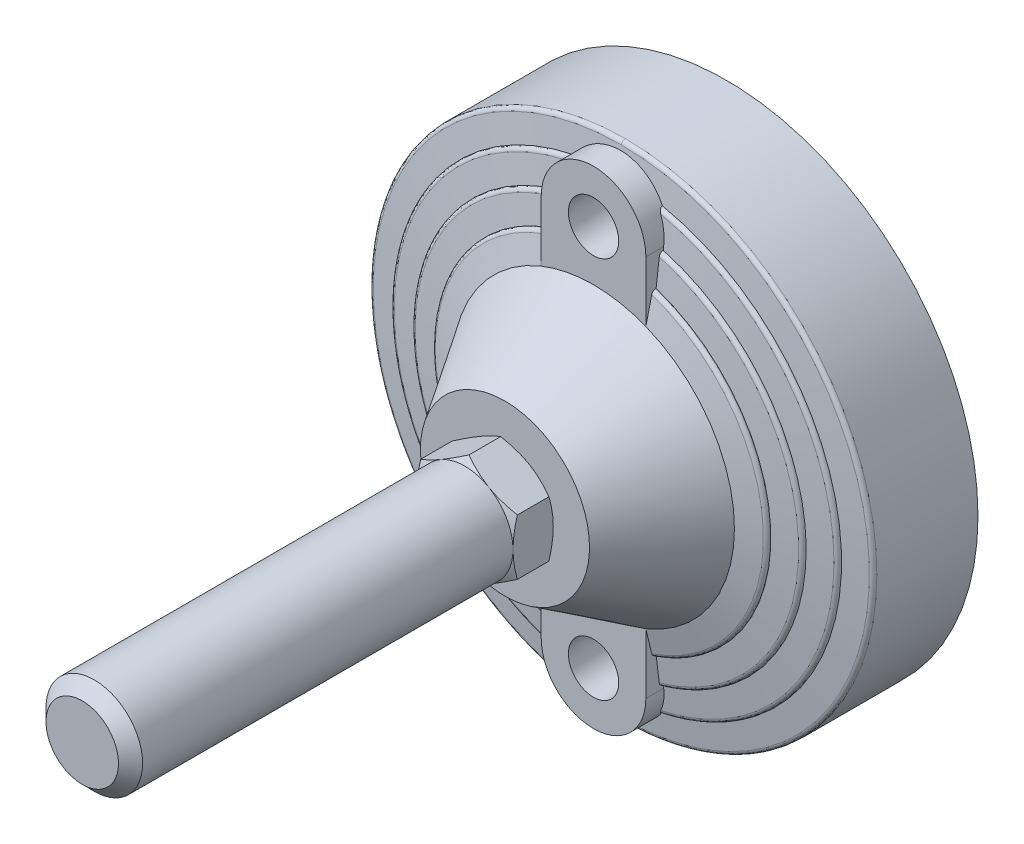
ISO-10303-21;
HEADER;
FILE_DESCRIPTION(('STEP AP214'),'2;1');
FILE_NAME('part.step','',(''),(''),'','','');
FILE_SCHEMA(('AUTOMOTIVE_DESIGN { 1 0 10303 214 1 1 1 1 }'));
ENDSEC;
DATA;
#1=APPLICATION_CONTEXT('core data for automotive mechanical design processes');
#2=APPLICATION_PROTOCOL_DEFINITION('international standard','automotive_design',2000,#1);
#3=PRODUCT_CONTEXT('',#1,'mechanical');
#4=PRODUCT('Part','Part','',(#3));
#5=PRODUCT_RELATED_PRODUCT_CATEGORY('part','',(#4));
#6=PRODUCT_DEFINITION_FORMATION('','',#4);
#7=PRODUCT_DEFINITION_CONTEXT('part definition',#1,'design');
#8=PRODUCT_DEFINITION('design','',#6,#7);
#9=PRODUCT_DEFINITION_SHAPE('','',#8);
#10=(LENGTH_UNIT() NAMED_UNIT(*) SI_UNIT(.MILLI.,.METRE.));
#11=(NAMED_UNIT(*) PLANE_ANGLE_UNIT() SI_UNIT($,.RADIAN.));
#12=(NAMED_UNIT(*) SI_UNIT($,.STERADIAN.) SOLID_ANGLE_UNIT());
#13=UNCERTAINTY_MEASURE_WITH_UNIT(LENGTH_MEASURE(1.E-05),#10,'distance_accuracy_value','');
#14=(GEOMETRIC_REPRESENTATION_CONTEXT(3) GLOBAL_UNCERTAINTY_ASSIGNED_CONTEXT((#13)) GLOBAL_UNIT_ASSIGNED_CONTEXT((#10,
#11,#12)) REPRESENTATION_CONTEXT('',''));
#15=CARTESIAN_POINT('',(0.,0.,0.));
#16=DIRECTION('',(0.,0.,1.));
#17=DIRECTION('',(1.,0.,0.));
#18=AXIS2_PLACEMENT_3D('',#15,#16,#17);
#19=CARTESIAN_POINT('',(-6.34676413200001,-41.175,10.));
#20=DIRECTION('',(0.,0.,1.));
#21=DIRECTION('',(0.,-1.,0.));
#22=AXIS2_PLACEMENT_3D('',#19,#20,#21);
#23=PLANE('',#22);
#24=CARTESIAN_POINT('',(0.,-47.5,10.));
#25=DIRECTION('',(0.,0.,1.));
#26=DIRECTION('',(-1.,0.,0.));
#27=AXIS2_PLACEMENT_3D('',#24,#25,#26);
#28=CIRCLE('',#27,6.25);
#29=CARTESIAN_POINT('',(-6.25000000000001,-47.5,9.99999999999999));
#30=VERTEX_POINT('',#29);
#31=EDGE_CURVE('E620',#30,#30,#28,.T.);
#32=ORIENTED_EDGE('',*,*,#31,.T.);
#33=EDGE_LOOP('',(#32));
#34=FACE_BOUND('',#33,.T.);
#35=ADVANCED_FACE('F14',(#34),#23,.T.);
#36=CARTESIAN_POINT('',(-63.467641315,63.25,0.));
#37=DIRECTION('',(0.,0.,1.));
#38=DIRECTION('',(0.,-1.,0.));
#39=AXIS2_PLACEMENT_3D('',#36,#37,#38);
#40=PLANE('',#39);
#41=CARTESIAN_POINT('',(0.,0.,0.));
#42=DIRECTION('',(0.,0.,-1.));
#43=DIRECTION('',(1.,0.,0.));
#44=AXIS2_PLACEMENT_3D('',#41,#42,#43);
#45=CIRCLE('',#44,62.5);
#46=CARTESIAN_POINT('',(62.5,0.,0.));
#47=VERTEX_POINT('',#46);
#48=EDGE_CURVE('E606',#47,#47,#45,.F.);
#49=ORIENTED_EDGE('',*,*,#48,.F.);
#50=EDGE_LOOP('',(#49));
#51=FACE_BOUND('',#50,.T.);
#52=ADVANCED_FACE('F1392',(#51),#40,.F.);
#53=CARTESIAN_POINT('',(0.,-47.5,10.));
#54=DIRECTION('',(0.,0.,1.));
#55=DIRECTION('',(-1.,0.,0.));
#56=AXIS2_PLACEMENT_3D('',#53,#54,#55);
#57=CYLINDRICAL_SURFACE('',#56,6.25);
#58=ORIENTED_EDGE('',*,*,#31,.F.);
#59=EDGE_LOOP('',(#58));
#60=FACE_BOUND('',#59,.T.);
#61=CARTESIAN_POINT('',(0.,-47.5,33.));
#62=DIRECTION('',(0.,0.,1.));
#63=DIRECTION('',(-1.,0.,0.));
#64=AXIS2_PLACEMENT_3D('',#61,#62,#63);
#65=CIRCLE('',#64,6.25);
#66=CARTESIAN_POINT('',(-6.25000000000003,-47.5,33.));
#67=VERTEX_POINT('',#66);
#68=EDGE_CURVE('E723',#67,#67,#65,.T.);
#69=ORIENTED_EDGE('',*,*,#68,.T.);
#70=EDGE_LOOP('',(#69));
#71=FACE_BOUND('',#70,.T.);
#72=ADVANCED_FACE('F1004',(#60,#71),#57,.F.);
#73=CARTESIAN_POINT('',(-21.325127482,-21.252,55.));
#74=DIRECTION('',(0.,0.,-1.));
#75=DIRECTION('',(0.,1.,0.));
#76=AXIS2_PLACEMENT_3D('',#73,#74,#75);
#77=PLANE('',#76);
#78=CARTESIAN_POINT('',(0.,0.,55.));
#79=DIRECTION('',(0.,0.,-1.));
#80=DIRECTION('',(0.,1.,0.));
#81=AXIS2_PLACEMENT_3D('',#78,#79,#80);
#82=CIRCLE('',#81,12.);
#83=CARTESIAN_POINT('',(12.,0.,55.));
#84=VERTEX_POINT('',#83);
#85=CARTESIAN_POINT('',(6.00000000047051,-10.3923048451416,55.));
#86=VERTEX_POINT('',#85);
#87=EDGE_CURVE('E251',#84,#86,#82,.T.);
#88=ORIENTED_EDGE('',*,*,#87,.T.);
#89=CARTESIAN_POINT('',(-6.00000000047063,-10.3923048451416,55.));
#90=VERTEX_POINT('',#89);
#91=EDGE_CURVE('E33',#86,#90,#82,.T.);
#92=ORIENTED_EDGE('',*,*,#91,.T.);
#93=CARTESIAN_POINT('',(-12.,0.,55.));
#94=VERTEX_POINT('',#93);
#95=EDGE_CURVE('E381',#90,#94,#82,.T.);
#96=ORIENTED_EDGE('',*,*,#95,.T.);
#97=CARTESIAN_POINT('',(-6.00000000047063,10.3923048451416,55.));
#98=VERTEX_POINT('',#97);
#99=EDGE_CURVE('E268',#94,#98,#82,.T.);
#100=ORIENTED_EDGE('',*,*,#99,.T.);
#101=CARTESIAN_POINT('',(6.00000000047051,10.3923048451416,55.));
#102=VERTEX_POINT('',#101);
#103=EDGE_CURVE('E253',#98,#102,#82,.T.);
#104=ORIENTED_EDGE('',*,*,#103,.T.);
#105=EDGE_CURVE('E239',#102,#84,#82,.T.);
#106=ORIENTED_EDGE('',*,*,#105,.T.);
#107=EDGE_LOOP('',(#88,#92,#96,#100,#104,#106));
#108=FACE_BOUND('',#107,.T.);
#109=CARTESIAN_POINT('',(0.,0.,55.));
#110=DIRECTION('',(0.,0.,-1.));
#111=DIRECTION('',(0.,1.,0.));
#112=AXIS2_PLACEMENT_3D('',#109,#110,#111);
#113=CIRCLE('',#112,21.);
#114=CARTESIAN_POINT('',(0.,21.,55.));
#115=VERTEX_POINT('',#114);
#116=EDGE_CURVE('E722',#115,#115,#113,.T.);
#117=ORIENTED_EDGE('',*,*,#116,.F.);
#118=EDGE_LOOP('',(#117));
#119=FACE_BOUND('',#118,.T.);
#120=ADVANCED_FACE('F265',(#108,#119),#77,.F.);
#121=CARTESIAN_POINT('',(-6.34676413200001,53.825,10.));
#122=DIRECTION('',(0.,0.,1.));
#123=DIRECTION('',(0.,-1.,0.));
#124=AXIS2_PLACEMENT_3D('',#121,#122,#123);
#125=PLANE('',#124);
#126=CARTESIAN_POINT('',(0.,47.5,10.));
#127=DIRECTION('',(0.,0.,1.));
#128=DIRECTION('',(-1.,0.,0.));
#129=AXIS2_PLACEMENT_3D('',#126,#127,#128);
#130=CIRCLE('',#129,6.25);
#131=CARTESIAN_POINT('',(-6.25000000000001,47.5,9.99999999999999));
#132=VERTEX_POINT('',#131);
#133=EDGE_CURVE('E982',#132,#132,#130,.T.);
#134=ORIENTED_EDGE('',*,*,#133,.T.);
#135=EDGE_LOOP('',(#134));
#136=FACE_BOUND('',#135,.T.);
#137=ADVANCED_FACE('F574',(#136),#125,.T.);
#138=CARTESIAN_POINT('',(0.,0.,33.));
#139=DIRECTION('',(0.,0.,-1.));
#140=DIRECTION('',(0.,1.,0.));
#141=AXIS2_PLACEMENT_3D('',#138,#139,#140);
#142=CONICAL_SURFACE('',#141,35.,1.32154418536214);
#143=CARTESIAN_POINT('',(0.,0.,33.));
#144=DIRECTION('',(0.,0.,-1.));
#145=DIRECTION('',(0.,1.,0.));
#146=AXIS2_PLACEMENT_3D('',#143,#144,#145);
#147=CIRCLE('',#146,35.);
#148=CARTESIAN_POINT('',(12.9999999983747,-32.4961536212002,32.9999999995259));
#149=VERTEX_POINT('',#148);
#150=CARTESIAN_POINT('',(13.0000000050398,32.4961536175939,32.999999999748));
#151=VERTEX_POINT('',#150);
#152=EDGE_CURVE('E719',#149,#151,#147,.F.);
#153=ORIENTED_EDGE('',*,*,#152,.F.);
#154=CARTESIAN_POINT('',(13.0000000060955,-38.6172483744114,31.5372089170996));
#155=CARTESIAN_POINT('',(13.0000000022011,-38.1074186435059,31.6602002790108));
#156=CARTESIAN_POINT('',(13.0000000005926,-37.5975329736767,31.7829600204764));
#157=CARTESIAN_POINT('',(12.9999999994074,-36.5776365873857,32.0279559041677));
#158=CARTESIAN_POINT('',(12.9999999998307,-36.0676258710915,32.1501920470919));
#159=CARTESIAN_POINT('',(13.0000000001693,-35.0474647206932,32.3940807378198));
#160=CARTESIAN_POINT('',(13.0000000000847,-34.5373142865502,32.5157332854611));
#161=CARTESIAN_POINT('',(12.9999999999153,-33.5168560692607,32.7583795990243));
#162=CARTESIAN_POINT('',(12.9999999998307,-33.0065482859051,32.8793733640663));
#163=CARTESIAN_POINT('',(13.,-32.496153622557,32.9999999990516));
#164=B_SPLINE_CURVE_WITH_KNOTS('',3,(#154,#155,#156,#157,#158,#159,#160,#161,#162,#163),
.UNSPECIFIED.,.F.,.F.,(4,2,2,2,4),(0.,1.57336555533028,3.14672901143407,4.72009290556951,
6.2934589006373),.UNSPECIFIED.);
#165=CARTESIAN_POINT('',(13.,-38.6172483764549,31.5372089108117));
#166=VERTEX_POINT('',#165);
#167=EDGE_CURVE('E559',#166,#149,#164,.T.);
#168=ORIENTED_EDGE('',*,*,#167,.F.);
#169=CARTESIAN_POINT('',(0.,0.,31.53720891));
#170=DIRECTION('',(0.,0.,-1.));
#171=DIRECTION('',(0.,1.,0.));
#172=AXIS2_PLACEMENT_3D('',#169,#170,#171);
#173=CIRCLE('',#172,40.746679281);
#174=CARTESIAN_POINT('',(13.,38.6172483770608,31.5372089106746));
#175=VERTEX_POINT('',#174);
#176=EDGE_CURVE('E616',#175,#166,#173,.T.);
#177=ORIENTED_EDGE('',*,*,#176,.F.);
#178=CARTESIAN_POINT('',(13.,32.4961536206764,32.999999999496));
#179=CARTESIAN_POINT('',(13.,33.0065482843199,32.8793733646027));
#180=CARTESIAN_POINT('',(13.,33.5168560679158,32.7583795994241));
#181=CARTESIAN_POINT('',(13.,34.5373142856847,32.515733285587));
#182=CARTESIAN_POINT('',(13.,35.0474647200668,32.3940807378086));
#183=CARTESIAN_POINT('',(13.,36.0676258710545,32.1501920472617));
#184=CARTESIAN_POINT('',(13.,36.577636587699,32.0279559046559));
#185=CARTESIAN_POINT('',(13.,37.597532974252,31.7829600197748));
#186=CARTESIAN_POINT('',(13.,38.1074186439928,31.6602002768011));
#187=CARTESIAN_POINT('',(13.,38.6172483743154,31.5372089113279));
#188=B_SPLINE_CURVE_WITH_KNOTS('',3,(#178,#179,#180,#181,#182,#183,#184,#185,#186,#187),
.UNSPECIFIED.,.F.,.F.,(4,2,2,2,4),(0.,1.57336599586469,3.1467298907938,4.72009334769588,
6.29345890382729),.UNSPECIFIED.);
#189=EDGE_CURVE('E985',#151,#175,#188,.T.);
#190=ORIENTED_EDGE('',*,*,#189,.F.);
#191=EDGE_LOOP('',(#153,#168,#177,#190));
#192=FACE_BOUND('',#191,.T.);
#193=ADVANCED_FACE('F999',(#192),#142,.T.);
#194=CARTESIAN_POINT('',(12.406354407,39.602176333,30.568111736));
#195=CARTESIAN_POINT('',(59.707464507,24.78394183,30.5681117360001));
#196=CARTESIAN_POINT('',(59.707464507,-24.78394183,30.5681117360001));
#197=CARTESIAN_POINT('',(12.406354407,-39.602176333,30.568111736));
#198=CARTESIAN_POINT('',(12.406354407,39.602176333,31.044046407));
#199=CARTESIAN_POINT('',(59.7074645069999,24.78394183,31.044046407));
#200=CARTESIAN_POINT('',(59.7074645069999,-24.78394183,31.044046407));
#201=CARTESIAN_POINT('',(12.406354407,-39.602176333,31.044046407));
#202=CARTESIAN_POINT('',(12.31903347,39.323440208,31.419805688));
#203=CARTESIAN_POINT('',(59.287219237,24.609502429,31.419805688));
#204=CARTESIAN_POINT('',(59.287219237,-24.609502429,31.419805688));
#205=CARTESIAN_POINT('',(12.31903347,-39.323440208,31.419805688));
#206=CARTESIAN_POINT('',(12.18115046,38.883305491,31.53720891));
#207=CARTESIAN_POINT('',(58.623636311,24.334056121,31.5372089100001));
#208=CARTESIAN_POINT('',(58.623636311,-24.334056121,31.5372089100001));
#209=CARTESIAN_POINT('',(12.18115046,-38.883305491,31.53720891));
#210=(BOUNDED_SURFACE() B_SPLINE_SURFACE(3,3,((#194,#195,#196,#197),(#198,#199,#200,#201),(#202,
#203,#204,#205),(#206,#207,#208,#209)),.UNSPECIFIED.,.F.,.F.,
.F.) B_SPLINE_SURFACE_WITH_KNOTS((4,4),(4,4),(0.,1.),(0.,1.),
.UNSPECIFIED.) GEOMETRIC_REPRESENTATION_ITEM() RATIONAL_B_SPLINE_SURFACE(((1.,0.532632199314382,
0.532632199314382,1.),(0.859679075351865,0.457892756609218,0.457892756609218,0.859679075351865),
(0.859679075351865,0.457892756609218,0.457892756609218,0.859679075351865),(1.,0.532632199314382,
0.532632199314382,1.))) REPRESENTATION_ITEM('') SURFACE());
#211=CARTESIAN_POINT('',(13.,-39.4112927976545,30.5681117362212));
#212=CARTESIAN_POINT('',(13.,-39.411293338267,30.5952104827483));
#213=CARTESIAN_POINT('',(13.,-39.4101321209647,30.6222958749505));
#214=CARTESIAN_POINT('',(13.,-39.405504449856,30.6762650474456));
#215=CARTESIAN_POINT('',(13.,-39.4020383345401,30.7031488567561));
#216=CARTESIAN_POINT('',(13.,-39.3882336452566,30.7831079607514));
#217=CARTESIAN_POINT('',(13.,-39.3744885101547,30.8356344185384));
#218=CARTESIAN_POINT('',(13.,-39.3384084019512,30.9376087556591));
#219=CARTESIAN_POINT('',(13.,-39.3160736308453,30.9870567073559));
#220=CARTESIAN_POINT('',(13.,-39.2635909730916,31.081601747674));
#221=CARTESIAN_POINT('',(13.,-39.233444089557,31.1266993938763));
#222=CARTESIAN_POINT('',(13.,-39.165605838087,31.2123360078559));
#223=CARTESIAN_POINT('',(13.,-39.1277714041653,31.2527614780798));
#224=CARTESIAN_POINT('',(13.,-39.0461074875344,31.3270714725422));
#225=CARTESIAN_POINT('',(13.,-39.0022718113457,31.360949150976));
#226=CARTESIAN_POINT('',(13.,-38.9043172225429,31.425052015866));
#227=CARTESIAN_POINT('',(13.,-38.8495953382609,31.4543647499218));
#228=CARTESIAN_POINT('',(13.,-38.7644641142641,31.4909906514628));
#229=CARTESIAN_POINT('',(13.,-38.7355751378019,31.5019763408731));
#230=CARTESIAN_POINT('',(13.,-38.6769796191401,31.5214626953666));
#231=CARTESIAN_POINT('',(13.,-38.6472733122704,31.5299640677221));
#232=CARTESIAN_POINT('',(13.,-38.6172483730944,31.5372089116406));
#233=B_SPLINE_CURVE_WITH_KNOTS('',3,(#211,#212,#213,#214,#215,#216,#217,#218,#219,#220,#221,
#222,#223,#224,#225,#226,#227,#228,#229,#230,#231,#232),.UNSPECIFIED.,.F.,.F.,(4,2,2,2,2,2,2,2,
2,2,4),(0.,0.081245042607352,0.162478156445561,0.324519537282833,0.486557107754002,
0.648573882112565,0.813939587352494,0.979477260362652,1.16468654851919,1.25731455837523,
1.34991617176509),.UNSPECIFIED.);
#234=CARTESIAN_POINT('',(13.,-39.4112928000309,30.5681117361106));
#235=VERTEX_POINT('',#234);
#236=EDGE_CURVE('E586',#235,#166,#233,.T.);
#237=CARTESIAN_POINT('',(0.,0.,30.568111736));
#238=DIRECTION('',(0.,0.,-1.));
#239=DIRECTION('',(0.,1.,0.));
#240=AXIS2_PLACEMENT_3D('',#237,#238,#239);
#241=CIRCLE('',#240,41.5);
#242=CARTESIAN_POINT('',(13.,39.4112928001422,30.5681117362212));
#243=VERTEX_POINT('',#242);
#244=EDGE_CURVE('E619',#243,#235,#241,.T.);
#245=CARTESIAN_POINT('',(13.,38.6172483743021,31.5372089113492));
#246=CARTESIAN_POINT('',(13.,38.6757273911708,31.5231434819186));
#247=CARTESIAN_POINT('',(13.,38.7330575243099,31.5042077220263));
#248=CARTESIAN_POINT('',(13.,38.8438981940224,31.4570874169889));
#249=CARTESIAN_POINT('',(13.,38.8974017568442,31.4288864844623));
#250=CARTESIAN_POINT('',(13.,38.9989209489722,31.363734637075));
#251=CARTESIAN_POINT('',(13.,39.0469285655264,31.3267711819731));
#252=CARTESIAN_POINT('',(13.,39.135707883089,31.2450475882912));
#253=CARTESIAN_POINT('',(13.,39.1764870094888,31.2002955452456));
#254=CARTESIAN_POINT('',(13.,39.247988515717,31.1059931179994));
#255=CARTESIAN_POINT('',(13.,39.2790300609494,31.0566848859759));
#256=CARTESIAN_POINT('',(13.,39.3318958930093,30.9533393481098));
#257=CARTESIAN_POINT('',(13.,39.3537228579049,30.899303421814));
#258=CARTESIAN_POINT('',(13.,39.3839717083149,30.7991363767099));
#259=CARTESIAN_POINT('',(13.,39.3941848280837,30.7535382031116));
#260=CARTESIAN_POINT('',(13.,39.4078594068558,30.6613400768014));
#261=CARTESIAN_POINT('',(13.,39.4113205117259,30.6147400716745));
#262=CARTESIAN_POINT('',(13.,39.4112927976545,30.5681117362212));
#263=B_SPLINE_CURVE_WITH_KNOTS('',3,(#245,#246,#247,#248,#249,#250,#251,#252,#253,#254,#255,
#256,#257,#258,#259,#260,#261,#262),.UNSPECIFIED.,.F.,.F.,(4,2,2,2,2,2,2,2,4),(0.,
0.180276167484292,0.36087292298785,0.541729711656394,0.722399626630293,0.896310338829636,
1.07017047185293,1.20986981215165,1.34957647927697),.UNSPECIFIED.);
#264=EDGE_CURVE('E758',#175,#243,#263,.T.);
#265=ORIENTED_EDGE('',*,*,#176,.T.);
#266=ORIENTED_EDGE('',*,*,#236,.F.);
#267=ORIENTED_EDGE('',*,*,#244,.F.);
#268=ORIENTED_EDGE('',*,*,#264,.F.);
#269=EDGE_LOOP('',(#265,#266,#267,#268));
#270=FACE_BOUND('',#269,.T.);
#271=ADVANCED_FACE('F749',(#270),#210,.T.);
#272=CARTESIAN_POINT('',(0.,0.,30.568111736));
#273=DIRECTION('',(0.,0.,-1.));
#274=DIRECTION('',(0.,1.,0.));
#275=AXIS2_PLACEMENT_3D('',#272,#273,#274);
#276=CYLINDRICAL_SURFACE('',#275,41.5);
#277=CARTESIAN_POINT('',(0.,0.,30.4545454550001));
#278=DIRECTION('',(0.,0.,-1.));
#279=DIRECTION('',(0.,1.,0.));
#280=AXIS2_PLACEMENT_3D('',#277,#278,#279);
#281=CIRCLE('',#280,41.5);
#282=CARTESIAN_POINT('',(13.,39.4112928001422,30.4545454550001));
#283=VERTEX_POINT('',#282);
#284=CARTESIAN_POINT('',(13.,-39.4112928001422,30.4545454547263));
#285=VERTEX_POINT('',#284);
#286=EDGE_CURVE('E735',#283,#285,#281,.T.);
#287=ORIENTED_EDGE('',*,*,#286,.F.);
#288=DIRECTION('',(0.,0.,-1.));
#289=VECTOR('',#288,1.);
#290=CARTESIAN_POINT('',(13.,39.4112928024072,30.7755712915));
#291=LINE('',#290,#289);
#292=EDGE_CURVE('E745',#243,#283,#291,.T.);
#293=ORIENTED_EDGE('',*,*,#292,.F.);
#294=ORIENTED_EDGE('',*,*,#244,.T.);
#295=DIRECTION('',(0.,0.,1.));
#296=VECTOR('',#295,1.);
#297=CARTESIAN_POINT('',(13.,-39.4112928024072,30.7755712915));
#298=LINE('',#297,#296);
#299=EDGE_CURVE('E599',#285,#235,#298,.T.);
#300=ORIENTED_EDGE('',*,*,#299,.F.);
#301=EDGE_LOOP('',(#287,#293,#294,#300));
#302=FACE_BOUND('',#301,.T.);
#303=ADVANCED_FACE('F743',(#302),#276,.T.);
#304=CARTESIAN_POINT('',(0.,0.,30.454545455));
#305=DIRECTION('',(0.,0.,-1.));
#306=DIRECTION('',(0.,1.,0.));
#307=AXIS2_PLACEMENT_3D('',#304,#305,#306);
#308=CONICAL_SURFACE('',#307,41.5,1.4442041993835);
#309=ORIENTED_EDGE('',*,*,#286,.T.);
#310=CARTESIAN_POINT('',(13.0000000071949,-45.8176832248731,29.6748403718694));
#311=CARTESIAN_POINT('',(13.0000000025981,-45.2838642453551,29.7402005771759));
#312=CARTESIAN_POINT('',(13.0000000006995,-44.7500350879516,29.8054777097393));
#313=CARTESIAN_POINT('',(12.9999999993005,-43.6823542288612,29.9358466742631));
#314=CARTESIAN_POINT('',(12.9999999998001,-43.1485025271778,30.0009385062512));
#315=CARTESIAN_POINT('',(13.0000000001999,-42.0807742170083,30.1309177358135));
#316=CARTESIAN_POINT('',(13.0000000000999,-41.5468976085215,30.1958051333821));
#317=CARTESIAN_POINT('',(12.9999999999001,-40.4791166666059,30.3253520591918));
#318=CARTESIAN_POINT('',(12.9999999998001,-39.9452123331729,30.390011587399));
#319=CARTESIAN_POINT('',(13.,-39.4112928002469,30.4545454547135));
#320=B_SPLINE_CURVE_WITH_KNOTS('',3,(#310,#311,#312,#313,#314,#315,#316,#317,#318,#319),
.UNSPECIFIED.,.F.,.F.,(4,2,2,2,4),(0.,1.613416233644,3.22683222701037,4.84024826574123,
6.45366454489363),.UNSPECIFIED.);
#321=CARTESIAN_POINT('',(13.,-45.8176832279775,29.6748403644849));
#322=VERTEX_POINT('',#321);
#323=EDGE_CURVE('E593',#322,#285,#320,.T.);
#324=ORIENTED_EDGE('',*,*,#323,.F.);
#325=CARTESIAN_POINT('',(-7.48592651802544E-10,0.,29.674840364));
#326=DIRECTION('',(0.,0.,-1.));
#327=DIRECTION('',(1.,0.,0.));
#328=AXIS2_PLACEMENT_3D('',#325,#326,#327);
#329=CIRCLE('',#328,47.6262542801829);
#330=CARTESIAN_POINT('',(13.,45.8176832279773,29.6748403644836));
#331=VERTEX_POINT('',#330);
#332=EDGE_CURVE('E613',#331,#322,#329,.T.);
#333=ORIENTED_EDGE('',*,*,#332,.F.);
#334=CARTESIAN_POINT('',(12.9999999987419,39.4112928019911,30.4545454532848));
#335=CARTESIAN_POINT('',(12.9999999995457,39.9452123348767,30.3900115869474));
#336=CARTESIAN_POINT('',(12.9999999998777,40.4791166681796,30.3253520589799));
#337=CARTESIAN_POINT('',(13.0000000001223,41.5468976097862,30.1958051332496));
#338=CARTESIAN_POINT('',(13.0000000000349,42.080774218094,30.1309177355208));
#339=CARTESIAN_POINT('',(12.9999999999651,43.1485025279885,30.000938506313));
#340=CARTESIAN_POINT('',(12.9999999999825,43.6823542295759,29.9358466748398));
#341=CARTESIAN_POINT('',(13.0000000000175,44.7500350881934,29.8054777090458));
#342=CARTESIAN_POINT('',(13.0000000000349,45.2838642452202,29.7402005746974));
#343=CARTESIAN_POINT('',(13.,45.817683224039,29.6748403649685));
#344=B_SPLINE_CURVE_WITH_KNOTS('',3,(#334,#335,#336,#337,#338,#339,#340,#341,#342,#343),
.UNSPECIFIED.,.F.,.F.,(4,2,2,2,4),(0.,1.61341627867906,3.226832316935,4.84024830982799,
6.45366454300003),.UNSPECIFIED.);
#345=EDGE_CURVE('E757',#283,#331,#344,.T.);
#346=ORIENTED_EDGE('',*,*,#345,.F.);
#347=EDGE_LOOP('',(#309,#324,#333,#346));
#348=FACE_BOUND('',#347,.T.);
#349=ADVANCED_FACE('F526',(#348),#308,.T.);
#350=CARTESIAN_POINT('',(12.269850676,46.922284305,28.6696231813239));
#351=CARTESIAN_POINT('',(72.5576318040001,31.157449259,28.669623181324));
#352=CARTESIAN_POINT('',(72.5576318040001,-31.157449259,28.669623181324));
#353=CARTESIAN_POINT('',(12.269850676,-46.922284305,28.6696231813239));
#354=CARTESIAN_POINT('',(12.269850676,46.922284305,28.6740296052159));
#355=CARTESIAN_POINT('',(72.5576318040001,31.157449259,28.6740296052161));
#356=CARTESIAN_POINT('',(72.5576318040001,-31.157449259,28.6740296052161));
#357=CARTESIAN_POINT('',(12.269850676,-46.922284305,28.6740296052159));
#358=CARTESIAN_POINT('',(12.269850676,46.922284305,28.678436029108));
#359=CARTESIAN_POINT('',(72.5576318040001,31.157449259,28.6784360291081));
#360=CARTESIAN_POINT('',(72.5576318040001,-31.157449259,28.6784360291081));
#361=CARTESIAN_POINT('',(12.269850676,-46.922284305,28.678436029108));
#362=CARTESIAN_POINT('',(12.269850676,46.922284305,28.682842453));
#363=CARTESIAN_POINT('',(72.5576318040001,31.157449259,28.6828424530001));
#364=CARTESIAN_POINT('',(72.5576318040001,-31.157449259,28.6828424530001));
#365=CARTESIAN_POINT('',(12.269850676,-46.922284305,28.682842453));
#366=CARTESIAN_POINT('',(12.269850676,46.922284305,29.211436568));
#367=CARTESIAN_POINT('',(72.557631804,31.157449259,29.2114365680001));
#368=CARTESIAN_POINT('',(72.557631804,-31.157449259,29.2114365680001));
#369=CARTESIAN_POINT('',(12.269850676,-46.922284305,29.211436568));
#370=CARTESIAN_POINT('',(12.181461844,46.584268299,29.608103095));
#371=CARTESIAN_POINT('',(72.034945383,30.93299905,29.6081030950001));
#372=CARTESIAN_POINT('',(72.034945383,-30.93299905,29.6081030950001));
#373=CARTESIAN_POINT('',(12.181461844,-46.584268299,29.608103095));
#374=CARTESIAN_POINT('',(12.048804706,46.076961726,29.674840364));
#375=CARTESIAN_POINT('',(71.250478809,30.596136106,29.6748403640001));
#376=CARTESIAN_POINT('',(71.250478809,-30.596136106,29.6748403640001));
#377=CARTESIAN_POINT('',(12.048804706,-46.076961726,29.674840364));
#378=(BOUNDED_SURFACE() B_SPLINE_SURFACE(3,3,((#350,#351,#352,#353),(#354,#355,#356,#357),(#358,
#359,#360,#361),(#362,#363,#364,#365),(#366,#367,#368,#369),(#370,#371,#372,#373),(#374,#375,
#376,#377)),.UNSPECIFIED.,.F.,.F.,.F.) B_SPLINE_SURFACE_WITH_KNOTS((4,3,4),(4,4),(-0.01,0.,1.),
(0.,1.),.UNSPECIFIED.) GEOMETRIC_REPRESENTATION_ITEM() RATIONAL_B_SPLINE_SURFACE(((1.,
0.501991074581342,0.501991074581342,1.),(1.,0.501991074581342,0.501991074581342,1.),(1.,
0.501991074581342,0.501991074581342,1.),(1.,0.501991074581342,0.501991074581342,1.),
(0.833611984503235,0.418465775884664,0.418465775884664,0.833611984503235),(0.833611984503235,
0.418465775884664,0.418465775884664,0.833611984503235),(1.,0.501991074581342,0.501991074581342,1.))) REPRESENTATION_ITEM('') SURFACE());
#379=CARTESIAN_POINT('',(13.,-46.7252608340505,28.6777848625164));
#380=CARTESIAN_POINT('',(13.,-46.7253979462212,28.7054287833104));
#381=CARTESIAN_POINT('',(13.,-46.7243484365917,28.7330653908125));
#382=CARTESIAN_POINT('',(13.,-46.719887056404,28.7881439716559));
#383=CARTESIAN_POINT('',(13.,-46.716475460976,28.8155859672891));
#384=CARTESIAN_POINT('',(13.,-46.7027375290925,28.8972169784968));
#385=CARTESIAN_POINT('',(13.,-46.6889086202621,28.9508576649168));
#386=CARTESIAN_POINT('',(13.,-46.6523707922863,29.0550506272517));
#387=CARTESIAN_POINT('',(13.,-46.6296523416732,29.1055995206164));
#388=CARTESIAN_POINT('',(13.,-46.5760978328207,29.2021956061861));
#389=CARTESIAN_POINT('',(13.,-46.5452617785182,29.2482428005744));
#390=CARTESIAN_POINT('',(13.,-46.4762858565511,29.3348542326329));
#391=CARTESIAN_POINT('',(13.,-46.4381108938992,29.3753904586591));
#392=CARTESIAN_POINT('',(13.,-46.3556866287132,29.449757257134));
#393=CARTESIAN_POINT('',(13.,-46.3114344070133,29.4835845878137));
#394=CARTESIAN_POINT('',(13.,-46.2164675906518,29.5448274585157));
#395=CARTESIAN_POINT('',(13.,-46.1655796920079,29.5719736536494));
#396=CARTESIAN_POINT('',(13.,-46.0601083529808,29.6176355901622));
#397=CARTESIAN_POINT('',(13.,-46.0055288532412,29.636160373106));
#398=CARTESIAN_POINT('',(13.,-45.9281089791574,29.6556819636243));
#399=CARTESIAN_POINT('',(13.,-45.9061721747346,29.6604842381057));
#400=CARTESIAN_POINT('',(13.,-45.8620822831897,29.6686997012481));
#401=CARTESIAN_POINT('',(13.,-45.8399296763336,29.672115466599));
#402=CARTESIAN_POINT('',(13.,-45.8176832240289,29.674840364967));
#403=B_SPLINE_CURVE_WITH_KNOTS('',3,(#379,#380,#381,#382,#383,#384,#385,#386,#387,#388,#389,
#390,#391,#392,#393,#394,#395,#396,#397,#398,#399,#400,#401,#402),.UNSPECIFIED.,.F.,.F.,(4,2,2,
2,2,2,2,2,2,2,2,4),(0.,0.0828810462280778,0.165752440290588,0.331061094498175,0.496547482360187,
0.662033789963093,0.828332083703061,0.994710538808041,1.16697834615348,1.339065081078,
1.40639957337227,1.47360835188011),.UNSPECIFIED.);
#404=CARTESIAN_POINT('',(13.0000000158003,-46.7252608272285,28.6777848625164));
#405=VERTEX_POINT('',#404);
#406=EDGE_CURVE('E557',#405,#322,#403,.T.);
#407=CARTESIAN_POINT('',(13.0000000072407,46.725260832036,28.6727272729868));
#408=CARTESIAN_POINT('',(13.3212147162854,46.6358917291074,28.6727272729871));
#409=CARTESIAN_POINT('',(13.6414983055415,46.543212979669,28.6727272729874));
#410=CARTESIAN_POINT('',(14.2801231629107,46.3512597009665,28.6727272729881));
#411=CARTESIAN_POINT('',(14.5984642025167,46.2519844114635,28.6727272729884));
#412=CARTESIAN_POINT('',(15.552610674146,45.9435979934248,28.6727272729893));
#413=CARTESIAN_POINT('',(16.1852411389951,45.7245656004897,28.6727272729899));
#414=CARTESIAN_POINT('',(17.4409289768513,45.2604918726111,28.6727272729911));
#415=CARTESIAN_POINT('',(18.0639854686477,45.0154481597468,28.6727272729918));
#416=CARTESIAN_POINT('',(19.3000708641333,44.4995075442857,28.672727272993));
#417=CARTESIAN_POINT('',(19.9130888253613,44.2285843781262,28.6727272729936));
#418=CARTESIAN_POINT('',(21.1274202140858,43.661555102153,28.6727272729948));
#419=CARTESIAN_POINT('',(21.7287319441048,43.3654453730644,28.6727272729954));
#420=CARTESIAN_POINT('',(23.5288179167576,42.4321391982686,28.6727272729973));
#421=CARTESIAN_POINT('',(24.7079785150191,41.7565378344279,28.6727272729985));
#422=CARTESIAN_POINT('',(27.005751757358,40.3086198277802,28.6727272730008));
#423=CARTESIAN_POINT('',(28.1243409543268,39.5362661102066,28.672727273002));
#424=CARTESIAN_POINT('',(30.2940548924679,37.8994558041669,28.6727272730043));
#425=CARTESIAN_POINT('',(31.3451007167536,37.0348945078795,28.6727272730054));
#426=CARTESIAN_POINT('',(33.3707378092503,35.2206259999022,28.6727272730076));
#427=CARTESIAN_POINT('',(34.3453363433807,34.2709268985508,28.6727272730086));
#428=CARTESIAN_POINT('',(36.2141318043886,32.290033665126,28.6727272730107));
#429=CARTESIAN_POINT('',(37.1080775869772,31.2586025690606,28.6727272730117));
#430=CARTESIAN_POINT('',(38.8059105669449,29.1240638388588,28.6727272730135));
#431=CARTESIAN_POINT('',(39.6097954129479,28.0209543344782,28.6727272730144));
#432=CARTESIAN_POINT('',(41.1215543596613,25.7512426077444,28.6727272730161));
#433=CARTESIAN_POINT('',(41.8294551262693,24.5846581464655,28.6727272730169));
#434=CARTESIAN_POINT('',(43.144473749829,22.1960153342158,28.6727272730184));
#435=CARTESIAN_POINT('',(43.751592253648,20.973957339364,28.6727272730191));
#436=CARTESIAN_POINT('',(44.8608053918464,18.4828923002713,28.6727272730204));
#437=CARTESIAN_POINT('',(45.3628870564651,17.2138794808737,28.672727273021));
#438=CARTESIAN_POINT('',(46.258363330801,14.6380667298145,28.672727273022));
#439=CARTESIAN_POINT('',(46.6517577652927,13.3312667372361,28.6727272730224));
#440=CARTESIAN_POINT('',(47.327070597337,10.6891374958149,28.6727272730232));
#441=CARTESIAN_POINT('',(47.6089860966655,9.35380750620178,28.6727272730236));
#442=CARTESIAN_POINT('',(48.0593220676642,6.66414532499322,28.6727272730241));
#443=CARTESIAN_POINT('',(48.2277425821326,5.30981314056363,28.6727272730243));
#444=CARTESIAN_POINT('',(48.4498861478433,2.59183878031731,28.6727272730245));
#445=CARTESIAN_POINT('',(48.5036145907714,1.22819704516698,28.6727272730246));
#446=CARTESIAN_POINT('',(48.4960080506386,-1.49876561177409,28.6727272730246));
#447=CARTESIAN_POINT('',(48.4346730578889,-2.86208653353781,28.6727272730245));
#448=CARTESIAN_POINT('',(48.1973677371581,-5.57880747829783,28.6727272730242));
#449=CARTESIAN_POINT('',(48.0213896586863,-6.93220682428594,28.672727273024));
#450=CARTESIAN_POINT('',(47.5560413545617,-9.61936956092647,28.6727272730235));
#451=CARTESIAN_POINT('',(47.2666711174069,-10.9531329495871,28.6727272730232));
#452=CARTESIAN_POINT('',(46.5765756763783,-13.5916227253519,28.6727272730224));
#453=CARTESIAN_POINT('',(46.1758433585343,-14.8963472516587,28.6727272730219));
#454=CARTESIAN_POINT('',(45.2658742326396,-17.4674022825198,28.6727272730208));
#455=CARTESIAN_POINT('',(44.7566374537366,-18.7337327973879,28.6727272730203));
#456=CARTESIAN_POINT('',(43.6334165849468,-21.218718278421,28.672727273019));
#457=CARTESIAN_POINT('',(43.0194530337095,-22.4373825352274,28.6727272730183));
#458=CARTESIAN_POINT('',(41.6909757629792,-24.8187625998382,28.6727272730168));
#459=CARTESIAN_POINT('',(40.9764619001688,-25.9814783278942,28.672727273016));
#460=CARTESIAN_POINT('',(39.7063025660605,-27.8655028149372,28.6727272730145));
#461=CARTESIAN_POINT('',(39.1770724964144,-28.6047764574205,28.6727272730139));
#462=CARTESIAN_POINT('',(38.077880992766,-30.0524665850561,28.6727272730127));
#463=CARTESIAN_POINT('',(37.5079195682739,-30.7608830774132,28.6727272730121));
#464=CARTESIAN_POINT('',(36.3291070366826,-32.1445499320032,28.6727272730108));
#465=CARTESIAN_POINT('',(35.7202564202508,-32.8198007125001,28.6727272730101));
#466=CARTESIAN_POINT('',(34.4653645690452,-34.1352484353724,28.6727272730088));
#467=CARTESIAN_POINT('',(33.8193109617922,-34.7754335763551,28.6727272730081));
#468=CARTESIAN_POINT('',(32.4922294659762,-36.0184899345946,28.6727272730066));
#469=CARTESIAN_POINT('',(31.8112009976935,-36.6213605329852,28.6727272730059));
#470=CARTESIAN_POINT('',(30.4163089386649,-37.7878929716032,28.6727272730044));
#471=CARTESIAN_POINT('',(29.7024437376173,-38.3515528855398,28.6727272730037));
#472=CARTESIAN_POINT('',(28.1769516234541,-39.4879139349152,28.6727272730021));
#473=CARTESIAN_POINT('',(27.3623770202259,-40.0566641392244,28.6727272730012));
#474=CARTESIAN_POINT('',(25.6997855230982,-41.1431320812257,28.6727272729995));
#475=CARTESIAN_POINT('',(24.8517655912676,-41.6608451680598,28.6727272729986));
#476=CARTESIAN_POINT('',(23.1254909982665,-42.6432641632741,28.6727272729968));
#477=CARTESIAN_POINT('',(22.247234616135,-43.1079670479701,28.6727272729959));
#478=CARTESIAN_POINT('',(20.4623876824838,-43.9832963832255,28.6727272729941));
#479=CARTESIAN_POINT('',(19.5557530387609,-44.3938329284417,28.6727272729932));
#480=CARTESIAN_POINT('',(17.7189637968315,-45.1583612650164,28.6727272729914));
#481=CARTESIAN_POINT('',(16.7888095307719,-45.5123538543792,28.6727272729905));
#482=CARTESIAN_POINT('',(14.9085132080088,-46.1625049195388,28.6727272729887));
#483=CARTESIAN_POINT('',(13.9583713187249,-46.4586638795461,28.6727272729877));
#484=CARTESIAN_POINT('',(13.0000000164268,-46.7252608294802,28.6727272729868));
#485=B_SPLINE_CURVE_WITH_KNOTS('',3,(#407,#408,#409,#410,#411,#412,#413,#414,#415,#416,#417,
#418,#419,#420,#421,#422,#423,#424,#425,#426,#427,#428,#429,#430,#431,#432,#433,#434,#435,#436,
#437,#438,#439,#440,#441,#442,#443,#444,#445,#446,#447,#448,#449,#450,#451,#452,#453,#454,#455,
#456,#457,#458,#459,#460,#461,#462,#463,#464,#465,#466,#467,#468,#469,#470,#471,#472,#473,#474,
#475,#476,#477,#478,#479,#480,#481,#482,#483,#484),.UNSPECIFIED.,.F.,.F.,(4,2,2,2,2,2,2,2,2,2,2,
2,2,2,2,2,2,2,2,2,2,2,2,2,2,2,2,2,2,2,2,2,2,2,2,2,2,2,4),(0.,1.0002081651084,2.00053180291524,
4.00833027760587,6.01631246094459,8.02635452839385,10.0366859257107,14.1084282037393,
18.181735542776,22.2597186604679,26.3373137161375,30.4271967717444,34.5171865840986,
38.6060377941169,42.6948627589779,46.7841923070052,50.8735284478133,54.962970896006,
59.0524118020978,63.141660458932,67.2309094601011,71.3204349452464,75.4099608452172,
79.4997480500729,83.589534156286,87.6785191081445,91.7675098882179,94.4937471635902,
97.2199838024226,99.9461860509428,102.673300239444,105.400459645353,108.127752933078,
111.106299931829,114.08511810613,117.064106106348,120.047978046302,123.031807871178,
126.015612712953),.UNSPECIFIED.);
#486=CARTESIAN_POINT('',(13.0000000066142,46.7252608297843,28.6777848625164));
#487=VERTEX_POINT('',#486);
#488=EDGE_CURVE('E515',#487,#405,#485,.T.);
#489=CARTESIAN_POINT('',(13.,45.817683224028,29.6748403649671));
#490=CARTESIAN_POINT('',(13.,45.8768916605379,29.6676266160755));
#491=CARTESIAN_POINT('',(13.,45.9354849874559,29.6554311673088));
#492=CARTESIAN_POINT('',(13.,46.0498761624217,29.6214764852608));
#493=CARTESIAN_POINT('',(13.,46.105671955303,29.5997103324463));
#494=CARTESIAN_POINT('',(13.,46.2128716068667,29.5469963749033));
#495=CARTESIAN_POINT('',(13.,46.2642705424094,29.5160384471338));
#496=CARTESIAN_POINT('',(13.,46.3367247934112,29.4633763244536));
#497=CARTESIAN_POINT('',(13.,46.3600988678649,29.4447881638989));
#498=CARTESIAN_POINT('',(13.,46.4051654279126,29.4056252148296));
#499=CARTESIAN_POINT('',(13.,46.4268560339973,29.3850482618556));
#500=CARTESIAN_POINT('',(13.,46.4880645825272,29.3216088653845));
#501=CARTESIAN_POINT('',(13.,46.5249454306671,29.2761439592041));
#502=CARTESIAN_POINT('',(13.,46.5901806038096,29.1794685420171));
#503=CARTESIAN_POINT('',(13.,46.6185381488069,29.1282602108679));
#504=CARTESIAN_POINT('',(13.,46.6534889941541,29.0492930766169));
#505=CARTESIAN_POINT('',(13.,46.6637514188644,29.0231112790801));
#506=CARTESIAN_POINT('',(13.,46.681971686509,28.9699855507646));
#507=CARTESIAN_POINT('',(13.,46.6899313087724,28.943042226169));
#508=CARTESIAN_POINT('',(13.,46.7102220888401,28.8614024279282));
#509=CARTESIAN_POINT('',(13.,46.7190275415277,28.8057552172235));
#510=CARTESIAN_POINT('',(13.,46.7237631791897,28.7378782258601));
#511=CARTESIAN_POINT('',(13.,46.724374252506,28.7258595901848));
#512=CARTESIAN_POINT('',(13.,46.7251497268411,28.7018236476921));
#513=CARTESIAN_POINT('',(13.,46.725314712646,28.6898063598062));
#514=CARTESIAN_POINT('',(13.,46.7252608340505,28.6777848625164));
#515=B_SPLINE_CURVE_WITH_KNOTS('',3,(#489,#490,#491,#492,#493,#494,#495,#496,#497,#498,#499,
#500,#501,#502,#503,#504,#505,#506,#507,#508,#509,#510,#511,#512,#513,#514),.UNSPECIFIED.,.F.,
.F.,(4,2,2,2,2,2,2,2,2,2,2,2,4),(0.,0.178718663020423,0.357566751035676,0.536612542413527,
0.626107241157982,0.715700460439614,0.890396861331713,1.06502718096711,1.14929679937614,
1.23350112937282,1.40145320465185,1.43755286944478,1.47360518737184),.UNSPECIFIED.);
#516=EDGE_CURVE('E1429',#331,#487,#515,.T.);
#517=ORIENTED_EDGE('',*,*,#332,.T.);
#518=ORIENTED_EDGE('',*,*,#406,.F.);
#519=ORIENTED_EDGE('',*,*,#488,.F.);
#520=ORIENTED_EDGE('',*,*,#516,.F.);
#521=EDGE_LOOP('',(#517,#518,#519,#520));
#522=FACE_BOUND('',#521,.T.);
#523=ADVANCED_FACE('F518',(#522),#378,.T.);
#524=CARTESIAN_POINT('',(0.,62.5,25.119206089));
#525=CARTESIAN_POINT('',(125.,62.5,25.1192060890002));
#526=CARTESIAN_POINT('',(125.,-62.5,25.1192060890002));
#527=CARTESIAN_POINT('',(0.,-62.5,25.119206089));
#528=CARTESIAN_POINT('',(0.,62.5,25.647800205));
#529=CARTESIAN_POINT('',(125.,62.5,25.6478002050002));
#530=CARTESIAN_POINT('',(125.,-62.5,25.6478002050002));
#531=CARTESIAN_POINT('',(0.,-62.5,25.647800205));
#532=CARTESIAN_POINT('',(0.,62.150618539,26.044466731));
#533=CARTESIAN_POINT('',(124.301237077,62.1506185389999,26.0444667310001));
#534=CARTESIAN_POINT('',(124.301237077,-62.1506185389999,26.0444667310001));
#535=CARTESIAN_POINT('',(0.,-62.150618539,26.044466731));
#536=CARTESIAN_POINT('',(0.,61.62625428,26.111204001));
#537=CARTESIAN_POINT('',(123.252508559,61.6262542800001,26.1112040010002));
#538=CARTESIAN_POINT('',(123.252508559,-61.6262542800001,26.1112040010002));
#539=CARTESIAN_POINT('',(0.,-61.62625428,26.111204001));
#540=(BOUNDED_SURFACE() B_SPLINE_SURFACE(3,3,((#524,#525,#526,#527),(#528,#529,#530,#531),(#532,
#533,#534,#535),(#536,#537,#538,#539)),.UNSPECIFIED.,.F.,.F.,
.F.) B_SPLINE_SURFACE_WITH_KNOTS((4,4),(4,4),(0.,1.),(0.,1.),
.UNSPECIFIED.) GEOMETRIC_REPRESENTATION_ITEM() RATIONAL_B_SPLINE_SURFACE(((1.,0.333333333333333,
0.333333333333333,1.),(0.833611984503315,0.277870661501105,0.277870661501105,0.833611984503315),
(0.833611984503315,0.277870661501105,0.277870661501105,0.833611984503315),(1.,0.333333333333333,
0.333333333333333,1.))) REPRESENTATION_ITEM('') SURFACE());
#541=CARTESIAN_POINT('',(0.,0.,25.119206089));
#542=DIRECTION('',(0.,0.,1.));
#543=DIRECTION('',(0.,-1.,0.));
#544=AXIS2_PLACEMENT_3D('',#541,#542,#543);
#545=CIRCLE('',#544,62.5);
#546=CARTESIAN_POINT('',(-9.61425226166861E-09,-62.5,25.119206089));
#547=VERTEX_POINT('',#546);
#548=CARTESIAN_POINT('',(-2.80607993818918E-09,62.5,25.119206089));
#549=VERTEX_POINT('',#548);
#550=EDGE_CURVE('E610',#547,#549,#545,.T.);
#551=CARTESIAN_POINT('',(0.,62.5,25.119206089));
#552=CARTESIAN_POINT('',(0.,62.5,25.647800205));
#553=CARTESIAN_POINT('',(0.,62.150618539,26.044466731));
#554=CARTESIAN_POINT('',(0.,61.62625428,26.111204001));
#555=(BOUNDED_CURVE() B_SPLINE_CURVE(3,(#551,#552,#553,#554),.UNSPECIFIED.,.F.,
.F.) B_SPLINE_CURVE_WITH_KNOTS((4,4),(0.,1.),
.UNSPECIFIED.) CURVE() GEOMETRIC_REPRESENTATION_ITEM() RATIONAL_B_SPLINE_CURVE((1.,
0.833611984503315,0.833611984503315,1.)) REPRESENTATION_ITEM(''));
#556=CARTESIAN_POINT('',(-8.30049766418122E-09,61.6262542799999,26.1112040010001));
#557=VERTEX_POINT('',#556);
#558=EDGE_CURVE('E696',#557,#549,#555,.F.);
#559=CARTESIAN_POINT('',(0.,0.,26.1112040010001));
#560=DIRECTION('',(0.,0.,-1.));
#561=DIRECTION('',(0.,1.,0.));
#562=AXIS2_PLACEMENT_3D('',#559,#560,#561);
#563=CIRCLE('',#562,61.62625428);
#564=CARTESIAN_POINT('',(-1.57997252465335E-08,-61.6262542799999,26.1112040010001));
#565=VERTEX_POINT('',#564);
#566=EDGE_CURVE('E682',#565,#557,#563,.F.);
#567=CARTESIAN_POINT('',(0.,-62.5,25.119206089));
#568=CARTESIAN_POINT('',(0.,-62.5,25.647800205));
#569=CARTESIAN_POINT('',(0.,-62.150618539,26.044466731));
#570=CARTESIAN_POINT('',(0.,-61.62625428,26.111204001));
#571=(BOUNDED_CURVE() B_SPLINE_CURVE(3,(#567,#568,#569,#570),.UNSPECIFIED.,.F.,
.F.) B_SPLINE_CURVE_WITH_KNOTS((4,4),(0.,1.),
.UNSPECIFIED.) CURVE() GEOMETRIC_REPRESENTATION_ITEM() RATIONAL_B_SPLINE_CURVE((1.,
0.833611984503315,0.833611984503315,1.)) REPRESENTATION_ITEM(''));
#572=EDGE_CURVE('E700',#547,#565,#571,.T.);
#573=ORIENTED_EDGE('',*,*,#550,.T.);
#574=ORIENTED_EDGE('',*,*,#558,.F.);
#575=ORIENTED_EDGE('',*,*,#566,.F.);
#576=ORIENTED_EDGE('',*,*,#572,.F.);
#577=EDGE_LOOP('',(#573,#574,#575,#576));
#578=FACE_BOUND('',#577,.T.);
#579=ADVANCED_FACE('F525',(#578),#540,.T.);
#580=CARTESIAN_POINT('',(0.,0.,25.119206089));
#581=DIRECTION('',(0.,0.,-1.));
#582=DIRECTION('',(1.,0.,0.));
#583=AXIS2_PLACEMENT_3D('',#580,#581,#582);
#584=CYLINDRICAL_SURFACE('',#583,62.5);
#585=ORIENTED_EDGE('',*,*,#550,.F.);
#586=CARTESIAN_POINT('',(0.,0.,25.119206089));
#587=DIRECTION('',(0.,0.,1.));
#588=DIRECTION('',(0.,-1.,0.));
#589=AXIS2_PLACEMENT_3D('',#586,#587,#588);
#590=CIRCLE('',#589,62.5);
#591=EDGE_CURVE('E699',#549,#547,#590,.T.);
#592=ORIENTED_EDGE('',*,*,#591,.F.);
#593=EDGE_LOOP('',(#585,#592));
#594=FACE_BOUND('',#593,.T.);
#595=ORIENTED_EDGE('',*,*,#48,.T.);
#596=EDGE_LOOP('',(#595));
#597=FACE_BOUND('',#596,.T.);
#598=ADVANCED_FACE('F572',(#594,#597),#584,.T.);
#599=CARTESIAN_POINT('',(13.,-47.5,28.551142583));
#600=DIRECTION('',(1.,0.,0.));
#601=DIRECTION('',(0.,1.,0.));
#602=AXIS2_PLACEMENT_3D('',#599,#600,#601);
#603=PLANE('',#602);
#604=ORIENTED_EDGE('',*,*,#299,.T.);
#605=ORIENTED_EDGE('',*,*,#236,.T.);
#606=ORIENTED_EDGE('',*,*,#167,.T.);
#607=DIRECTION('',(0.,-1.,0.));
#608=VECTOR('',#607,1.);
#609=CARTESIAN_POINT('',(13.,-46.5204431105,33.));
#610=LINE('',#609,#608);
#611=CARTESIAN_POINT('',(13.,-47.5000000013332,33.));
#612=VERTEX_POINT('',#611);
#613=EDGE_CURVE('E750',#149,#612,#610,.T.);
#614=ORIENTED_EDGE('',*,*,#613,.T.);
#615=DIRECTION('',(0.,0.,1.));
#616=VECTOR('',#615,1.);
#617=CARTESIAN_POINT('',(13.,-47.5000000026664,29.6070363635));
#618=LINE('',#617,#616);
#619=CARTESIAN_POINT('',(13.,-47.4999998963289,28.5776765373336));
#620=VERTEX_POINT('',#619);
#621=EDGE_CURVE('E726',#620,#612,#618,.T.);
#622=ORIENTED_EDGE('',*,*,#621,.F.);
#623=CARTESIAN_POINT('',(13.,-46.7246498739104,28.67280218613));
#624=CARTESIAN_POINT('',(13.,-46.8538759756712,28.656957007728));
#625=CARTESIAN_POINT('',(13.,-46.983101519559,28.6411072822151));
#626=CARTESIAN_POINT('',(13.,-47.241551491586,28.6093987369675));
#627=CARTESIAN_POINT('',(13.,-47.3707759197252,28.593539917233));
#628=CARTESIAN_POINT('',(13.,-47.4999997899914,28.5776765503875));
#629=B_SPLINE_CURVE_WITH_KNOTS('',3,(#623,#624,#625,#626,#627,#628),.UNSPECIFIED.,.F.,.F.,(4,2,
4),(0.,0.390581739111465,0.781163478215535),.UNSPECIFIED.);
#630=EDGE_CURVE('E1431',#405,#620,#629,.T.);
#631=ORIENTED_EDGE('',*,*,#630,.F.);
#632=ORIENTED_EDGE('',*,*,#406,.T.);
#633=ORIENTED_EDGE('',*,*,#323,.T.);
#634=EDGE_LOOP('',(#604,#605,#606,#614,#622,#631,#632,#633));
#635=FACE_BOUND('',#634,.T.);
#636=ADVANCED_FACE('F566',(#635),#603,.T.);
#637=CARTESIAN_POINT('',(-13.,-60.713024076,33.));
#638=DIRECTION('',(0.,0.,-1.));
#639=DIRECTION('',(0.,1.,0.));
#640=AXIS2_PLACEMENT_3D('',#637,#638,#639);
#641=PLANE('',#640);
#642=ORIENTED_EDGE('',*,*,#68,.F.);
#643=EDGE_LOOP('',(#642));
#644=FACE_BOUND('',#643,.T.);
#645=ORIENTED_EDGE('',*,*,#613,.F.);
#646=CARTESIAN_POINT('',(0.,0.,33.));
#647=DIRECTION('',(0.,0.,-1.));
#648=DIRECTION('',(0.,1.,0.));
#649=AXIS2_PLACEMENT_3D('',#646,#647,#648);
#650=CIRCLE('',#649,35.);
#651=CARTESIAN_POINT('',(-12.9999999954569,-32.4961536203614,33.));
#652=VERTEX_POINT('',#651);
#653=EDGE_CURVE('E980',#652,#149,#650,.F.);
#654=ORIENTED_EDGE('',*,*,#653,.F.);
#655=DIRECTION('',(0.,1.,0.));
#656=VECTOR('',#655,1.);
#657=CARTESIAN_POINT('',(-13.,-39.95306527,33.));
#658=LINE('',#657,#656);
#659=CARTESIAN_POINT('',(-13.,-47.5,33.));
#660=VERTEX_POINT('',#659);
#661=EDGE_CURVE('E680',#660,#652,#658,.T.);
#662=ORIENTED_EDGE('',*,*,#661,.F.);
#663=CARTESIAN_POINT('',(0.,-47.5,33.));
#664=DIRECTION('',(0.,0.,-1.));
#665=DIRECTION('',(0.,1.,0.));
#666=AXIS2_PLACEMENT_3D('',#663,#664,#665);
#667=CIRCLE('',#666,13.);
#668=EDGE_CURVE('E728',#612,#660,#667,.T.);
#669=ORIENTED_EDGE('',*,*,#668,.F.);
#670=EDGE_LOOP('',(#645,#654,#662,#669));
#671=FACE_BOUND('',#670,.T.);
#672=ADVANCED_FACE('F571',(#644,#671),#641,.F.);
#673=CARTESIAN_POINT('',(0.,0.,55.));
#674=DIRECTION('',(0.,0.,-1.));
#675=DIRECTION('',(0.,1.,0.));
#676=AXIS2_PLACEMENT_3D('',#673,#674,#675);
#677=CONICAL_SURFACE('',#676,21.,0.566729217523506);
#678=ORIENTED_EDGE('',*,*,#116,.T.);
#679=EDGE_LOOP('',(#678));
#680=FACE_BOUND('',#679,.T.);
#681=CARTESIAN_POINT('',(0.,0.,33.));
#682=DIRECTION('',(0.,0.,-1.));
#683=DIRECTION('',(0.,1.,0.));
#684=AXIS2_PLACEMENT_3D('',#681,#682,#683);
#685=CIRCLE('',#684,35.);
#686=CARTESIAN_POINT('',(-13.0000000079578,32.4961536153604,33.));
#687=VERTEX_POINT('',#686);
#688=EDGE_CURVE('E673',#652,#687,#685,.T.);
#689=ORIENTED_EDGE('',*,*,#688,.F.);
#690=ORIENTED_EDGE('',*,*,#653,.T.);
#691=ORIENTED_EDGE('',*,*,#152,.T.);
#692=CARTESIAN_POINT('',(0.,0.,33.));
#693=DIRECTION('',(0.,0.,-1.));
#694=DIRECTION('',(0.,1.,0.));
#695=AXIS2_PLACEMENT_3D('',#692,#693,#694);
#696=CIRCLE('',#695,35.);
#697=EDGE_CURVE('E770',#151,#687,#696,.F.);
#698=ORIENTED_EDGE('',*,*,#697,.T.);
#699=EDGE_LOOP('',(#689,#690,#691,#698));
#700=FACE_BOUND('',#699,.T.);
#701=ADVANCED_FACE('F1062',(#680,#700),#677,.T.);
#702=CARTESIAN_POINT('',(0.,47.5,10.));
#703=DIRECTION('',(0.,0.,1.));
#704=DIRECTION('',(-1.,0.,0.));
#705=AXIS2_PLACEMENT_3D('',#702,#703,#704);
#706=CYLINDRICAL_SURFACE('',#705,6.25);
#707=ORIENTED_EDGE('',*,*,#133,.F.);
#708=EDGE_LOOP('',(#707));
#709=FACE_BOUND('',#708,.T.);
#710=CARTESIAN_POINT('',(0.,47.5,33.));
#711=DIRECTION('',(0.,0.,1.));
#712=DIRECTION('',(-1.,0.,0.));
#713=AXIS2_PLACEMENT_3D('',#710,#711,#712);
#714=CIRCLE('',#713,6.25);
#715=CARTESIAN_POINT('',(-6.25000000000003,47.5,33.));
#716=VERTEX_POINT('',#715);
#717=EDGE_CURVE('E469',#716,#716,#714,.T.);
#718=ORIENTED_EDGE('',*,*,#717,.T.);
#719=EDGE_LOOP('',(#718));
#720=FACE_BOUND('',#719,.T.);
#721=ADVANCED_FACE('F478',(#709,#720),#706,.F.);
#722=CARTESIAN_POINT('',(13.,32.40613054,28.551142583));
#723=DIRECTION('',(1.,0.,0.));
#724=DIRECTION('',(0.,1.,0.));
#725=AXIS2_PLACEMENT_3D('',#722,#723,#724);
#726=PLANE('',#725);
#727=DIRECTION('',(0.,0.,-1.));
#728=VECTOR('',#727,1.);
#729=CARTESIAN_POINT('',(13.,47.4999999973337,29.6070363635));
#730=LINE('',#729,#728);
#731=CARTESIAN_POINT('',(13.,47.4999999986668,33.));
#732=VERTEX_POINT('',#731);
#733=CARTESIAN_POINT('',(13.,47.4999999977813,28.5776765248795));
#734=VERTEX_POINT('',#733);
#735=EDGE_CURVE('E468',#732,#734,#730,.T.);
#736=ORIENTED_EDGE('',*,*,#735,.F.);
#737=DIRECTION('',(0.,-1.,0.));
#738=VECTOR('',#737,1.);
#739=CARTESIAN_POINT('',(13.,46.498076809,33.));
#740=LINE('',#739,#738);
#741=EDGE_CURVE('E767',#732,#151,#740,.T.);
#742=ORIENTED_EDGE('',*,*,#741,.T.);
#743=ORIENTED_EDGE('',*,*,#189,.T.);
#744=ORIENTED_EDGE('',*,*,#264,.T.);
#745=ORIENTED_EDGE('',*,*,#292,.T.);
#746=ORIENTED_EDGE('',*,*,#345,.T.);
#747=ORIENTED_EDGE('',*,*,#516,.T.);
#748=CARTESIAN_POINT('',(13.0000000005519,47.4999999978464,28.5776765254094));
#749=CARTESIAN_POINT('',(13.000000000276,47.3707760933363,28.5935398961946));
#750=CARTESIAN_POINT('',(13.000000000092,47.2415516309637,28.6093987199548));
#751=CARTESIAN_POINT('',(12.999999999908,46.983101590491,28.6411072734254));
#752=CARTESIAN_POINT('',(12.999999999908,46.8538760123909,28.6569570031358));
#753=CARTESIAN_POINT('',(13.,46.7246498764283,28.6728021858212));
#754=B_SPLINE_CURVE_WITH_KNOTS('',3,(#748,#749,#750,#751,#752,#753),.UNSPECIFIED.,.F.,.F.,(4,2,
4),(0.,0.390581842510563,0.781163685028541),.UNSPECIFIED.);
#755=EDGE_CURVE('E517',#734,#487,#754,.T.);
#756=ORIENTED_EDGE('',*,*,#755,.F.);
#757=EDGE_LOOP('',(#736,#742,#743,#744,#745,#746,#747,#756));
#758=FACE_BOUND('',#757,.T.);
#759=ADVANCED_FACE('F476',(#758),#726,.T.);
#760=CARTESIAN_POINT('',(0.,0.,28.672727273));
#761=DIRECTION('',(0.,0.,-1.));
#762=DIRECTION('',(1.,0.,0.));
#763=AXIS2_PLACEMENT_3D('',#760,#761,#762);
#764=CONICAL_SURFACE('',#763,48.5,1.44420419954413);
#765=ORIENTED_EDGE('',*,*,#755,.T.);
#766=ORIENTED_EDGE('',*,*,#488,.T.);
#767=ORIENTED_EDGE('',*,*,#630,.T.);
#768=CARTESIAN_POINT('',(11.593256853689,-53.3818700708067,27.8930221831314));
#769=CARTESIAN_POINT('',(11.7613010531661,-53.0507456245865,27.9296661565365));
#770=CARTESIAN_POINT('',(11.9150335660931,-52.7124850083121,27.9673922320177));
#771=CARTESIAN_POINT('',(12.1930253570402,-52.0241209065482,28.0448334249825));
#772=CARTESIAN_POINT('',(12.3172727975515,-51.6740127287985,28.0845493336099));
#773=CARTESIAN_POINT('',(12.5332133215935,-50.9714687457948,28.1649849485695));
#774=CARTESIAN_POINT('',(12.6254861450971,-50.6192069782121,28.2056706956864));
#775=CARTESIAN_POINT('',(12.7801065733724,-49.9085284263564,28.2885418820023));
#776=CARTESIAN_POINT('',(12.8424702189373,-49.550115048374,28.3307265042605));
#777=CARTESIAN_POINT('',(12.9262918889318,-48.9107514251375,28.4067383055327));
#778=CARTESIAN_POINT('',(12.9538012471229,-48.6305476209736,28.4403063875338));
#779=CARTESIAN_POINT('',(12.9907296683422,-48.0668978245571,28.5083749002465));
#780=CARTESIAN_POINT('',(13.0000099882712,-47.7834433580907,28.5428804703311));
#781=CARTESIAN_POINT('',(13.,-47.4999997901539,28.5776765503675));
#782=B_SPLINE_CURVE_WITH_KNOTS('',3,(#768,#769,#770,#771,#772,#773,#774,#775,#776,#777,#778,
#779,#780,#781),.UNSPECIFIED.,.F.,.F.,(4,2,2,2,2,2,4),(0.,1.11904065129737,2.23852981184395,
3.33650467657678,4.43389001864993,5.28395886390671,6.14047297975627),.UNSPECIFIED.);
#783=CARTESIAN_POINT('',(11.5932568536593,-53.3818700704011,27.8930221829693));
#784=VERTEX_POINT('',#783);
#785=EDGE_CURVE('E499',#784,#620,#782,.T.);
#786=ORIENTED_EDGE('',*,*,#785,.F.);
#787=CARTESIAN_POINT('',(-6.43861619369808E-11,0.,27.893022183));
#788=DIRECTION('',(0.,0.,-1.));
#789=DIRECTION('',(0.,1.,0.));
#790=AXIS2_PLACEMENT_3D('',#787,#788,#789);
#791=CIRCLE('',#790,54.6262542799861);
#792=CARTESIAN_POINT('',(11.5932568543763,53.381870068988,27.8930221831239));
#793=VERTEX_POINT('',#792);
#794=EDGE_CURVE('E686',#793,#784,#791,.T.);
#795=ORIENTED_EDGE('',*,*,#794,.F.);
#796=CARTESIAN_POINT('',(13.0000000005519,47.4999999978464,28.5776765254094));
#797=CARTESIAN_POINT('',(13.0000412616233,47.8703415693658,28.5322107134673));
#798=CARTESIAN_POINT('',(12.9841765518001,48.2407469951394,28.4872383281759));
#799=CARTESIAN_POINT('',(12.9208802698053,48.9791698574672,28.3985010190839));
#800=CARTESIAN_POINT('',(12.8734342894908,49.3471861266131,28.3547366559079));
#801=CARTESIAN_POINT('',(12.7484369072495,50.0709315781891,28.2695070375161));
#802=CARTESIAN_POINT('',(12.6714831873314,50.4267608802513,28.2280137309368));
#803=CARTESIAN_POINT('',(12.4879990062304,51.1307124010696,28.1466643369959));
#804=CARTESIAN_POINT('',(12.3814849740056,51.4788387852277,28.1068073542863));
#805=CARTESIAN_POINT('',(12.1668531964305,52.0877128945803,28.0376853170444));
#806=CARTESIAN_POINT('',(12.0645073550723,52.3504706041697,28.0080576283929));
#807=CARTESIAN_POINT('',(11.8420691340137,52.8708603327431,27.9497450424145));
#808=CARTESIAN_POINT('',(11.7218478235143,53.1284382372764,27.9210690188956));
#809=CARTESIAN_POINT('',(11.593256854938,53.3818700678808,27.89302218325));
#810=B_SPLINE_CURVE_WITH_KNOTS('',3,(#796,#797,#798,#799,#800,#801,#802,#803,#804,#805,#806,
#807,#808,#809),.UNSPECIFIED.,.F.,.F.,(4,2,2,2,2,2,4),(0.,1.11903694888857,2.23858477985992,
3.33656129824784,4.43392880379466,5.28397257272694,6.14047502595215),.UNSPECIFIED.);
#811=EDGE_CURVE('E459',#734,#793,#810,.T.);
#812=ORIENTED_EDGE('',*,*,#811,.F.);
#813=EDGE_LOOP('',(#765,#766,#767,#786,#795,#812));
#814=FACE_BOUND('',#813,.T.);
#815=ADVANCED_FACE('F471',(#814),#764,.T.);
#816=CARTESIAN_POINT('',(10.12472555,54.568671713,26.8878049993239));
#817=CARTESIAN_POINT('',(88.74549149,39.98129671,26.887804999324));
#818=CARTESIAN_POINT('',(88.74549149,-39.98129671,26.887804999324));
#819=CARTESIAN_POINT('',(10.12472555,-54.568671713,26.8878049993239));
#820=CARTESIAN_POINT('',(10.12472555,54.568671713,26.892211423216));
#821=CARTESIAN_POINT('',(88.74549149,39.98129671,26.892211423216));
#822=CARTESIAN_POINT('',(88.74549149,-39.98129671,26.892211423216));
#823=CARTESIAN_POINT('',(10.12472555,-54.568671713,26.892211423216));
#824=CARTESIAN_POINT('',(10.12472555,54.568671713,26.896617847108));
#825=CARTESIAN_POINT('',(88.74549149,39.98129671,26.8966178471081));
#826=CARTESIAN_POINT('',(88.74549149,-39.98129671,26.8966178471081));
#827=CARTESIAN_POINT('',(10.12472555,-54.568671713,26.896617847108));
#828=CARTESIAN_POINT('',(10.12472555,54.568671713,26.901024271));
#829=CARTESIAN_POINT('',(88.74549149,39.98129671,26.9010242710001));
#830=CARTESIAN_POINT('',(88.74549149,-39.98129671,26.9010242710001));
#831=CARTESIAN_POINT('',(10.12472555,-54.568671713,26.901024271));
#832=CARTESIAN_POINT('',(10.12472555,54.5686717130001,27.429618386));
#833=CARTESIAN_POINT('',(88.74549149,39.98129671,27.4296183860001));
#834=CARTESIAN_POINT('',(88.74549149,-39.98129671,27.4296183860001));
#835=CARTESIAN_POINT('',(10.12472555,-54.5686717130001,27.429618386));
#836=CARTESIAN_POINT('',(10.060988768,54.225153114,27.826284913));
#837=CARTESIAN_POINT('',(88.186824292,39.729607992,27.8262849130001));
#838=CARTESIAN_POINT('',(88.186824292,-39.729607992,27.8262849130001));
#839=CARTESIAN_POINT('',(10.060988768,-54.225153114,27.826284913));
#840=CARTESIAN_POINT('',(9.96533031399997,53.709588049,27.893022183));
#841=CARTESIAN_POINT('',(87.3483564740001,39.351864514,27.8930221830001));
#842=CARTESIAN_POINT('',(87.3483564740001,-39.351864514,27.8930221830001));
#843=CARTESIAN_POINT('',(9.96533031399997,-53.709588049,27.893022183));
#844=(BOUNDED_SURFACE() B_SPLINE_SURFACE(3,3,((#816,#817,#818,#819),(#820,#821,#822,#823),(#824,
#825,#826,#827),(#828,#829,#830,#831),(#832,#833,#834,#835),(#836,#837,#838,#839),(#840,#841,
#842,#843)),.UNSPECIFIED.,.F.,.F.,.F.) B_SPLINE_SURFACE_WITH_KNOTS((4,3,4),(4,4),(-0.01,0.,1.),
(0.,1.),.UNSPECIFIED.) GEOMETRIC_REPRESENTATION_ITEM() RATIONAL_B_SPLINE_SURFACE(((1.,
0.454951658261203,0.454951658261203,1.),(1.,0.454951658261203,0.454951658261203,1.),(1.,
0.454951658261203,0.454951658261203,1.),(1.,0.454951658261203,0.454951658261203,1.),
(0.833611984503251,0.379253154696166,0.379253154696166,0.833611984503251),(0.833611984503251,
0.379253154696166,0.379253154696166,0.833611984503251),(1.,0.454951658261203,0.454951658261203,1.))) REPRESENTATION_ITEM('') SURFACE());
#845=CARTESIAN_POINT('',(0.,0.,26.890909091));
#846=DIRECTION('',(0.,0.,-1.));
#847=DIRECTION('',(0.,1.,0.));
#848=AXIS2_PLACEMENT_3D('',#845,#846,#847);
#849=CIRCLE('',#848,55.5);
#850=CARTESIAN_POINT('',(11.0210073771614,54.3947368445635,26.8959666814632));
#851=VERTEX_POINT('',#850);
#852=CARTESIAN_POINT('',(11.0210073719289,-54.3947368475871,26.8959666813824));
#853=VERTEX_POINT('',#852);
#854=EDGE_CURVE('E685',#851,#853,#849,.T.);
#855=CARTESIAN_POINT('',(11.5932568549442,53.3818700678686,27.8930221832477));
#856=CARTESIAN_POINT('',(11.5742588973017,53.419316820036,27.888871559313));
#857=CARTESIAN_POINT('',(11.5551583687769,53.4565124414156,27.8831357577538));
#858=CARTESIAN_POINT('',(11.5168510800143,53.5302460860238,27.8684898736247));
#859=CARTESIAN_POINT('',(11.4976442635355,53.5667837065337,27.8595779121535));
#860=CARTESIAN_POINT('',(11.4398026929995,53.6755694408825,27.827948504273));
#861=CARTESIAN_POINT('',(11.4011915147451,53.7465090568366,27.8003901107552));
#862=CARTESIAN_POINT('',(11.3310664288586,53.8727053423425,27.7372637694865));
#863=CARTESIAN_POINT('',(11.2993422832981,53.9287360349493,27.703463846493));
#864=CARTESIAN_POINT('',(11.2382417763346,54.0349557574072,27.6261176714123));
#865=CARTESIAN_POINT('',(11.2088591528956,54.0851605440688,27.5825986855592));
#866=CARTESIAN_POINT('',(11.1609968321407,54.1658664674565,27.4977952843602));
#867=CARTESIAN_POINT('',(11.1416342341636,54.1981465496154,27.4587049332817));
#868=CARTESIAN_POINT('',(11.1061235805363,54.2568626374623,27.375012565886));
#869=CARTESIAN_POINT('',(11.0899722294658,54.2833046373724,27.3304162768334));
#870=CARTESIAN_POINT('',(11.0645457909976,54.3246839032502,27.2447155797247));
#871=CARTESIAN_POINT('',(11.0545578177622,54.3408324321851,27.204409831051));
#872=CARTESIAN_POINT('',(11.0382174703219,54.36716815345,27.1212219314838));
#873=CARTESIAN_POINT('',(11.0318575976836,54.3773676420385,27.0783452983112));
#874=CARTESIAN_POINT('',(11.0253158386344,54.3878463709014,27.011905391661));
#875=CARTESIAN_POINT('',(11.0236343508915,54.3905364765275,26.9888429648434));
#876=CARTESIAN_POINT('',(11.0214382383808,54.3940481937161,26.9425113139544));
#877=CARTESIAN_POINT('',(11.0209241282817,54.3948689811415,26.9192420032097));
#878=CARTESIAN_POINT('',(11.0210073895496,54.394736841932,26.8959666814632));
#879=B_SPLINE_CURVE_WITH_KNOTS('',3,(#855,#856,#857,#858,#859,#860,#861,#862,#863,#864,#865,
#866,#867,#868,#869,#870,#871,#872,#873,#874,#875,#876,#877,#878),.UNSPECIFIED.,.F.,.F.,(4,2,2,
2,2,2,2,2,2,2,2,4),(0.,0.126511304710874,0.253097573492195,0.507880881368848,0.725288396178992,
0.942093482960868,1.10433476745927,1.26640868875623,1.39953909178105,1.53239333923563,
1.60213777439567,1.67191295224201),.UNSPECIFIED.);
#880=EDGE_CURVE('E467',#793,#851,#879,.T.);
#881=CARTESIAN_POINT('',(11.0210073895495,-54.394736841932,26.8959666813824));
#882=CARTESIAN_POINT('',(11.0209229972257,-54.3948706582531,26.9190661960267));
#883=CARTESIAN_POINT('',(11.0214299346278,-54.3940613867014,26.9421693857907));
#884=CARTESIAN_POINT('',(11.0235945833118,-54.3906001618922,26.9881652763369));
#885=CARTESIAN_POINT('',(11.0252513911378,-54.3879496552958,27.0110581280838));
#886=CARTESIAN_POINT('',(11.0296648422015,-54.3808799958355,27.0562576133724));
#887=CARTESIAN_POINT('',(11.0324119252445,-54.376476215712,27.0785675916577));
#888=CARTESIAN_POINT('',(11.0389383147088,-54.3659943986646,27.1226321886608));
#889=CARTESIAN_POINT('',(11.0427177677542,-54.3599161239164,27.1443867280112));
#890=CARTESIAN_POINT('',(11.0554767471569,-54.3393489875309,27.2085228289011));
#891=CARTESIAN_POINT('',(11.0658887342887,-54.3225090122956,27.2498921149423));
#892=CARTESIAN_POINT('',(11.0898158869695,-54.2835467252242,27.3291278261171));
#893=CARTESIAN_POINT('',(11.103338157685,-54.2614123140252,27.3669859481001));
#894=CARTESIAN_POINT('',(11.1384598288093,-54.2034507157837,27.4526827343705));
#895=CARTESIAN_POINT('',(11.1611616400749,-54.1656369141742,27.4987283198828));
#896=CARTESIAN_POINT('',(11.2095892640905,-54.0838726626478,27.5831368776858));
#897=CARTESIAN_POINT('',(11.2353209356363,-54.0399102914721,27.6214845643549));
#898=CARTESIAN_POINT('',(11.2968188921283,-53.9332517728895,27.7012510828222));
#899=CARTESIAN_POINT('',(11.3332423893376,-53.8689452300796,27.7400048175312));
#900=CARTESIAN_POINT('',(11.4074242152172,-53.7351050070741,27.8050561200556));
#901=CARTESIAN_POINT('',(11.4451825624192,-53.6655712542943,27.8313535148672));
#902=CARTESIAN_POINT('',(11.5014324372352,-53.5595886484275,27.861379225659));
#903=CARTESIAN_POINT('',(11.5199102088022,-53.5243893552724,27.8697736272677));
#904=CARTESIAN_POINT('',(11.5567095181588,-53.4534911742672,27.8836000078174));
#905=CARTESIAN_POINT('',(11.5750313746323,-53.4177944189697,27.8890420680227));
#906=CARTESIAN_POINT('',(11.5932568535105,-53.3818700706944,27.893022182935));
#907=B_SPLINE_CURVE_WITH_KNOTS('',3,(#881,#882,#883,#884,#885,#886,#887,#888,#889,#890,#891,
#892,#893,#894,#895,#896,#897,#898,#899,#900,#901,#902,#903,#904,#905,#906),.UNSPECIFIED.,.F.,
.F.,(4,2,2,2,2,2,2,2,2,2,2,2,4),(0.,0.0692678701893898,0.138481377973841,0.207100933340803,
0.275730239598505,0.41264154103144,0.549868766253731,0.74010033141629,0.93070597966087,
1.17976894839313,1.42883537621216,1.55063397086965,1.67201400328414),.UNSPECIFIED.);
#908=EDGE_CURVE('E681',#853,#784,#907,.T.);
#909=ORIENTED_EDGE('',*,*,#854,.F.);
#910=ORIENTED_EDGE('',*,*,#880,.F.);
#911=ORIENTED_EDGE('',*,*,#794,.T.);
#912=ORIENTED_EDGE('',*,*,#908,.F.);
#913=EDGE_LOOP('',(#909,#910,#911,#912));
#914=FACE_BOUND('',#913,.T.);
#915=ADVANCED_FACE('F475',(#914),#844,.T.);
#916=CARTESIAN_POINT('',(0.,-62.5,25.119206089));
#917=CARTESIAN_POINT('',(-125.,-62.5,25.1192060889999));
#918=CARTESIAN_POINT('',(-125.,62.5,25.1192060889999));
#919=CARTESIAN_POINT('',(0.,62.5,25.119206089));
#920=CARTESIAN_POINT('',(0.,-62.5,25.647800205));
#921=CARTESIAN_POINT('',(-125.,-62.5,25.6478002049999));
#922=CARTESIAN_POINT('',(-125.,62.5,25.6478002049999));
#923=CARTESIAN_POINT('',(0.,62.5,25.647800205));
#924=CARTESIAN_POINT('',(0.,-62.150618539,26.044466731));
#925=CARTESIAN_POINT('',(-124.301237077,-62.1506185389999,26.0444667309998));
#926=CARTESIAN_POINT('',(-124.301237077,62.1506185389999,26.0444667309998));
#927=CARTESIAN_POINT('',(0.,62.150618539,26.044466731));
#928=CARTESIAN_POINT('',(0.,-61.62625428,26.111204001));
#929=CARTESIAN_POINT('',(-123.252508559,-61.6262542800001,26.1112040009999));
#930=CARTESIAN_POINT('',(-123.252508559,61.6262542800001,26.1112040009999));
#931=CARTESIAN_POINT('',(0.,61.62625428,26.111204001));
#932=(BOUNDED_SURFACE() B_SPLINE_SURFACE(3,3,((#916,#917,#918,#919),(#920,#921,#922,#923),(#924,
#925,#926,#927),(#928,#929,#930,#931)),.UNSPECIFIED.,.F.,.F.,
.F.) B_SPLINE_SURFACE_WITH_KNOTS((4,4),(4,4),(0.,1.),(0.,1.),
.UNSPECIFIED.) GEOMETRIC_REPRESENTATION_ITEM() RATIONAL_B_SPLINE_SURFACE(((1.,0.333333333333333,
0.333333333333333,1.),(0.833611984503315,0.277870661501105,0.277870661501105,0.833611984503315),
(0.833611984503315,0.277870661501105,0.277870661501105,0.833611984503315),(1.,0.333333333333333,
0.333333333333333,1.))) REPRESENTATION_ITEM('') SURFACE());
#933=CARTESIAN_POINT('',(0.,0.,26.1112040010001));
#934=DIRECTION('',(0.,0.,-1.));
#935=DIRECTION('',(0.,1.,0.));
#936=AXIS2_PLACEMENT_3D('',#933,#934,#935);
#937=CIRCLE('',#936,61.62625428);
#938=EDGE_CURVE('E689',#557,#565,#937,.F.);
#939=ORIENTED_EDGE('',*,*,#558,.T.);
#940=ORIENTED_EDGE('',*,*,#591,.T.);
#941=ORIENTED_EDGE('',*,*,#572,.T.);
#942=ORIENTED_EDGE('',*,*,#938,.F.);
#943=EDGE_LOOP('',(#939,#940,#941,#942));
#944=FACE_BOUND('',#943,.T.);
#945=ADVANCED_FACE('F1095',(#944),#932,.T.);
#946=CARTESIAN_POINT('',(0.,-47.5,33.));
#947=DIRECTION('',(0.,0.,-1.));
#948=DIRECTION('',(0.,1.,0.));
#949=AXIS2_PLACEMENT_3D('',#946,#947,#948);
#950=CYLINDRICAL_SURFACE('',#949,13.);
#951=CARTESIAN_POINT('',(11.0212529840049,-54.394344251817,26.8909518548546));
#952=CARTESIAN_POINT('',(10.8279142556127,-54.7034885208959,26.857277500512));
#953=CARTESIAN_POINT('',(10.6214505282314,-55.0045428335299,26.8247251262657));
#954=CARTESIAN_POINT('',(10.1838418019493,-55.5883982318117,26.7619937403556));
#955=CARTESIAN_POINT('',(9.9526973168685,-55.8711996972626,26.7318146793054));
#956=CARTESIAN_POINT('',(9.46740937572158,-56.4163523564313,26.6739724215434));
#957=CARTESIAN_POINT('',(9.21327751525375,-56.678713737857,26.6463079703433));
#958=CARTESIAN_POINT('',(8.68370436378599,-57.1812448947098,26.5935909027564));
#959=CARTESIAN_POINT('',(8.40826348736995,-57.4214151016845,26.5685382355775));
#960=CARTESIAN_POINT('',(7.83782458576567,-57.8779598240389,26.521130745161));
#961=CARTESIAN_POINT('',(7.54281473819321,-58.0943197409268,26.4987775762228));
#962=CARTESIAN_POINT('',(6.93547493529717,-58.5014930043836,26.4568757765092));
#963=CARTESIAN_POINT('',(6.62314503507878,-58.6923064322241,26.4373271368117));
#964=CARTESIAN_POINT('',(5.98347109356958,-59.0469378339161,26.4011162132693));
#965=CARTESIAN_POINT('',(5.65613123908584,-59.2107632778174,26.3844531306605));
#966=CARTESIAN_POINT('',(4.98869237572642,-59.5102765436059,26.3540716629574));
#967=CARTESIAN_POINT('',(4.64859345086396,-59.6459645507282,26.3403532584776));
#968=CARTESIAN_POINT('',(3.95859762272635,-59.8880172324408,26.3159327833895));
#969=CARTESIAN_POINT('',(3.60871655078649,-59.9944265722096,26.3052261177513));
#970=CARTESIAN_POINT('',(2.90115937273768,-60.1774131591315,26.2868421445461));
#971=CARTESIAN_POINT('',(2.54348325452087,-60.2539903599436,26.2791648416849));
#972=CARTESIAN_POINT('',(1.822819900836,-60.3767606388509,26.2668675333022));
#973=CARTESIAN_POINT('',(1.45983150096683,-60.4229469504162,26.262248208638));
#974=CARTESIAN_POINT('',(0.731228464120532,-60.4845665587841,26.2560871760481));
#975=CARTESIAN_POINT('',(0.365613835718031,-60.4999999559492,26.2545454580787));
#976=CARTESIAN_POINT('',(-0.364119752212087,-60.5000000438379,26.2545454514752));
#977=CARTESIAN_POINT('',(-0.728238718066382,-60.4846926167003,26.256074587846));
#978=CARTESIAN_POINT('',(-1.45388119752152,-60.4235754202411,26.262185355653));
#979=CARTESIAN_POINT('',(-1.81540471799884,-60.3777657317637,26.2667669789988));
#980=CARTESIAN_POINT('',(-2.53319266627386,-60.2559952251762,26.2789639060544));
#981=CARTESIAN_POINT('',(-2.88945838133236,-60.1800419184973,26.2865784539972));
#982=CARTESIAN_POINT('',(-3.59429038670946,-59.9985402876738,26.3048124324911));
#983=CARTESIAN_POINT('',(-3.94285668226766,-59.8929919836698,26.3154318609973));
#984=CARTESIAN_POINT('',(-4.62977653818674,-59.6530863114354,26.3396338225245));
#985=CARTESIAN_POINT('',(-4.96813131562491,-59.5187323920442,26.3532160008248));
#986=CARTESIAN_POINT('',(-5.63227981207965,-59.2221876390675,26.3832923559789));
#987=CARTESIAN_POINT('',(-5.95807349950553,-59.0599967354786,26.3997865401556));
#988=CARTESIAN_POINT('',(-6.59489843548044,-58.7089052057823,26.4356288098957));
#989=CARTESIAN_POINT('',(-6.90592525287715,-58.5199966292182,26.45497774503));
#990=CARTESIAN_POINT('',(-7.51093018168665,-58.1168765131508,26.4964507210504));
#991=CARTESIAN_POINT('',(-7.80490813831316,-57.9026647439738,26.5185747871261));
#992=CARTESIAN_POINT('',(-8.37802701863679,-57.4470929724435,26.5658633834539));
#993=CARTESIAN_POINT('',(-8.65687938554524,-57.2053740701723,26.5910685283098));
#994=CARTESIAN_POINT('',(-9.19291505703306,-56.6992507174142,26.6441454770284));
#995=CARTESIAN_POINT('',(-9.45009760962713,-56.4348454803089,26.672017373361));
#996=CARTESIAN_POINT('',(-9.94109957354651,-55.8851277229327,26.730330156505));
#997=CARTESIAN_POINT('',(-10.1749040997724,-55.5998020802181,26.76077265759));
#998=CARTESIAN_POINT('',(-10.6173529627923,-55.0105165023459,26.8240792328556));
#999=CARTESIAN_POINT('',(-10.825997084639,-54.7065564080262,26.8569433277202));
#1000=CARTESIAN_POINT('',(-11.0212529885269,-54.3943442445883,26.8909518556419));
#1001=B_SPLINE_CURVE_WITH_KNOTS('',3,(#951,#952,#953,#954,#955,#956,#957,#958,#959,#960,#961,
#962,#963,#964,#965,#966,#967,#968,#969,#970,#971,#972,#973,#974,#975,#976,#977,#978,#979,#980,
#981,#982,#983,#984,#985,#986,#987,#988,#989,#990,#991,#992,#993,#994,#995,#996,#997,#998,#999,
#1000),.UNSPECIFIED.,.F.,.F.,(4,2,2,2,2,2,2,2,2,2,2,2,2,2,2,2,2,2,2,2,2,2,2,2,4),(0.,
1.09819800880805,2.19637315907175,3.29399740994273,4.3916003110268,5.48987246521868,
6.58814112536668,7.68610528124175,8.78406220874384,9.88033477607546,10.9766090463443,
12.0731273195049,13.1696420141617,14.2616756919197,15.3537064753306,16.4454653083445,
17.5372233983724,18.6288508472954,19.7204810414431,20.8124367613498,21.9044023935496,
23.0127408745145,24.1211178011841,25.2301960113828,26.3392836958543),.UNSPECIFIED.);
#1002=CARTESIAN_POINT('',(-11.0210073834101,-54.3947368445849,26.8959666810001));
#1003=VERTEX_POINT('',#1002);
#1004=EDGE_CURVE('E693',#853,#1003,#1001,.T.);
#1005=ORIENTED_EDGE('',*,*,#1004,.F.);
#1006=ORIENTED_EDGE('',*,*,#908,.T.);
#1007=ORIENTED_EDGE('',*,*,#785,.T.);
#1008=ORIENTED_EDGE('',*,*,#621,.T.);
#1009=ORIENTED_EDGE('',*,*,#668,.T.);
#1010=DIRECTION('',(0.,0.,1.));
#1011=VECTOR('',#1010,1.);
#1012=CARTESIAN_POINT('',(-13.,-47.5,30.7755712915));
#1013=LINE('',#1012,#1011);
#1014=CARTESIAN_POINT('',(-13.,-47.500000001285,28.5776765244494));
#1015=VERTEX_POINT('',#1014);
#1016=EDGE_CURVE('E677',#1015,#660,#1013,.T.);
#1017=ORIENTED_EDGE('',*,*,#1016,.F.);
#1018=CARTESIAN_POINT('',(-11.5932568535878,-53.3818700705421,27.8930221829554));
#1019=CARTESIAN_POINT('',(-11.7613010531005,-53.0507456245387,27.9296661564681));
#1020=CARTESIAN_POINT('',(-11.915033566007,-52.7124850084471,27.9673922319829));
#1021=CARTESIAN_POINT('',(-12.1930253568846,-52.024120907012,28.0448334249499));
#1022=CARTESIAN_POINT('',(-12.3172727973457,-51.6740127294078,28.0845493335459));
#1023=CARTESIAN_POINT('',(-12.5332133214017,-50.9714687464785,28.1649849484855));
#1024=CARTESIAN_POINT('',(-12.6254861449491,-50.6192069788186,28.2056706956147));
#1025=CARTESIAN_POINT('',(-12.7801065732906,-49.9085284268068,28.2885418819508));
#1026=CARTESIAN_POINT('',(-12.8424702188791,-49.550115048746,28.3307265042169));
#1027=CARTESIAN_POINT('',(-12.926291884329,-48.9107514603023,28.4067383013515));
#1028=CARTESIAN_POINT('',(-12.9538012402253,-48.6305476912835,28.4403063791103));
#1029=CARTESIAN_POINT('',(-12.9907296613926,-48.0668979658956,28.5083748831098));
#1030=CARTESIAN_POINT('',(-13.0000099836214,-47.783443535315,28.5428804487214));
#1031=CARTESIAN_POINT('',(-13.,-47.5000000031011,28.5776765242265));
#1032=B_SPLINE_CURVE_WITH_KNOTS('',3,(#1018,#1019,#1020,#1021,#1022,#1023,#1024,#1025,#1026,
#1027,#1028,#1029,#1030,#1031),.UNSPECIFIED.,.F.,.F.,(4,2,2,2,2,2,4),(0.,1.11904065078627,
2.2385298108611,3.33650467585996,4.43389001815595,5.28395875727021,6.14047276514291),.UNSPECIFIED.);
#1033=CARTESIAN_POINT('',(-11.5932568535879,-53.381870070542,27.8930221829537));
#1034=VERTEX_POINT('',#1033);
#1035=EDGE_CURVE('E898',#1034,#1015,#1032,.T.);
#1036=ORIENTED_EDGE('',*,*,#1035,.F.);
#1037=CARTESIAN_POINT('',(-11.0210073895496,-54.394736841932,26.8959666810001));
#1038=CARTESIAN_POINT('',(-11.0209229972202,-54.3948706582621,26.9190661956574));
#1039=CARTESIAN_POINT('',(-11.0214299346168,-54.3940613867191,26.9421693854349));
#1040=CARTESIAN_POINT('',(-11.0235945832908,-54.3906001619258,26.9881652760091));
#1041=CARTESIAN_POINT('',(-11.0252513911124,-54.3879496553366,27.0110581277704));
#1042=CARTESIAN_POINT('',(-11.0296648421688,-54.3808799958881,27.0562576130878));
#1043=CARTESIAN_POINT('',(-11.0324119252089,-54.3764762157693,27.0785675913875));
#1044=CARTESIAN_POINT('',(-11.0389383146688,-54.365994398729,27.1226321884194));
#1045=CARTESIAN_POINT('',(-11.0427177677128,-54.3599161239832,27.1443867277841));
#1046=CARTESIAN_POINT('',(-11.0554767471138,-54.3393489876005,27.2085228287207));
#1047=CARTESIAN_POINT('',(-11.065888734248,-54.3225090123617,27.2498921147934));
#1048=CARTESIAN_POINT('',(-11.0898158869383,-54.2835467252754,27.3291278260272));
#1049=CARTESIAN_POINT('',(-11.1033381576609,-54.261412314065,27.3669859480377));
#1050=CARTESIAN_POINT('',(-11.1384598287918,-54.2034507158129,27.4526827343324));
#1051=CARTESIAN_POINT('',(-11.1611616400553,-54.1656369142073,27.4987283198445));
#1052=CARTESIAN_POINT('',(-11.2095892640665,-54.0838726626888,27.5831368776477));
#1053=CARTESIAN_POINT('',(-11.2353209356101,-54.0399102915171,27.6214845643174));
#1054=CARTESIAN_POINT('',(-11.296818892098,-53.9332517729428,27.7012510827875));
#1055=CARTESIAN_POINT('',(-11.3332423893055,-53.8689452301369,27.7400048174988));
#1056=CARTESIAN_POINT('',(-11.4074242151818,-53.735105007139,27.8050561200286));
#1057=CARTESIAN_POINT('',(-11.4451825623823,-53.6655712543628,27.8313535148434));
#1058=CARTESIAN_POINT('',(-11.5014324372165,-53.5595886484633,27.8613792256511));
#1059=CARTESIAN_POINT('',(-11.519910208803,-53.5243893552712,27.869773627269));
#1060=CARTESIAN_POINT('',(-11.5567095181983,-53.4534911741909,27.8836000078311));
#1061=CARTESIAN_POINT('',(-11.575031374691,-53.4177944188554,27.8890420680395));
#1062=CARTESIAN_POINT('',(-11.593256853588,-53.3818700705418,27.8930221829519));
#1063=B_SPLINE_CURVE_WITH_KNOTS('',3,(#1037,#1038,#1039,#1040,#1041,#1042,#1043,#1044,#1045,
#1046,#1047,#1048,#1049,#1050,#1051,#1052,#1053,#1054,#1055,#1056,#1057,#1058,#1059,#1060,#1061,
#1062),.UNSPECIFIED.,.F.,.F.,(4,2,2,2,2,2,2,2,2,2,2,2,4),(0.,0.0692678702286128,
0.138481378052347,0.207100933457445,0.27573023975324,0.412641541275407,0.549868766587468,
0.74010033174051,0.930705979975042,1.17976894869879,1.42883537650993,1.55063397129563,
1.67201400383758),.UNSPECIFIED.);
#1064=EDGE_CURVE('E900',#1003,#1034,#1063,.T.);
#1065=ORIENTED_EDGE('',*,*,#1064,.F.);
#1066=EDGE_LOOP('',(#1005,#1006,#1007,#1008,#1009,#1017,#1036,#1065));
#1067=FACE_BOUND('',#1066,.T.);
#1068=ADVANCED_FACE('F810',(#1067),#950,.T.);
#1069=CARTESIAN_POINT('',(-13.,-32.40613054,28.551142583));
#1070=DIRECTION('',(-1.,0.,0.));
#1071=DIRECTION('',(0.,-1.,0.));
#1072=AXIS2_PLACEMENT_3D('',#1069,#1070,#1071);
#1073=PLANE('',#1072);
#1074=ORIENTED_EDGE('',*,*,#1016,.T.);
#1075=ORIENTED_EDGE('',*,*,#661,.T.);
#1076=CARTESIAN_POINT('',(-13.0000000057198,-38.617248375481,31.5372089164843));
#1077=CARTESIAN_POINT('',(-13.0000000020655,-38.1074186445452,31.6602002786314));
#1078=CARTESIAN_POINT('',(-13.0000000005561,-37.5975329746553,31.7829600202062));
#1079=CARTESIAN_POINT('',(-12.9999999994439,-36.5776365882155,32.0279559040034));
#1080=CARTESIAN_POINT('',(-12.9999999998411,-36.0676258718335,32.1501920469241));
#1081=CARTESIAN_POINT('',(-13.0000000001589,-35.0474647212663,32.3940807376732));
#1082=CARTESIAN_POINT('',(-13.0000000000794,-34.5373142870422,32.515733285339));
#1083=CARTESIAN_POINT('',(-12.9999999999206,-33.5168560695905,32.758379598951));
#1084=CARTESIAN_POINT('',(-12.9999999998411,-33.0065482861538,32.8793733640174));
#1085=CARTESIAN_POINT('',(-13.,-32.496153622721,32.9999999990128));
#1086=B_SPLINE_CURVE_WITH_KNOTS('',3,(#1076,#1077,#1078,#1079,#1080,#1081,#1082,#1083,#1084,
#1085),.UNSPECIFIED.,.F.,.F.,(4,2,2,2,4),(0.,1.57336555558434,3.14672901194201,4.72009290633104,
6.29345890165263),.UNSPECIFIED.);
#1087=CARTESIAN_POINT('',(-13.,-38.6172483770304,31.5372089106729));
#1088=VERTEX_POINT('',#1087);
#1089=EDGE_CURVE('E676',#1088,#652,#1086,.T.);
#1090=ORIENTED_EDGE('',*,*,#1089,.F.);
#1091=CARTESIAN_POINT('',(-13.,-39.4112927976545,30.5681117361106));
#1092=CARTESIAN_POINT('',(-13.,-39.4112933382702,30.5952104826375));
#1093=CARTESIAN_POINT('',(-13.,-39.4101321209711,30.6222958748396));
#1094=CARTESIAN_POINT('',(-13.,-39.4055044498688,30.6762650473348));
#1095=CARTESIAN_POINT('',(-13.,-39.402038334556,30.7031488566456));
#1096=CARTESIAN_POINT('',(-13.,-39.3882336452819,30.7831079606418));
#1097=CARTESIAN_POINT('',(-13.,-39.3744885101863,30.8356344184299));
#1098=CARTESIAN_POINT('',(-13.,-39.3384084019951,30.937608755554));
#1099=CARTESIAN_POINT('',(-13.,-39.3160736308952,30.9870567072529));
#1100=CARTESIAN_POINT('',(-13.,-39.263590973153,31.0816017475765));
#1101=CARTESIAN_POINT('',(-13.,-39.2334440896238,31.126699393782));
#1102=CARTESIAN_POINT('',(-13.,-39.1656058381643,31.2123360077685));
#1103=CARTESIAN_POINT('',(-13.,-39.1277714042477,31.2527614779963));
#1104=CARTESIAN_POINT('',(-13.,-39.0461074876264,31.327071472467));
#1105=CARTESIAN_POINT('',(-13.,-39.0022718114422,31.3609491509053));
#1106=CARTESIAN_POINT('',(-13.,-38.9043172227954,31.4250520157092));
#1107=CARTESIAN_POINT('',(-13.,-38.849595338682,31.4543647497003));
#1108=CARTESIAN_POINT('',(-13.,-38.764464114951,31.4909906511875));
#1109=CARTESIAN_POINT('',(-13.,-38.7355751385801,31.501976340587));
#1110=CARTESIAN_POINT('',(-13.,-38.6769796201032,31.5214626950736));
#1111=CARTESIAN_POINT('',(-13.,-38.6472733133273,31.529964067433));
#1112=CARTESIAN_POINT('',(-13.,-38.6172483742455,31.5372089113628));
#1113=B_SPLINE_CURVE_WITH_KNOTS('',3,(#1091,#1092,#1093,#1094,#1095,#1096,#1097,#1098,#1099,
#1100,#1101,#1102,#1103,#1104,#1105,#1106,#1107,#1108,#1109,#1110,#1111,#1112),.UNSPECIFIED.,
.F.,.F.,(4,2,2,2,2,2,2,2,2,2,4),(0.,0.0812450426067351,0.162478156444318,0.324519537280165,
0.486557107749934,0.648573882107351,0.813939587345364,0.979477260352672,1.16468654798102,
1.25731455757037,1.34991617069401),.UNSPECIFIED.);
#1114=CARTESIAN_POINT('',(-13.000000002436,-39.4112927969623,30.5681117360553));
#1115=VERTEX_POINT('',#1114);
#1116=EDGE_CURVE('E766',#1115,#1088,#1113,.T.);
#1117=ORIENTED_EDGE('',*,*,#1116,.F.);
#1118=DIRECTION('',(0.,0.,1.));
#1119=VECTOR('',#1118,1.);
#1120=CARTESIAN_POINT('',(-13.000000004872,-39.4112927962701,30.5113285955));
#1121=LINE('',#1120,#1119);
#1122=CARTESIAN_POINT('',(-13.000000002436,-39.4112927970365,30.4545454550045));
#1123=VERTEX_POINT('',#1122);
#1124=EDGE_CURVE('E667',#1123,#1115,#1121,.T.);
#1125=ORIENTED_EDGE('',*,*,#1124,.F.);
#1126=CARTESIAN_POINT('',(-13.0000000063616,-45.8176832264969,29.6748403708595));
#1127=CARTESIAN_POINT('',(-13.0000000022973,-45.2838642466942,29.7402005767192));
#1128=CARTESIAN_POINT('',(-13.0000000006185,-44.7500350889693,29.8054777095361));
#1129=CARTESIAN_POINT('',(-12.9999999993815,-43.6823542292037,29.9358466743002));
#1130=CARTESIAN_POINT('',(-12.9999999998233,-43.1485025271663,30.0009385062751));
#1131=CARTESIAN_POINT('',(-13.0000000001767,-42.0807742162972,30.1309177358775));
#1132=CARTESIAN_POINT('',(-13.0000000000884,-41.5468976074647,30.1958051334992));
#1133=CARTESIAN_POINT('',(-12.9999999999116,-40.4791166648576,30.325352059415));
#1134=CARTESIAN_POINT('',(-12.9999999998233,-39.9452123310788,30.390011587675));
#1135=CARTESIAN_POINT('',(-13.,-39.4112927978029,30.454545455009));
#1136=B_SPLINE_CURVE_WITH_KNOTS('',3,(#1126,#1127,#1128,#1129,#1130,#1131,#1132,#1133,#1134,
#1135),.UNSPECIFIED.,.F.,.F.,(4,2,2,2,4),(0.,1.61341623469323,3.22683222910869,4.84024826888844,
6.45366454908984),.UNSPECIFIED.);
#1137=CARTESIAN_POINT('',(-13.0000000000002,-45.8176832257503,29.6748403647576));
#1138=VERTEX_POINT('',#1137);
#1139=EDGE_CURVE('E668',#1138,#1123,#1136,.T.);
#1140=ORIENTED_EDGE('',*,*,#1139,.F.);
#1141=CARTESIAN_POINT('',(-13.,-46.7252608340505,28.6777848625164));
#1142=CARTESIAN_POINT('',(-13.,-46.7253979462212,28.7054287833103));
#1143=CARTESIAN_POINT('',(-13.,-46.7243484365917,28.7330653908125));
#1144=CARTESIAN_POINT('',(-13.,-46.719887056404,28.7881439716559));
#1145=CARTESIAN_POINT('',(-13.,-46.7164754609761,28.815585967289));
#1146=CARTESIAN_POINT('',(-13.,-46.7027375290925,28.8972169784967));
#1147=CARTESIAN_POINT('',(-13.,-46.6889086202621,28.9508576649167));
#1148=CARTESIAN_POINT('',(-13.,-46.6523707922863,29.0550506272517));
#1149=CARTESIAN_POINT('',(-13.,-46.6296523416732,29.1055995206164));
#1150=CARTESIAN_POINT('',(-13.,-46.5760978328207,29.2021956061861));
#1151=CARTESIAN_POINT('',(-13.,-46.5452617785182,29.2482428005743));
#1152=CARTESIAN_POINT('',(-13.,-46.4762858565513,29.3348542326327));
#1153=CARTESIAN_POINT('',(-13.,-46.4381108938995,29.3753904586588));
#1154=CARTESIAN_POINT('',(-13.,-46.3556866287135,29.4497572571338));
#1155=CARTESIAN_POINT('',(-13.,-46.3114344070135,29.4835845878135));
#1156=CARTESIAN_POINT('',(-13.,-46.2164675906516,29.5448274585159));
#1157=CARTESIAN_POINT('',(-13.,-46.1655796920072,29.5719736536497));
#1158=CARTESIAN_POINT('',(-13.,-46.0601083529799,29.6176355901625));
#1159=CARTESIAN_POINT('',(-13.,-46.0055288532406,29.6361603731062));
#1160=CARTESIAN_POINT('',(-13.,-45.9281089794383,29.6556819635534));
#1161=CARTESIAN_POINT('',(-13.,-45.9061721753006,29.6604842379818));
#1162=CARTESIAN_POINT('',(-13.,-45.8620822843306,29.668699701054));
#1163=CARTESIAN_POINT('',(-13.0000000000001,-45.8399296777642,29.6721154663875));
#1164=CARTESIAN_POINT('',(-13.0000000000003,-45.8176832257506,29.6748403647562));
#1165=B_SPLINE_CURVE_WITH_KNOTS('',3,(#1141,#1142,#1143,#1144,#1145,#1146,#1147,#1148,#1149,
#1150,#1151,#1152,#1153,#1154,#1155,#1156,#1157,#1158,#1159,#1160,#1161,#1162,#1163,#1164),
.UNSPECIFIED.,.F.,.F.,(4,2,2,2,2,2,2,2,2,2,2,4),(0.,0.0828810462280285,0.165752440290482,
0.331061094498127,0.496547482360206,0.662033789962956,0.828332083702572,0.994710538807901,
1.16697834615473,1.33906508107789,1.40639957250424,1.4736083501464),.UNSPECIFIED.);
#1166=CARTESIAN_POINT('',(-13.0000000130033,-46.7252608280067,28.6777848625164));
#1167=VERTEX_POINT('',#1166);
#1168=EDGE_CURVE('E672',#1167,#1138,#1165,.T.);
#1169=ORIENTED_EDGE('',*,*,#1168,.F.);
#1170=CARTESIAN_POINT('',(-12.9999999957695,-47.5000000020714,28.5776765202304));
#1171=CARTESIAN_POINT('',(-12.9999999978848,-47.3707760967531,28.5935398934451));
#1172=CARTESIAN_POINT('',(-12.9999999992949,-47.2415516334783,28.6093987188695));
#1173=CARTESIAN_POINT('',(-13.0000000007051,-46.9831015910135,28.641107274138));
#1174=CARTESIAN_POINT('',(-13.0000000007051,-46.8538760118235,28.6569570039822));
#1175=CARTESIAN_POINT('',(-13.,-46.7246498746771,28.672802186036));
#1176=B_SPLINE_CURVE_WITH_KNOTS('',3,(#1170,#1171,#1172,#1173,#1174,#1175),.UNSPECIFIED.,.F.,
.F.,(4,2,4),(0.,0.390581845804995,0.781163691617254),.UNSPECIFIED.);
#1177=EDGE_CURVE('E789',#1015,#1167,#1176,.T.);
#1178=ORIENTED_EDGE('',*,*,#1177,.F.);
#1179=EDGE_LOOP('',(#1074,#1075,#1090,#1117,#1125,#1140,#1169,#1178));
#1180=FACE_BOUND('',#1179,.T.);
#1181=ADVANCED_FACE('F808',(#1180),#1073,.T.);
#1182=CARTESIAN_POINT('',(0.,0.,33.));
#1183=DIRECTION('',(0.,0.,-1.));
#1184=DIRECTION('',(0.,1.,0.));
#1185=AXIS2_PLACEMENT_3D('',#1182,#1183,#1184);
#1186=CONICAL_SURFACE('',#1185,35.,1.32154418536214);
#1187=ORIENTED_EDGE('',*,*,#688,.T.);
#1188=CARTESIAN_POINT('',(-13.0000000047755,38.6172483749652,31.537208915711));
#1189=CARTESIAN_POINT('',(-13.0000000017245,38.10741864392,31.6602002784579));
#1190=CARTESIAN_POINT('',(-13.0000000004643,37.5975329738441,31.7829600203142));
#1191=CARTESIAN_POINT('',(-12.9999999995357,36.5776365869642,32.0279559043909));
#1192=CARTESIAN_POINT('',(-12.9999999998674,36.0676258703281,32.1501920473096));
#1193=CARTESIAN_POINT('',(-13.0000000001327,35.0474647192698,32.3940807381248));
#1194=CARTESIAN_POINT('',(-13.0000000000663,34.5373142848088,32.5157332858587));
#1195=CARTESIAN_POINT('',(-12.9999999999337,33.5168560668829,32.7583795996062));
#1196=CARTESIAN_POINT('',(-12.9999999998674,33.0065482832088,32.8793733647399));
#1197=CARTESIAN_POINT('',(-13.,32.4961536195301,32.9999999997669));
#1198=B_SPLINE_CURVE_WITH_KNOTS('',3,(#1188,#1189,#1190,#1191,#1192,#1193,#1194,#1195,#1196,
#1197),.UNSPECIFIED.,.F.,.F.,(4,2,2,2,4),(0.,1.57336555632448,3.14672901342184,4.72009290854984,
6.2934589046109),.UNSPECIFIED.);
#1199=CARTESIAN_POINT('',(-13.,38.6172483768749,31.5372089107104));
#1200=VERTEX_POINT('',#1199);
#1201=EDGE_CURVE('E778',#1200,#687,#1198,.T.);
#1202=ORIENTED_EDGE('',*,*,#1201,.F.);
#1203=CARTESIAN_POINT('',(0.,0.,31.53720891));
#1204=DIRECTION('',(0.,0.,-1.));
#1205=DIRECTION('',(0.,1.,0.));
#1206=AXIS2_PLACEMENT_3D('',#1203,#1204,#1205);
#1207=CIRCLE('',#1206,40.746679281);
#1208=EDGE_CURVE('E725',#1088,#1200,#1207,.T.);
#1209=ORIENTED_EDGE('',*,*,#1208,.F.);
#1210=ORIENTED_EDGE('',*,*,#1089,.T.);
#1211=EDGE_LOOP('',(#1187,#1202,#1209,#1210));
#1212=FACE_BOUND('',#1211,.T.);
#1213=ADVANCED_FACE('F803',(#1212),#1186,.T.);
#1214=CARTESIAN_POINT('',(-12.269850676,-46.922284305,28.6696231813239));
#1215=CARTESIAN_POINT('',(-72.5576318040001,-31.157449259,28.6696231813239));
#1216=CARTESIAN_POINT('',(-72.5576318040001,31.157449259,28.6696231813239));
#1217=CARTESIAN_POINT('',(-12.269850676,46.922284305,28.6696231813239));
#1218=CARTESIAN_POINT('',(-12.269850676,-46.922284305,28.6740296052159));
#1219=CARTESIAN_POINT('',(-72.5576318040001,-31.157449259,28.6740296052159));
#1220=CARTESIAN_POINT('',(-72.5576318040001,31.157449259,28.6740296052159));
#1221=CARTESIAN_POINT('',(-12.269850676,46.922284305,28.6740296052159));
#1222=CARTESIAN_POINT('',(-12.269850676,-46.922284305,28.678436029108));
#1223=CARTESIAN_POINT('',(-72.5576318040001,-31.157449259,28.6784360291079));
#1224=CARTESIAN_POINT('',(-72.5576318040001,31.157449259,28.6784360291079));
#1225=CARTESIAN_POINT('',(-12.269850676,46.922284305,28.678436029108));
#1226=CARTESIAN_POINT('',(-12.269850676,-46.922284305,28.682842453));
#1227=CARTESIAN_POINT('',(-72.5576318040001,-31.157449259,28.6828424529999));
#1228=CARTESIAN_POINT('',(-72.5576318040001,31.157449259,28.6828424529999));
#1229=CARTESIAN_POINT('',(-12.269850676,46.922284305,28.682842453));
#1230=CARTESIAN_POINT('',(-12.269850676,-46.922284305,29.211436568));
#1231=CARTESIAN_POINT('',(-72.557631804,-31.157449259,29.2114365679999));
#1232=CARTESIAN_POINT('',(-72.557631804,31.157449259,29.2114365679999));
#1233=CARTESIAN_POINT('',(-12.269850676,46.922284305,29.211436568));
#1234=CARTESIAN_POINT('',(-12.181461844,-46.584268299,29.608103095));
#1235=CARTESIAN_POINT('',(-72.034945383,-30.93299905,29.6081030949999));
#1236=CARTESIAN_POINT('',(-72.034945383,30.93299905,29.6081030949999));
#1237=CARTESIAN_POINT('',(-12.181461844,46.584268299,29.608103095));
#1238=CARTESIAN_POINT('',(-12.048804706,-46.076961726,29.674840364));
#1239=CARTESIAN_POINT('',(-71.250478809,-30.596136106,29.6748403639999));
#1240=CARTESIAN_POINT('',(-71.250478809,30.596136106,29.6748403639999));
#1241=CARTESIAN_POINT('',(-12.048804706,46.076961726,29.674840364));
#1242=(BOUNDED_SURFACE() B_SPLINE_SURFACE(3,3,((#1214,#1215,#1216,#1217),(#1218,#1219,#1220,
#1221),(#1222,#1223,#1224,#1225),(#1226,#1227,#1228,#1229),(#1230,#1231,#1232,#1233),(#1234,
#1235,#1236,#1237),(#1238,#1239,#1240,#1241)),.UNSPECIFIED.,.F.,.F.,
.F.) B_SPLINE_SURFACE_WITH_KNOTS((4,3,4),(4,4),(-0.01,0.,1.),(0.,1.),
.UNSPECIFIED.) GEOMETRIC_REPRESENTATION_ITEM() RATIONAL_B_SPLINE_SURFACE(((1.,0.501991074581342,
0.501991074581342,1.),(1.,0.501991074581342,0.501991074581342,1.),(1.,0.501991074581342,
0.501991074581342,1.),(1.,0.501991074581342,0.501991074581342,1.),(0.833611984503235,
0.418465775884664,0.418465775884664,0.833611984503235),(0.833611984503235,0.418465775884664,
0.418465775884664,0.833611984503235),(1.,0.501991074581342,0.501991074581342,1.))) REPRESENTATION_ITEM('') SURFACE());
#1243=CARTESIAN_POINT('',(0.,0.,28.672727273));
#1244=DIRECTION('',(0.,0.,-1.));
#1245=DIRECTION('',(1.,0.,0.));
#1246=AXIS2_PLACEMENT_3D('',#1243,#1244,#1245);
#1247=CIRCLE('',#1246,48.5);
#1248=CARTESIAN_POINT('',(-13.0000000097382,46.725260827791,28.6777848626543));
#1249=VERTEX_POINT('',#1248);
#1250=EDGE_CURVE('E785',#1167,#1249,#1247,.T.);
#1251=CARTESIAN_POINT('',(0.,0.,29.6748403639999));
#1252=DIRECTION('',(0.,0.,-1.));
#1253=DIRECTION('',(0.,1.,0.));
#1254=AXIS2_PLACEMENT_3D('',#1251,#1252,#1253);
#1255=CIRCLE('',#1254,47.62625428);
#1256=CARTESIAN_POINT('',(-13.,45.8176832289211,29.6748403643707));
#1257=VERTEX_POINT('',#1256);
#1258=EDGE_CURVE('E669',#1257,#1138,#1255,.F.);
#1259=CARTESIAN_POINT('',(-13.,46.7252608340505,28.6777848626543));
#1260=CARTESIAN_POINT('',(-13.,46.7253979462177,28.7054287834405));
#1261=CARTESIAN_POINT('',(-13.,46.7243484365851,28.7330653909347));
#1262=CARTESIAN_POINT('',(-13.,46.7198870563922,28.7881439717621));
#1263=CARTESIAN_POINT('',(-13.,46.7164754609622,28.8155859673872));
#1264=CARTESIAN_POINT('',(-13.,46.7027375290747,28.8972169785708));
#1265=CARTESIAN_POINT('',(-13.,46.6889086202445,28.9508576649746));
#1266=CARTESIAN_POINT('',(-13.,46.6523707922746,29.0550506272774));
#1267=CARTESIAN_POINT('',(-13.,46.6296523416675,29.1055995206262));
#1268=CARTESIAN_POINT('',(-13.,46.5760978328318,29.2021956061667));
#1269=CARTESIAN_POINT('',(-13.,46.5452617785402,29.2482428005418));
#1270=CARTESIAN_POINT('',(-13.,46.4762858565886,29.3348542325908));
#1271=CARTESIAN_POINT('',(-13.,46.4381108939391,29.375390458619));
#1272=CARTESIAN_POINT('',(-13.,46.3556866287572,29.4497572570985));
#1273=CARTESIAN_POINT('',(-13.,46.311434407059,29.4835845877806));
#1274=CARTESIAN_POINT('',(-13.,46.2164675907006,29.5448274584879));
#1275=CARTESIAN_POINT('',(-13.,46.1655796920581,29.5719736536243));
#1276=CARTESIAN_POINT('',(-13.,46.0601083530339,29.6176355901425));
#1277=CARTESIAN_POINT('',(-13.,46.0055288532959,29.636160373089));
#1278=CARTESIAN_POINT('',(-13.,45.928108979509,29.6556819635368));
#1279=CARTESIAN_POINT('',(-13.,45.9061721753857,29.6604842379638));
#1280=CARTESIAN_POINT('',(-13.,45.8620822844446,29.6686997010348));
#1281=CARTESIAN_POINT('',(-13.0000000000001,45.8399296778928,29.6721154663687));
#1282=CARTESIAN_POINT('',(-13.0000000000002,45.8176832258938,29.6748403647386));
#1283=B_SPLINE_CURVE_WITH_KNOTS('',3,(#1259,#1260,#1261,#1262,#1263,#1264,#1265,#1266,#1267,
#1268,#1269,#1270,#1271,#1272,#1273,#1274,#1275,#1276,#1277,#1278,#1279,#1280,#1281,#1282),
.UNSPECIFIED.,.F.,.F.,(4,2,2,2,2,2,2,2,2,2,2,4),(0.,0.0828810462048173,0.165752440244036,
0.3310610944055,0.496547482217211,0.662033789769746,0.828332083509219,0.994710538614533,
1.16697834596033,1.3390650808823,1.40639957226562,1.47360834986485),.UNSPECIFIED.);
#1284=EDGE_CURVE('E783',#1249,#1257,#1283,.T.);
#1285=ORIENTED_EDGE('',*,*,#1250,.F.);
#1286=ORIENTED_EDGE('',*,*,#1168,.T.);
#1287=ORIENTED_EDGE('',*,*,#1258,.F.);
#1288=ORIENTED_EDGE('',*,*,#1284,.F.);
#1289=EDGE_LOOP('',(#1285,#1286,#1287,#1288));
#1290=FACE_BOUND('',#1289,.T.);
#1291=ADVANCED_FACE('F807',(#1290),#1242,.T.);
#1292=CARTESIAN_POINT('',(0.,0.,30.454545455));
#1293=DIRECTION('',(0.,0.,-1.));
#1294=DIRECTION('',(0.,1.,0.));
#1295=AXIS2_PLACEMENT_3D('',#1292,#1293,#1294);
#1296=CONICAL_SURFACE('',#1295,41.5,1.4442041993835);
#1297=CARTESIAN_POINT('',(0.,0.,30.454545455));
#1298=DIRECTION('',(0.,0.,-1.));
#1299=DIRECTION('',(0.,1.,0.));
#1300=AXIS2_PLACEMENT_3D('',#1297,#1298,#1299);
#1301=CIRCLE('',#1300,41.5);
#1302=CARTESIAN_POINT('',(-13.,39.4112928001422,30.4545454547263));
#1303=VERTEX_POINT('',#1302);
#1304=EDGE_CURVE('E664',#1303,#1123,#1301,.F.);
#1305=ORIENTED_EDGE('',*,*,#1304,.F.);
#1306=CARTESIAN_POINT('',(-13.0000000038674,45.8176832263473,29.6748403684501));
#1307=CARTESIAN_POINT('',(-13.0000000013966,45.2838642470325,29.7402005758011));
#1308=CARTESIAN_POINT('',(-13.000000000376,44.7500350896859,29.8054777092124));
#1309=CARTESIAN_POINT('',(-12.999999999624,43.6823542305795,29.9358466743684));
#1310=CARTESIAN_POINT('',(-12.9999999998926,43.1485025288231,30.0009385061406));
#1311=CARTESIAN_POINT('',(-13.0000000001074,42.0807742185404,30.1309177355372));
#1312=CARTESIAN_POINT('',(-13.0000000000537,41.5468976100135,30.1958051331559));
#1313=CARTESIAN_POINT('',(-12.9999999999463,40.4791166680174,30.3253520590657));
#1314=CARTESIAN_POINT('',(-12.9999999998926,39.9452123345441,30.390011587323));
#1315=CARTESIAN_POINT('',(-13.,39.4112928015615,30.4545454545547));
#1316=B_SPLINE_CURVE_WITH_KNOTS('',3,(#1306,#1307,#1308,#1309,#1310,#1311,#1312,#1313,#1314,
#1315),.UNSPECIFIED.,.F.,.F.,(4,2,2,2,4),(0.,1.61341623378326,3.22683222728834,4.84024826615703,
6.45366454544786),.UNSPECIFIED.);
#1317=EDGE_CURVE('E774',#1257,#1303,#1316,.T.);
#1318=ORIENTED_EDGE('',*,*,#1317,.F.);
#1319=ORIENTED_EDGE('',*,*,#1258,.T.);
#1320=ORIENTED_EDGE('',*,*,#1139,.T.);
#1321=EDGE_LOOP('',(#1305,#1318,#1319,#1320));
#1322=FACE_BOUND('',#1321,.T.);
#1323=ADVANCED_FACE('F862',(#1322),#1296,.T.);
#1324=CARTESIAN_POINT('',(0.,0.,30.568111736));
#1325=DIRECTION('',(0.,0.,-1.));
#1326=DIRECTION('',(0.,1.,0.));
#1327=AXIS2_PLACEMENT_3D('',#1324,#1325,#1326);
#1328=CYLINDRICAL_SURFACE('',#1327,41.5);
#1329=ORIENTED_EDGE('',*,*,#1304,.T.);
#1330=ORIENTED_EDGE('',*,*,#1124,.T.);
#1331=CARTESIAN_POINT('',(-2.87039279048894E-10,0.,30.568111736));
#1332=DIRECTION('',(0.,0.,1.));
#1333=DIRECTION('',(-1.,0.,0.));
#1334=AXIS2_PLACEMENT_3D('',#1331,#1332,#1333);
#1335=CIRCLE('',#1334,41.4999999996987);
#1336=CARTESIAN_POINT('',(-13.,39.4112928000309,30.5681117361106));
#1337=VERTEX_POINT('',#1336);
#1338=EDGE_CURVE('E763',#1337,#1115,#1335,.T.);
#1339=ORIENTED_EDGE('',*,*,#1338,.F.);
#1340=DIRECTION('',(0.,0.,1.));
#1341=VECTOR('',#1340,1.);
#1342=CARTESIAN_POINT('',(-13.,39.4112928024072,30.7755712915));
#1343=LINE('',#1342,#1341);
#1344=EDGE_CURVE('E771',#1303,#1337,#1343,.T.);
#1345=ORIENTED_EDGE('',*,*,#1344,.F.);
#1346=EDGE_LOOP('',(#1329,#1330,#1339,#1345));
#1347=FACE_BOUND('',#1346,.T.);
#1348=ADVANCED_FACE('F866',(#1347),#1328,.T.);
#1349=CARTESIAN_POINT('',(-12.406354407,-39.602176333,30.568111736));
#1350=CARTESIAN_POINT('',(-59.7074645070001,-24.78394183,30.5681117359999));
#1351=CARTESIAN_POINT('',(-59.7074645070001,24.78394183,30.5681117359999));
#1352=CARTESIAN_POINT('',(-12.406354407,39.602176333,30.568111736));
#1353=CARTESIAN_POINT('',(-12.406354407,-39.602176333,31.044046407));
#1354=CARTESIAN_POINT('',(-59.7074645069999,-24.78394183,31.044046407));
#1355=CARTESIAN_POINT('',(-59.7074645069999,24.78394183,31.044046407));
#1356=CARTESIAN_POINT('',(-12.406354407,39.602176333,31.044046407));
#1357=CARTESIAN_POINT('',(-12.3190334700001,-39.323440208,31.419805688));
#1358=CARTESIAN_POINT('',(-59.287219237,-24.609502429,31.4198056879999));
#1359=CARTESIAN_POINT('',(-59.287219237,24.609502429,31.4198056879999));
#1360=CARTESIAN_POINT('',(-12.3190334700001,39.323440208,31.419805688));
#1361=CARTESIAN_POINT('',(-12.18115046,-38.883305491,31.53720891));
#1362=CARTESIAN_POINT('',(-58.623636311,-24.334056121,31.53720891));
#1363=CARTESIAN_POINT('',(-58.623636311,24.334056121,31.53720891));
#1364=CARTESIAN_POINT('',(-12.18115046,38.883305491,31.53720891));
#1365=(BOUNDED_SURFACE() B_SPLINE_SURFACE(3,3,((#1349,#1350,#1351,#1352),(#1353,#1354,#1355,
#1356),(#1357,#1358,#1359,#1360),(#1361,#1362,#1363,#1364)),.UNSPECIFIED.,.F.,.F.,
.F.) B_SPLINE_SURFACE_WITH_KNOTS((4,4),(4,4),(0.,1.),(0.,1.),
.UNSPECIFIED.) GEOMETRIC_REPRESENTATION_ITEM() RATIONAL_B_SPLINE_SURFACE(((1.,0.532632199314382,
0.532632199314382,1.),(0.859679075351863,0.457892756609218,0.457892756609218,0.859679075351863),
(0.859679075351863,0.457892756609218,0.457892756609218,0.859679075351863),(1.,0.532632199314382,
0.532632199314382,1.))) REPRESENTATION_ITEM('') SURFACE());
#1366=CARTESIAN_POINT('',(-13.,39.4112927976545,30.5681117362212));
#1367=CARTESIAN_POINT('',(-13.,39.411293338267,30.5952104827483));
#1368=CARTESIAN_POINT('',(-13.,39.4101321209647,30.6222958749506));
#1369=CARTESIAN_POINT('',(-13.,39.4055044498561,30.6762650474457));
#1370=CARTESIAN_POINT('',(-13.,39.4020383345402,30.7031488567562));
#1371=CARTESIAN_POINT('',(-13.,39.3882336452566,30.7831079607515));
#1372=CARTESIAN_POINT('',(-13.,39.3744885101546,30.8356344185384));
#1373=CARTESIAN_POINT('',(-13.,39.3384084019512,30.937608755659));
#1374=CARTESIAN_POINT('',(-13.,39.3160736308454,30.9870567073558));
#1375=CARTESIAN_POINT('',(-13.,39.2635909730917,31.0816017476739));
#1376=CARTESIAN_POINT('',(-13.,39.233444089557,31.1266993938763));
#1377=CARTESIAN_POINT('',(-13.,39.1656058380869,31.2123360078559));
#1378=CARTESIAN_POINT('',(-13.,39.1277714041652,31.2527614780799));
#1379=CARTESIAN_POINT('',(-13.,39.0461074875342,31.3270714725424));
#1380=CARTESIAN_POINT('',(-13.,39.0022718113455,31.3609491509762));
#1381=CARTESIAN_POINT('',(-13.,38.904317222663,31.4250520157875));
#1382=CARTESIAN_POINT('',(-13.,38.8495953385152,31.4543647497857));
#1383=CARTESIAN_POINT('',(-13.,38.7644641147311,31.4909906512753));
#1384=CARTESIAN_POINT('',(-13.,38.7355751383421,31.5019763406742));
#1385=CARTESIAN_POINT('',(-13.,38.6769796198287,31.5214626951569));
#1386=CARTESIAN_POINT('',(-13.,38.6472733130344,31.5299640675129));
#1387=CARTESIAN_POINT('',(-13.,38.6172483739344,31.537208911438));
#1388=B_SPLINE_CURVE_WITH_KNOTS('',3,(#1366,#1367,#1368,#1369,#1370,#1371,#1372,#1373,#1374,
#1375,#1376,#1377,#1378,#1379,#1380,#1381,#1382,#1383,#1384,#1385,#1386,#1387),.UNSPECIFIED.,
.F.,.F.,(4,2,2,2,2,2,2,2,2,2,4),(0.,0.0812450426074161,0.162478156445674,0.324519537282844,
0.486557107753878,0.64857388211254,0.813939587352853,0.979477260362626,1.16468654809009,
1.25731455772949,1.3499161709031),.UNSPECIFIED.);
#1389=EDGE_CURVE('E773',#1337,#1200,#1388,.T.);
#1390=ORIENTED_EDGE('',*,*,#1338,.T.);
#1391=ORIENTED_EDGE('',*,*,#1116,.T.);
#1392=ORIENTED_EDGE('',*,*,#1208,.T.);
#1393=ORIENTED_EDGE('',*,*,#1389,.F.);
#1394=EDGE_LOOP('',(#1390,#1391,#1392,#1393));
#1395=FACE_BOUND('',#1394,.T.);
#1396=ADVANCED_FACE('F943',(#1395),#1365,.T.);
#1397=CARTESIAN_POINT('',(-13.,32.32813054,33.));
#1398=DIRECTION('',(0.,0.,-1.));
#1399=DIRECTION('',(0.,1.,0.));
#1400=AXIS2_PLACEMENT_3D('',#1397,#1398,#1399);
#1401=PLANE('',#1400);
#1402=ORIENTED_EDGE('',*,*,#717,.F.);
#1403=EDGE_LOOP('',(#1402));
#1404=FACE_BOUND('',#1403,.T.);
#1405=ORIENTED_EDGE('',*,*,#697,.F.);
#1406=ORIENTED_EDGE('',*,*,#741,.F.);
#1407=CARTESIAN_POINT('',(0.,47.5,33.));
#1408=DIRECTION('',(0.,0.,-1.));
#1409=DIRECTION('',(0.,1.,0.));
#1410=AXIS2_PLACEMENT_3D('',#1407,#1408,#1409);
#1411=CIRCLE('',#1410,13.);
#1412=CARTESIAN_POINT('',(-13.,47.4999999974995,33.));
#1413=VERTEX_POINT('',#1412);
#1414=EDGE_CURVE('E935',#1413,#732,#1411,.T.);
#1415=ORIENTED_EDGE('',*,*,#1414,.F.);
#1416=DIRECTION('',(0.,1.,0.));
#1417=VECTOR('',#1416,1.);
#1418=CARTESIAN_POINT('',(-13.,39.95306527,33.));
#1419=LINE('',#1418,#1417);
#1420=EDGE_CURVE('E775',#687,#1413,#1419,.T.);
#1421=ORIENTED_EDGE('',*,*,#1420,.F.);
#1422=EDGE_LOOP('',(#1405,#1406,#1415,#1421));
#1423=FACE_BOUND('',#1422,.T.);
#1424=ADVANCED_FACE('F837',(#1404,#1423),#1401,.F.);
#1425=CARTESIAN_POINT('',(0.,0.,26.890909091));
#1426=DIRECTION('',(0.,0.,-1.));
#1427=DIRECTION('',(0.,1.,0.));
#1428=AXIS2_PLACEMENT_3D('',#1425,#1426,#1427);
#1429=CONICAL_SURFACE('',#1428,55.5,1.44420419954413);
#1430=ORIENTED_EDGE('',*,*,#854,.T.);
#1431=ORIENTED_EDGE('',*,*,#1004,.T.);
#1432=CARTESIAN_POINT('',(0.,0.,26.890909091));
#1433=DIRECTION('',(0.,0.,-1.));
#1434=DIRECTION('',(0.,1.,0.));
#1435=AXIS2_PLACEMENT_3D('',#1432,#1433,#1434);
#1436=CIRCLE('',#1435,55.5);
#1437=CARTESIAN_POINT('',(-11.0210073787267,54.3947368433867,26.8959666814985));
#1438=VERTEX_POINT('',#1437);
#1439=EDGE_CURVE('E692',#1438,#1003,#1436,.F.);
#1440=ORIENTED_EDGE('',*,*,#1439,.F.);
#1441=CARTESIAN_POINT('',(11.0212529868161,54.394344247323,26.890951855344));
#1442=CARTESIAN_POINT('',(10.8279142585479,54.703488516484,26.8572775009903));
#1443=CARTESIAN_POINT('',(10.6214505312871,55.0045428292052,26.8247251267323));
#1444=CARTESIAN_POINT('',(10.1838418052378,55.5883982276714,26.7619937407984));
#1445=CARTESIAN_POINT('',(9.95269732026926,55.8711996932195,26.731814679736));
#1446=CARTESIAN_POINT('',(9.46740937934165,56.4163523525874,26.6739724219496));
#1447=CARTESIAN_POINT('',(9.21327751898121,56.6787137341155,26.6463079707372));
#1448=CARTESIAN_POINT('',(8.68370436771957,57.1812448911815,26.5935909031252));
#1449=CARTESIAN_POINT('',(8.40826349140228,57.4214150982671,26.5685382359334));
#1450=CARTESIAN_POINT('',(7.83782458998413,57.877959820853,26.5211307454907));
#1451=CARTESIAN_POINT('',(7.54281474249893,58.0943197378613,26.4987775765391));
#1452=CARTESIAN_POINT('',(6.93547493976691,58.5014930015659,26.4568757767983));
#1453=CARTESIAN_POINT('',(6.62314503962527,58.6923064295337,26.4373271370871));
#1454=CARTESIAN_POINT('',(5.9834710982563,59.0469378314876,26.4011162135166));
#1455=CARTESIAN_POINT('',(5.65613124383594,59.2107632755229,26.3844531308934));
#1456=CARTESIAN_POINT('',(4.9886923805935,59.5102765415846,26.3540716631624));
#1457=CARTESIAN_POINT('',(4.64859345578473,59.6459645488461,26.340353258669));
#1458=CARTESIAN_POINT('',(3.95859762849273,59.8880172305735,26.3159327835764));
#1459=CARTESIAN_POINT('',(3.6087165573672,59.994426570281,26.3052261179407));
#1460=CARTESIAN_POINT('',(2.90115938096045,60.1774131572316,26.2868421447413));
#1461=CARTESIAN_POINT('',(2.54348326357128,60.2539903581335,26.2791648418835));
#1462=CARTESIAN_POINT('',(1.82281991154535,60.3767606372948,26.2668675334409));
#1463=CARTESIAN_POINT('',(1.45983151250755,60.4229469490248,26.2622482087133));
#1464=CARTESIAN_POINT('',(0.731228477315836,60.4845665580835,26.256087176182));
#1465=CARTESIAN_POINT('',(0.365613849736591,60.4999999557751,26.2545454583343));
#1466=CARTESIAN_POINT('',(-0.364119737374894,60.500000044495,26.2545454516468));
#1467=CARTESIAN_POINT('',(-0.72823870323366,60.4846926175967,26.25607458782));
#1468=CARTESIAN_POINT('',(-1.45388118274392,60.4235754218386,26.2621853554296));
#1469=CARTESIAN_POINT('',(-1.81540470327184,60.3777657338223,26.2667669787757));
#1470=CARTESIAN_POINT('',(-2.53319265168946,60.25599522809,26.2789639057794));
#1471=CARTESIAN_POINT('',(-2.88945836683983,60.1800419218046,26.28657845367));
#1472=CARTESIAN_POINT('',(-3.59429037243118,59.9985402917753,26.3048124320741));
#1473=CARTESIAN_POINT('',(-3.94285666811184,59.8929919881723,26.3154318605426));
#1474=CARTESIAN_POINT('',(-4.6297765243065,59.6530863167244,26.3396338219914));
#1475=CARTESIAN_POINT('',(-4.96813130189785,59.5187323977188,26.3532160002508));
#1476=CARTESIAN_POINT('',(-5.63227979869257,59.2221876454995,26.383292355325));
#1477=CARTESIAN_POINT('',(-5.95807348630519,59.0599967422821,26.3997865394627));
#1478=CARTESIAN_POINT('',(-6.59489842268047,58.7089052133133,26.4356288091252));
#1479=CARTESIAN_POINT('',(-6.905925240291,58.5199966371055,26.4549777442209));
#1480=CARTESIAN_POINT('',(-7.51093016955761,58.1168765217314,26.4964507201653));
#1481=CARTESIAN_POINT('',(-7.80490812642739,57.9026647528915,26.5185747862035));
#1482=CARTESIAN_POINT('',(-8.37802700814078,57.447092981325,26.5658633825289));
#1483=CARTESIAN_POINT('',(-8.65687937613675,57.2053740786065,26.5910685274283));
#1484=CARTESIAN_POINT('',(-9.1929150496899,56.6992507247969,26.6441454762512));
#1485=CARTESIAN_POINT('',(-9.45009760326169,56.4348454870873,26.6720173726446));
#1486=CARTESIAN_POINT('',(-9.94109956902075,55.8851277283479,26.730330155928));
#1487=CARTESIAN_POINT('',(-10.1749040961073,55.5998020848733,26.7607726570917));
#1488=CARTESIAN_POINT('',(-10.6173529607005,55.0105165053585,26.8240792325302));
#1489=CARTESIAN_POINT('',(-10.8259970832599,54.7065564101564,26.8569433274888));
#1490=CARTESIAN_POINT('',(-11.0212529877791,54.3943442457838,26.8909518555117));
#1491=B_SPLINE_CURVE_WITH_KNOTS('',3,(#1441,#1442,#1443,#1444,#1445,#1446,#1447,#1448,#1449,
#1450,#1451,#1452,#1453,#1454,#1455,#1456,#1457,#1458,#1459,#1460,#1461,#1462,#1463,#1464,#1465,
#1466,#1467,#1468,#1469,#1470,#1471,#1472,#1473,#1474,#1475,#1476,#1477,#1478,#1479,#1480,#1481,
#1482,#1483,#1484,#1485,#1486,#1487,#1488,#1489,#1490),.UNSPECIFIED.,.F.,.F.,(4,2,2,2,2,2,2,2,2,
2,2,2,2,2,2,2,2,2,2,2,2,2,2,2,4),(0.,1.09819800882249,2.19637315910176,3.29399740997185,
4.39160031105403,5.48987246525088,6.58814112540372,7.68610528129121,8.78406220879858,
9.88033477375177,10.9766090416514,12.0731273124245,13.1696420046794,14.2616756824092,
15.3537064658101,16.4454652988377,17.5372233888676,18.6288508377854,19.7204810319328,
20.8124367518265,21.9044023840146,23.012740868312,24.1211177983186,25.230196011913,
26.3392836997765),.UNSPECIFIED.);
#1492=EDGE_CURVE('E933',#851,#1438,#1491,.T.);
#1493=ORIENTED_EDGE('',*,*,#1492,.F.);
#1494=EDGE_LOOP('',(#1430,#1431,#1440,#1493));
#1495=FACE_BOUND('',#1494,.T.);
#1496=ORIENTED_EDGE('',*,*,#938,.T.);
#1497=ORIENTED_EDGE('',*,*,#566,.T.);
#1498=EDGE_LOOP('',(#1496,#1497));
#1499=FACE_BOUND('',#1498,.T.);
#1500=ADVANCED_FACE('F919',(#1495,#1499),#1429,.T.);
#1501=CARTESIAN_POINT('',(-10.12472555,-54.568671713,26.8878049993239));
#1502=CARTESIAN_POINT('',(-88.74549149,-39.98129671,26.8878049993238));
#1503=CARTESIAN_POINT('',(-88.74549149,39.98129671,26.8878049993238));
#1504=CARTESIAN_POINT('',(-10.12472555,54.568671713,26.8878049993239));
#1505=CARTESIAN_POINT('',(-10.12472555,-54.568671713,26.892211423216));
#1506=CARTESIAN_POINT('',(-88.74549149,-39.98129671,26.8922114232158));
#1507=CARTESIAN_POINT('',(-88.74549149,39.98129671,26.8922114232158));
#1508=CARTESIAN_POINT('',(-10.12472555,54.568671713,26.892211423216));
#1509=CARTESIAN_POINT('',(-10.12472555,-54.568671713,26.896617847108));
#1510=CARTESIAN_POINT('',(-88.74549149,-39.98129671,26.8966178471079));
#1511=CARTESIAN_POINT('',(-88.74549149,39.98129671,26.8966178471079));
#1512=CARTESIAN_POINT('',(-10.12472555,54.568671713,26.896617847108));
#1513=CARTESIAN_POINT('',(-10.12472555,-54.568671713,26.901024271));
#1514=CARTESIAN_POINT('',(-88.74549149,-39.98129671,26.9010242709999));
#1515=CARTESIAN_POINT('',(-88.74549149,39.98129671,26.9010242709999));
#1516=CARTESIAN_POINT('',(-10.12472555,54.568671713,26.901024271));
#1517=CARTESIAN_POINT('',(-10.12472555,-54.568671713,27.429618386));
#1518=CARTESIAN_POINT('',(-88.74549149,-39.98129671,27.4296183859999));
#1519=CARTESIAN_POINT('',(-88.74549149,39.98129671,27.4296183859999));
#1520=CARTESIAN_POINT('',(-10.12472555,54.568671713,27.429618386));
#1521=CARTESIAN_POINT('',(-10.060988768,-54.225153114,27.826284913));
#1522=CARTESIAN_POINT('',(-88.186824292,-39.729607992,27.8262849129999));
#1523=CARTESIAN_POINT('',(-88.186824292,39.729607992,27.8262849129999));
#1524=CARTESIAN_POINT('',(-10.060988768,54.225153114,27.826284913));
#1525=CARTESIAN_POINT('',(-9.96533031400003,-53.709588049,27.893022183));
#1526=CARTESIAN_POINT('',(-87.3483564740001,-39.351864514,27.8930221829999));
#1527=CARTESIAN_POINT('',(-87.3483564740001,39.351864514,27.8930221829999));
#1528=CARTESIAN_POINT('',(-9.96533031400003,53.709588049,27.893022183));
#1529=(BOUNDED_SURFACE() B_SPLINE_SURFACE(3,3,((#1501,#1502,#1503,#1504),(#1505,#1506,#1507,
#1508),(#1509,#1510,#1511,#1512),(#1513,#1514,#1515,#1516),(#1517,#1518,#1519,#1520),(#1521,
#1522,#1523,#1524),(#1525,#1526,#1527,#1528)),.UNSPECIFIED.,.F.,.F.,
.F.) B_SPLINE_SURFACE_WITH_KNOTS((4,3,4),(4,4),(-0.01,0.,1.),(0.,1.),
.UNSPECIFIED.) GEOMETRIC_REPRESENTATION_ITEM() RATIONAL_B_SPLINE_SURFACE(((1.,0.454951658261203,
0.454951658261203,1.),(1.,0.454951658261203,0.454951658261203,1.),(1.,0.454951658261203,
0.454951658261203,1.),(1.,0.454951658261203,0.454951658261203,1.),(0.833611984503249,
0.379253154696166,0.379253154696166,0.833611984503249),(0.833611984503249,0.379253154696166,
0.379253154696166,0.833611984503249),(1.,0.454951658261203,0.454951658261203,1.))) REPRESENTATION_ITEM('') SURFACE());
#1530=CARTESIAN_POINT('',(0.,0.,27.8930221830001));
#1531=DIRECTION('',(0.,0.,-1.));
#1532=DIRECTION('',(0.,1.,0.));
#1533=AXIS2_PLACEMENT_3D('',#1530,#1531,#1532);
#1534=CIRCLE('',#1533,54.62625428);
#1535=CARTESIAN_POINT('',(-11.593256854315,53.3818700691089,27.8930221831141));
#1536=VERTEX_POINT('',#1535);
#1537=EDGE_CURVE('E662',#1536,#1034,#1534,.F.);
#1538=CARTESIAN_POINT('',(-11.0210073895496,54.394736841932,26.8959666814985));
#1539=CARTESIAN_POINT('',(-11.0209229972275,54.3948706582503,26.9190661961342));
#1540=CARTESIAN_POINT('',(-11.021429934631,54.3940613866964,26.9421693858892));
#1541=CARTESIAN_POINT('',(-11.0235945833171,54.3906001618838,26.9881652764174));
#1542=CARTESIAN_POINT('',(-11.0252513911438,54.3879496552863,27.0110581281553));
#1543=CARTESIAN_POINT('',(-11.0296648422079,54.3808799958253,27.0562576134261));
#1544=CARTESIAN_POINT('',(-11.0324119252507,54.3764762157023,27.0785675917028));
#1545=CARTESIAN_POINT('',(-11.0389383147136,54.3659943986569,27.122632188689));
#1546=CARTESIAN_POINT('',(-11.0427177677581,54.3599161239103,27.144386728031));
#1547=CARTESIAN_POINT('',(-11.0554767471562,54.339348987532,27.2085228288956));
#1548=CARTESIAN_POINT('',(-11.0658887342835,54.3225090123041,27.2498921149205));
#1549=CARTESIAN_POINT('',(-11.0898158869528,54.2835467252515,27.3291278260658));
#1550=CARTESIAN_POINT('',(-11.1033381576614,54.261412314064,27.3669859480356));
#1551=CARTESIAN_POINT('',(-11.1384598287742,54.2034507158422,27.4526827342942));
#1552=CARTESIAN_POINT('',(-11.1611616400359,54.1656369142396,27.4987283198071));
#1553=CARTESIAN_POINT('',(-11.209589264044,54.0838726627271,27.5831368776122));
#1554=CARTESIAN_POINT('',(-11.2353209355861,54.0399102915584,27.621484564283));
#1555=CARTESIAN_POINT('',(-11.2968188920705,53.9332517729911,27.7012510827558));
#1556=CARTESIAN_POINT('',(-11.3332423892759,53.8689452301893,27.740004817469));
#1557=CARTESIAN_POINT('',(-11.4074242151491,53.7351050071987,27.8050561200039));
#1558=CARTESIAN_POINT('',(-11.4451825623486,53.6655712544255,27.8313535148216));
#1559=CARTESIAN_POINT('',(-11.5014324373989,53.5595886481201,27.8613792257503));
#1560=CARTESIAN_POINT('',(-11.5199102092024,53.5243893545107,27.8697736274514));
#1561=CARTESIAN_POINT('',(-11.556709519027,53.4534911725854,27.8836000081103));
#1562=CARTESIAN_POINT('',(-11.575031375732,53.4177944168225,27.8890420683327));
#1563=CARTESIAN_POINT('',(-11.5932568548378,53.3818700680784,27.8930221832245));
#1564=B_SPLINE_CURVE_WITH_KNOTS('',3,(#1538,#1539,#1540,#1541,#1542,#1543,#1544,#1545,#1546,
#1547,#1548,#1549,#1550,#1551,#1552,#1553,#1554,#1555,#1556,#1557,#1558,#1559,#1560,#1561,#1562,
#1563),.UNSPECIFIED.,.F.,.F.,(4,2,2,2,2,2,2,2,2,2,2,2,4),(0.,0.0692678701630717,
0.138481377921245,0.207100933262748,0.275730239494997,0.412641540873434,0.549868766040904,
0.740100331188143,0.930705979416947,1.17976894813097,1.42883537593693,1.5506339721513,
1.67201400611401),.UNSPECIFIED.);
#1565=EDGE_CURVE('E428',#1438,#1536,#1564,.T.);
#1566=ORIENTED_EDGE('',*,*,#1537,.F.);
#1567=ORIENTED_EDGE('',*,*,#1565,.F.);
#1568=ORIENTED_EDGE('',*,*,#1439,.T.);
#1569=ORIENTED_EDGE('',*,*,#1064,.T.);
#1570=EDGE_LOOP('',(#1566,#1567,#1568,#1569));
#1571=FACE_BOUND('',#1570,.T.);
#1572=ADVANCED_FACE('F914',(#1571),#1529,.T.);
#1573=CARTESIAN_POINT('',(0.,0.,28.672727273));
#1574=DIRECTION('',(0.,0.,-1.));
#1575=DIRECTION('',(1.,0.,0.));
#1576=AXIS2_PLACEMENT_3D('',#1573,#1574,#1575);
#1577=CONICAL_SURFACE('',#1576,48.5,1.44420419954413);
#1578=CARTESIAN_POINT('',(-13.,47.499999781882,28.577676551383));
#1579=CARTESIAN_POINT('',(-13.,47.3707759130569,28.5935399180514));
#1580=CARTESIAN_POINT('',(-13.,47.2415514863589,28.6093987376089));
#1581=CARTESIAN_POINT('',(-13.,46.9831015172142,28.6411072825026));
#1582=CARTESIAN_POINT('',(-13.,46.8538759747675,28.6569570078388));
#1583=CARTESIAN_POINT('',(-13.,46.7246498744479,28.6728021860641));
#1584=B_SPLINE_CURVE_WITH_KNOTS('',3,(#1578,#1579,#1580,#1581,#1582,#1583),.UNSPECIFIED.,.F.,
.F.,(4,2,4),(0.,0.390581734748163,0.781163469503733),.UNSPECIFIED.);
#1585=CARTESIAN_POINT('',(-13.,47.4999998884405,28.577676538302));
#1586=VERTEX_POINT('',#1585);
#1587=EDGE_CURVE('E777',#1586,#1249,#1584,.T.);
#1588=ORIENTED_EDGE('',*,*,#1587,.F.);
#1589=CARTESIAN_POINT('',(-11.5932568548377,53.3818700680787,27.8930221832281));
#1590=CARTESIAN_POINT('',(-11.761301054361,53.0507456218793,27.9296661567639));
#1591=CARTESIAN_POINT('',(-11.9150335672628,52.712485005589,27.9673922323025));
#1592=CARTESIAN_POINT('',(-12.1930253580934,52.0241209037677,28.0448334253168));
#1593=CARTESIAN_POINT('',(-12.3172727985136,51.6740127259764,28.0845493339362));
#1594=CARTESIAN_POINT('',(-12.5332133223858,50.9714687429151,28.164984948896));
#1595=CARTESIAN_POINT('',(-12.6254861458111,50.6192069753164,28.2056706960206));
#1596=CARTESIAN_POINT('',(-12.7801065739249,49.9085284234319,28.2885418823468));
#1597=CARTESIAN_POINT('',(-12.8424702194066,49.5501150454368,28.3307265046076));
#1598=CARTESIAN_POINT('',(-12.9262918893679,48.9107514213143,28.4067383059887));
#1599=CARTESIAN_POINT('',(-12.9538012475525,48.6305476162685,28.4403063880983));
#1600=CARTESIAN_POINT('',(-12.9907296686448,48.0668978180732,28.5083749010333));
#1601=CARTESIAN_POINT('',(-13.000009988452,47.7834433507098,28.5428804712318));
#1602=CARTESIAN_POINT('',(-13.,47.499999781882,28.577676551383));
#1603=B_SPLINE_CURVE_WITH_KNOTS('',3,(#1589,#1590,#1591,#1592,#1593,#1594,#1595,#1596,#1597,
#1598,#1599,#1600,#1601,#1602),.UNSPECIFIED.,.F.,.F.,(4,2,2,2,2,2,4),(0.,1.11904065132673,
2.23852981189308,3.33650467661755,4.43389001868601,5.28395886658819,6.14047298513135),.UNSPECIFIED.);
#1604=EDGE_CURVE('E418',#1536,#1586,#1603,.T.);
#1605=ORIENTED_EDGE('',*,*,#1604,.F.);
#1606=ORIENTED_EDGE('',*,*,#1537,.T.);
#1607=ORIENTED_EDGE('',*,*,#1035,.T.);
#1608=ORIENTED_EDGE('',*,*,#1177,.T.);
#1609=ORIENTED_EDGE('',*,*,#1250,.T.);
#1610=EDGE_LOOP('',(#1588,#1605,#1606,#1607,#1608,#1609));
#1611=FACE_BOUND('',#1610,.T.);
#1612=ADVANCED_FACE('F430',(#1611),#1577,.T.);
#1613=CARTESIAN_POINT('',(-13.,47.5,28.551142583));
#1614=DIRECTION('',(-1.,0.,0.));
#1615=DIRECTION('',(0.,-1.,0.));
#1616=AXIS2_PLACEMENT_3D('',#1613,#1614,#1615);
#1617=PLANE('',#1616);
#1618=ORIENTED_EDGE('',*,*,#1344,.T.);
#1619=ORIENTED_EDGE('',*,*,#1389,.T.);
#1620=ORIENTED_EDGE('',*,*,#1201,.T.);
#1621=ORIENTED_EDGE('',*,*,#1420,.T.);
#1622=DIRECTION('',(0.,0.,1.));
#1623=VECTOR('',#1622,1.);
#1624=CARTESIAN_POINT('',(-13.,47.499999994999,29.6070363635));
#1625=LINE('',#1624,#1623);
#1626=EDGE_CURVE('E427',#1586,#1413,#1625,.T.);
#1627=ORIENTED_EDGE('',*,*,#1626,.F.);
#1628=ORIENTED_EDGE('',*,*,#1587,.T.);
#1629=ORIENTED_EDGE('',*,*,#1284,.T.);
#1630=ORIENTED_EDGE('',*,*,#1317,.T.);
#1631=EDGE_LOOP('',(#1618,#1619,#1620,#1621,#1627,#1628,#1629,#1630));
#1632=FACE_BOUND('',#1631,.T.);
#1633=ADVANCED_FACE('F16',(#1632),#1617,.T.);
#1634=CARTESIAN_POINT('',(0.,47.5,33.));
#1635=DIRECTION('',(0.,0.,-1.));
#1636=DIRECTION('',(0.,1.,0.));
#1637=AXIS2_PLACEMENT_3D('',#1634,#1635,#1636);
#1638=CYLINDRICAL_SURFACE('',#1637,13.);
#1639=ORIENTED_EDGE('',*,*,#1604,.T.);
#1640=ORIENTED_EDGE('',*,*,#1626,.T.);
#1641=ORIENTED_EDGE('',*,*,#1414,.T.);
#1642=ORIENTED_EDGE('',*,*,#735,.T.);
#1643=ORIENTED_EDGE('',*,*,#811,.T.);
#1644=ORIENTED_EDGE('',*,*,#880,.T.);
#1645=ORIENTED_EDGE('',*,*,#1492,.T.);
#1646=ORIENTED_EDGE('',*,*,#1565,.T.);
#1647=EDGE_LOOP('',(#1639,#1640,#1641,#1642,#1643,#1644,#1645,#1646));
#1648=FACE_BOUND('',#1647,.T.);
#1649=ADVANCED_FACE('F301',(#1648),#1638,.T.);
#1650=CARTESIAN_POINT('',(0.,0.,57.7265198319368));
#1651=DIRECTION('',(0.,0.,1.));
#1652=DIRECTION('',(0.,-1.,0.));
#1653=AXIS2_PLACEMENT_3D('',#1650,#1651,#1652);
#1654=CONICAL_SURFACE('',#1653,16.7224708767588,1.0471975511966);
#1655=CARTESIAN_POINT('',(-12.0002,-6.92808775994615,56.0718634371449));
#1656=CARTESIAN_POINT('',(-11.7364142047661,-7.08038455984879,55.983949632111));
#1657=CARTESIAN_POINT('',(-11.471644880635,-7.23324920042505,55.9000259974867));
#1658=CARTESIAN_POINT('',(-10.939982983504,-7.54020433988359,55.7412662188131));
#1659=CARTESIAN_POINT('',(-10.6730897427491,-7.69429522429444,55.666433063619));
#1660=CARTESIAN_POINT('',(-9.86810959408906,-8.15905072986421,55.4570175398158));
#1661=CARTESIAN_POINT('',(-9.3268449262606,-8.47155003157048,55.3379032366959));
#1662=CARTESIAN_POINT('',(-8.51686717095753,-8.93919090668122,55.1982310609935));
#1663=CARTESIAN_POINT('',(-8.25057389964,-9.09293539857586,55.1584437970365));
#1664=CARTESIAN_POINT('',(-7.71675440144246,-9.40113622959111,55.0917233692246));
#1665=CARTESIAN_POINT('',(-7.449228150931,-9.55559258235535,55.0647904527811));
#1666=CARTESIAN_POINT('',(-6.91372963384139,-9.86476279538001,55.0244685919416));
#1667=CARTESIAN_POINT('',(-6.64575827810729,-10.0194761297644,55.0110635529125));
#1668=CARTESIAN_POINT('',(-6.10956726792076,-10.329046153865,54.9980830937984));
#1669=CARTESIAN_POINT('',(-5.84134762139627,-10.4839028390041,54.9985072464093));
#1670=CARTESIAN_POINT('',(-5.3399106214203,-10.7734076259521,55.0122200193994));
#1671=CARTESIAN_POINT('',(-5.10665750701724,-10.9080763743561,55.0238359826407));
#1672=CARTESIAN_POINT('',(-4.64068775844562,-11.1771041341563,55.0573080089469));
#1673=CARTESIAN_POINT('',(-4.40797116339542,-11.3114631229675,55.0791647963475));
#1674=CARTESIAN_POINT('',(-3.94320092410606,-11.5797983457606,55.1327374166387));
#1675=CARTESIAN_POINT('',(-3.711147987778,-11.7137741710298,55.1644613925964));
#1676=CARTESIAN_POINT('',(-3.24813003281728,-11.981097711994,55.2372117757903));
#1677=CARTESIAN_POINT('',(-3.01716508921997,-12.1144453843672,55.2782388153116));
#1678=CARTESIAN_POINT('',(-2.31605804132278,-12.5192297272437,55.4163116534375));
#1679=CARTESIAN_POINT('',(-1.84794625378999,-12.7894941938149,55.5271248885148));
#1680=CARTESIAN_POINT('',(-0.918702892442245,-13.3259930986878,55.7786257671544));
#1681=CARTESIAN_POINT('',(-0.457559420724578,-13.5922344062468,55.9192543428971));
#1682=CARTESIAN_POINT('',(0.000199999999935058,-13.8565219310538,56.0718634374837));
#1683=B_SPLINE_CURVE_WITH_KNOTS('',3,(#1655,#1656,#1657,#1658,#1659,#1660,#1661,#1662,#1663,
#1664,#1665,#1666,#1667,#1668,#1669,#1670,#1671,#1672,#1673,#1674,#1675,#1676,#1677,#1678,#1679,
#1680,#1681,#1682),.UNSPECIFIED.,.F.,.F.,(4,2,2,2,2,2,2,2,2,2,2,2,2,4),(0.,0.951004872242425,
1.90232158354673,3.80900466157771,4.73894551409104,5.66890426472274,6.5977552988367,
7.52657763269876,8.33514643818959,9.14377244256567,9.95306755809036,10.7624176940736,
12.4167102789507,14.0677556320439),.UNSPECIFIED.);
#1684=CARTESIAN_POINT('',(0.,-13.856406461,56.0717967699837));
#1685=VERTEX_POINT('',#1684);
#1686=EDGE_CURVE('E250',#90,#1685,#1683,.T.);
#1687=ORIENTED_EDGE('',*,*,#1686,.F.);
#1688=ORIENTED_EDGE('',*,*,#91,.F.);
#1689=CARTESIAN_POINT('',(-0.000200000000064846,-13.8565219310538,56.0718634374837));
#1690=CARTESIAN_POINT('',(0.26358579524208,-13.7042251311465,55.9839496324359));
#1691=CARTESIAN_POINT('',(0.528355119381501,-13.5513604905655,55.9000259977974));
#1692=CARTESIAN_POINT('',(1.06001701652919,-13.2444053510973,55.7412662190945));
#1693=CARTESIAN_POINT('',(1.32691025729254,-13.0903144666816,55.6664330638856));
#1694=CARTESIAN_POINT('',(2.13189040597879,-12.6255589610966,55.4570175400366));
#1695=CARTESIAN_POINT('',(2.67315507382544,-12.3130596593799,55.3379032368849));
#1696=CARTESIAN_POINT('',(3.48313282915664,-11.8454187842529,55.198231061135));
#1697=CARTESIAN_POINT('',(3.74942610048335,-11.691674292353,55.1584437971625));
#1698=CARTESIAN_POINT('',(4.28324559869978,-11.3834734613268,55.0917233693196));
#1699=CARTESIAN_POINT('',(4.55077184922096,-11.229017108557,55.0647904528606));
#1700=CARTESIAN_POINT('',(5.0862703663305,-10.9198468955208,55.0244685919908));
#1701=CARTESIAN_POINT('',(5.35424172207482,-10.7651335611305,55.0110635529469));
#1702=CARTESIAN_POINT('',(5.89043273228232,-10.4555635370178,54.9980830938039));
#1703=CARTESIAN_POINT('',(6.15865237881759,-10.3007068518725,54.998507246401));
#1704=CARTESIAN_POINT('',(6.66008937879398,-10.0112020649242,55.0122200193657));
#1705=CARTESIAN_POINT('',(6.89334249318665,-9.87653331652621,55.0238359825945));
#1706=CARTESIAN_POINT('',(7.35931224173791,-9.6075055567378,55.057308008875));
#1707=CARTESIAN_POINT('',(7.59202883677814,-9.47314656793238,55.0791647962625));
#1708=CARTESIAN_POINT('',(8.05679907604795,-9.20481134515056,55.1327374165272));
#1709=CARTESIAN_POINT('',(8.28885201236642,-9.07083551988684,55.1644613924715));
#1710=CARTESIAN_POINT('',(8.75186996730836,-8.80351197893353,55.2372117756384));
#1711=CARTESIAN_POINT('',(8.98283491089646,-8.67016430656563,55.2782388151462));
#1712=CARTESIAN_POINT('',(9.68394195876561,-8.2653799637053,55.4163116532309));
#1713=CARTESIAN_POINT('',(10.1520537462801,-7.99511549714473,55.5271248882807));
#1714=CARTESIAN_POINT('',(11.0812971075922,-7.45861659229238,55.7786257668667));
#1715=CARTESIAN_POINT('',(11.5424405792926,-7.19237528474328,55.9192543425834));
#1716=CARTESIAN_POINT('',(12.0002,-6.92808775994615,56.0718634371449));
#1717=B_SPLINE_CURVE_WITH_KNOTS('',3,(#1689,#1690,#1691,#1692,#1693,#1694,#1695,#1696,#1697,
#1698,#1699,#1700,#1701,#1702,#1703,#1704,#1705,#1706,#1707,#1708,#1709,#1710,#1711,#1712,#1713,
#1714,#1715,#1716),.UNSPECIFIED.,.F.,.F.,(4,2,2,2,2,2,2,2,2,2,2,2,2,4),(0.,0.951004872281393,
1.90232158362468,3.80900466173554,4.73894551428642,5.66890426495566,6.59775529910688,
7.52657763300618,8.33514643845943,9.14377244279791,9.9530675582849,10.7624176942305,
12.4167102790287,14.0677556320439),.UNSPECIFIED.);
#1718=EDGE_CURVE('E37',#1685,#86,#1717,.T.);
#1719=ORIENTED_EDGE('',*,*,#1718,.F.);
#1720=EDGE_LOOP('',(#1687,#1688,#1719));
#1721=FACE_BOUND('',#1720,.T.);
#1722=ADVANCED_FACE('F296',(#1721),#1654,.T.);
#1723=ORIENTED_EDGE('',*,*,#95,.F.);
#1724=CARTESIAN_POINT('',(-12.,-6.92820323,56.0717967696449));
#1725=VERTEX_POINT('',#1724);
#1726=EDGE_CURVE('E325',#1725,#90,#1683,.T.);
#1727=ORIENTED_EDGE('',*,*,#1726,.F.);
#1728=CARTESIAN_POINT('',(-12.,18.6051238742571,60.8539540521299));
#1729=CARTESIAN_POINT('',(-12.,18.3430995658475,60.7268263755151));
#1730=CARTESIAN_POINT('',(-12.,18.0807676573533,60.6003329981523));
#1731=CARTESIAN_POINT('',(-12.,17.5554244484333,60.3487585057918));
#1732=CARTESIAN_POINT('',(-12.,17.2924131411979,60.2236774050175));
#1733=CARTESIAN_POINT('',(-12.,16.5021937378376,59.8507350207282));
#1734=CARTESIAN_POINT('',(-12.,15.9738777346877,59.6052123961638));
#1735=CARTESIAN_POINT('',(-12.,14.9108311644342,59.1205661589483));
#1736=CARTESIAN_POINT('',(-12.,14.3760813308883,58.8814847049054));
#1737=CARTESIAN_POINT('',(-12.,13.3023274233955,58.4131081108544));
#1738=CARTESIAN_POINT('',(-12.,12.7633235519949,58.1838125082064));
#1739=CARTESIAN_POINT('',(-12.,11.6628026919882,57.7304283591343));
#1740=CARTESIAN_POINT('',(-12.,11.101118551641,57.5067434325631));
#1741=CARTESIAN_POINT('',(-12.,9.97117307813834,57.0763138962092));
#1742=CARTESIAN_POINT('',(-12.,9.40291101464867,56.8695711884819));
#1743=CARTESIAN_POINT('',(-12.,8.2599894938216,56.4784602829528));
#1744=CARTESIAN_POINT('',(-12.,7.68534567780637,56.2940467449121));
#1745=CARTESIAN_POINT('',(-12.,6.5277603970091,55.9535047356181));
#1746=CARTESIAN_POINT('',(-12.,5.94482161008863,55.7973673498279));
#1747=CARTESIAN_POINT('',(-12.,5.06570841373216,55.5904489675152));
#1748=CARTESIAN_POINT('',(-12.,4.77269339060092,55.5261628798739));
#1749=CARTESIAN_POINT('',(-12.,4.18466210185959,55.4074522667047));
#1750=CARTESIAN_POINT('',(-12.,3.88964587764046,55.3530275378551));
#1751=CARTESIAN_POINT('',(-12.,3.29781565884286,55.2550005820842));
#1752=CARTESIAN_POINT('',(-12.,3.001001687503,55.2113982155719));
#1753=CARTESIAN_POINT('',(-12.,2.40589127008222,55.135886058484));
#1754=CARTESIAN_POINT('',(-12.,2.10759488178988,55.1039758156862));
#1755=CARTESIAN_POINT('',(-12.,1.51382853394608,55.0528815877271));
#1756=CARTESIAN_POINT('',(-12.,1.21837248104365,55.0335369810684));
#1757=CARTESIAN_POINT('',(-12.,0.626907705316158,55.0073591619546));
#1758=CARTESIAN_POINT('',(-12.,0.330898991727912,55.0005257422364));
#1759=CARTESIAN_POINT('',(-12.,-0.261142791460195,54.9995327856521));
#1760=CARTESIAN_POINT('',(-12.,-0.557175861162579,55.0053733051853));
#1761=CARTESIAN_POINT('',(-12.,-1.14873256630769,55.0295859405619));
#1762=CARTESIAN_POINT('',(-12.,-1.44425617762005,55.0479586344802));
#1763=CARTESIAN_POINT('',(-12.,-2.15465028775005,55.1067976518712));
#1764=CARTESIAN_POINT('',(-12.,-2.56903622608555,55.1532188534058));
#1765=CARTESIAN_POINT('',(-12.,-3.39473181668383,55.2681724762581));
#1766=CARTESIAN_POINT('',(-12.,-3.80604104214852,55.3367079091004));
#1767=CARTESIAN_POINT('',(-12.,-4.6251918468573,55.4934519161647));
#1768=CARTESIAN_POINT('',(-12.,-5.03303045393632,55.5816758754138));
#1769=CARTESIAN_POINT('',(-12.,-5.8446159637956,55.7751048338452));
#1770=CARTESIAN_POINT('',(-12.,-6.24836292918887,55.8803095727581));
#1771=CARTESIAN_POINT('',(-12.,-7.06061570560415,56.1076189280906));
#1772=CARTESIAN_POINT('',(-12.,-7.46903120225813,56.2300440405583));
#1773=CARTESIAN_POINT('',(-12.,-8.2818388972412,56.48752416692));
#1774=CARTESIAN_POINT('',(-12.,-8.68623106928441,56.6225792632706));
#1775=CARTESIAN_POINT('',(-12.,-9.49119205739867,56.9031766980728));
#1776=CARTESIAN_POINT('',(-12.,-9.89176210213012,57.0487155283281));
#1777=CARTESIAN_POINT('',(-12.,-10.6895845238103,57.3485701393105));
#1778=CARTESIAN_POINT('',(-12.,-11.0868369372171,57.502885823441));
#1779=CARTESIAN_POINT('',(-12.,-12.0142953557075,57.8730812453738));
#1780=CARTESIAN_POINT('',(-12.,-12.5433231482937,58.091908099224));
#1781=CARTESIAN_POINT('',(-12.,-13.5969498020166,58.540006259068));
#1782=CARTESIAN_POINT('',(-12.,-14.1215484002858,58.7692781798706));
#1783=CARTESIAN_POINT('',(-12.,-15.1671272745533,59.2362039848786));
#1784=CARTESIAN_POINT('',(-12.,-15.6881067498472,59.4738596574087));
#1785=CARTESIAN_POINT('',(-12.,-16.7269296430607,59.9558855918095));
#1786=CARTESIAN_POINT('',(-12.,-17.2447731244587,60.2002557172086));
#1787=CARTESIAN_POINT('',(-12.,-18.2783854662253,60.6947337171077));
#1788=CARTESIAN_POINT('',(-12.,-18.7941515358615,60.9448474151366));
#1789=CARTESIAN_POINT('',(-12.,-19.8234685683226,61.4495910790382));
#1790=CARTESIAN_POINT('',(-12.,-20.3370195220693,61.704221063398));
#1791=CARTESIAN_POINT('',(-12.,-21.362178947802,62.2172002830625));
#1792=CARTESIAN_POINT('',(-12.,-21.8737876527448,62.4755490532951));
#1793=CARTESIAN_POINT('',(-12.,-22.8954037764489,62.9953952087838));
#1794=CARTESIAN_POINT('',(-12.,-23.4054111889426,63.2568926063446));
#1795=CARTESIAN_POINT('',(-12.,-24.8494900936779,64.0020699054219));
#1796=CARTESIAN_POINT('',(-12.,-25.7819422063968,64.4888879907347));
#1797=CARTESIAN_POINT('',(-12.,-27.6433562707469,65.4692118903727));
#1798=CARTESIAN_POINT('',(-12.,-28.5723181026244,65.9627179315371));
#1799=CARTESIAN_POINT('',(-12.,-30.4252396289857,66.9536545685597));
#1800=CARTESIAN_POINT('',(-12.,-31.3492059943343,67.4510726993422));
#1801=CARTESIAN_POINT('',(-12.,-32.7335039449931,68.200189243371));
#1802=CARTESIAN_POINT('',(-12.,-33.1946491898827,68.4503863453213));
#1803=CARTESIAN_POINT('',(-12.,-34.1164508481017,68.9516777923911));
#1804=CARTESIAN_POINT('',(-12.,-34.5771072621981,69.2027721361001));
#1805=CARTESIAN_POINT('',(-12.,-35.0375467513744,69.4542637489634));
#1806=B_SPLINE_CURVE_WITH_KNOTS('',3,(#1728,#1729,#1730,#1731,#1732,#1733,#1734,#1735,#1736,
#1737,#1738,#1739,#1740,#1741,#1742,#1743,#1744,#1745,#1746,#1747,#1748,#1749,#1750,#1751,#1752,
#1753,#1754,#1755,#1756,#1757,#1758,#1759,#1760,#1761,#1762,#1763,#1764,#1765,#1766,#1767,#1768,
#1769,#1770,#1771,#1772,#1773,#1774,#1775,#1776,#1777,#1778,#1779,#1780,#1781,#1782,#1783,#1784,
#1785,#1786,#1787,#1788,#1789,#1790,#1791,#1792,#1793,#1794,#1795,#1796,#1797,#1798,#1799,#1800,
#1801,#1802,#1803,#1804,#1805),.UNSPECIFIED.,.F.,.F.,(4,2,2,2,2,2,2,2,2,2,2,2,2,2,2,2,2,2,2,2,2,
2,2,2,2,2,2,2,2,2,2,2,2,2,2,2,2,2,4),(0.,0.87370526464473,1.74741932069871,3.49510622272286,
5.25231635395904,7.0094433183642,8.82299212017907,10.6367442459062,12.4467494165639,
14.2561829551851,15.1559963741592,16.0557912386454,16.9555744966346,17.8553229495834,
18.7433313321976,19.6313250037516,20.5193226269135,21.4073612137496,22.6576032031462,
23.9080155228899,25.1594083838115,26.4107820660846,27.6896470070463,28.9685202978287,
30.246967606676,31.5254008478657,33.2427480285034,34.9601964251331,36.6780134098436,
38.3957955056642,40.1154037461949,41.8350190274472,43.5544210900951,45.2738298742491,
48.4294392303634,51.5851558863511,54.7331970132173,56.3071345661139,57.8810696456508),.UNSPECIFIED.);
#1807=EDGE_CURVE('E316',#94,#1725,#1806,.T.);
#1808=ORIENTED_EDGE('',*,*,#1807,.F.);
#1809=EDGE_LOOP('',(#1723,#1727,#1808));
#1810=FACE_BOUND('',#1809,.T.);
#1811=ADVANCED_FACE('F300',(#1810),#1654,.T.);
#1812=ORIENTED_EDGE('',*,*,#99,.F.);
#1813=CARTESIAN_POINT('',(-12.,6.92820323,56.0717967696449));
#1814=VERTEX_POINT('',#1813);
#1815=EDGE_CURVE('E324',#1814,#94,#1806,.T.);
#1816=ORIENTED_EDGE('',*,*,#1815,.F.);
#1817=CARTESIAN_POINT('',(0.000199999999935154,13.8565219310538,56.0718634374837));
#1818=CARTESIAN_POINT('',(-0.263585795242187,13.7042251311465,55.9839496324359));
#1819=CARTESIAN_POINT('',(-0.528355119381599,13.5513604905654,55.9000259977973));
#1820=CARTESIAN_POINT('',(-1.06001701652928,13.2444053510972,55.7412662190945));
#1821=CARTESIAN_POINT('',(-1.32691025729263,13.0903144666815,55.6664330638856));
#1822=CARTESIAN_POINT('',(-2.13189040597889,12.6255589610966,55.4570175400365));
#1823=CARTESIAN_POINT('',(-2.67315507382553,12.3130596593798,55.3379032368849));
#1824=CARTESIAN_POINT('',(-3.48313282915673,11.8454187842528,55.198231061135));
#1825=CARTESIAN_POINT('',(-3.74942610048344,11.6916742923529,55.1584437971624));
#1826=CARTESIAN_POINT('',(-4.28324559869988,11.3834734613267,55.0917233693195));
#1827=CARTESIAN_POINT('',(-4.55077184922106,11.2290171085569,55.0647904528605));
#1828=CARTESIAN_POINT('',(-5.0862703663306,10.9198468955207,55.0244685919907));
#1829=CARTESIAN_POINT('',(-5.3542417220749,10.7651335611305,55.0110635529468));
#1830=CARTESIAN_POINT('',(-5.89043273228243,10.4555635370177,54.9980830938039));
#1831=CARTESIAN_POINT('',(-6.15865237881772,10.3007068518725,54.998507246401));
#1832=CARTESIAN_POINT('',(-6.6600893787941,10.0112020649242,55.0122200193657));
#1833=CARTESIAN_POINT('',(-6.89334249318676,9.87653331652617,55.0238359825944));
#1834=CARTESIAN_POINT('',(-7.35931224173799,9.60750555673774,55.0573080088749));
#1835=CARTESIAN_POINT('',(-7.59202883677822,9.47314656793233,55.0791647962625));
#1836=CARTESIAN_POINT('',(-8.05679907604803,9.20481134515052,55.1327374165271));
#1837=CARTESIAN_POINT('',(-8.2888520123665,9.0708355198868,55.1644613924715));
#1838=CARTESIAN_POINT('',(-8.75186996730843,8.80351197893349,55.2372117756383));
#1839=CARTESIAN_POINT('',(-8.98283491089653,8.67016430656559,55.2782388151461));
#1840=CARTESIAN_POINT('',(-9.68394195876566,8.26537996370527,55.4163116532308));
#1841=CARTESIAN_POINT('',(-10.1520537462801,7.9951154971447,55.5271248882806));
#1842=CARTESIAN_POINT('',(-11.0812971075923,7.45861659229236,55.7786257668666));
#1843=CARTESIAN_POINT('',(-11.5424405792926,7.19237528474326,55.9192543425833));
#1844=CARTESIAN_POINT('',(-12.0002,6.92808775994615,56.0718634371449));
#1845=B_SPLINE_CURVE_WITH_KNOTS('',3,(#1817,#1818,#1819,#1820,#1821,#1822,#1823,#1824,#1825,
#1826,#1827,#1828,#1829,#1830,#1831,#1832,#1833,#1834,#1835,#1836,#1837,#1838,#1839,#1840,#1841,
#1842,#1843,#1844),.UNSPECIFIED.,.F.,.F.,(4,2,2,2,2,2,2,2,2,2,2,2,2,4),(0.,0.951004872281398,
1.90232158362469,3.80900466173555,4.73894551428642,5.66890426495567,6.59775529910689,
7.52657763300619,8.33514643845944,9.1437724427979,9.95306755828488,10.7624176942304,
12.4167102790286,14.0677556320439),.UNSPECIFIED.);
#1846=EDGE_CURVE('E282',#98,#1814,#1845,.T.);
#1847=ORIENTED_EDGE('',*,*,#1846,.F.);
#1848=EDGE_LOOP('',(#1812,#1816,#1847));
#1849=FACE_BOUND('',#1848,.T.);
#1850=ADVANCED_FACE('F1190',(#1849),#1654,.T.);
#1851=ORIENTED_EDGE('',*,*,#103,.F.);
#1852=CARTESIAN_POINT('',(0.,13.856406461,56.0717967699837));
#1853=VERTEX_POINT('',#1852);
#1854=EDGE_CURVE('E260',#1853,#98,#1845,.T.);
#1855=ORIENTED_EDGE('',*,*,#1854,.F.);
#1856=CARTESIAN_POINT('',(12.0002,6.92808775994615,56.0718634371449));
#1857=CARTESIAN_POINT('',(11.7364142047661,7.08038455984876,55.9839496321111));
#1858=CARTESIAN_POINT('',(11.4716448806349,7.23324920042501,55.9000259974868));
#1859=CARTESIAN_POINT('',(10.9399829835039,7.54020433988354,55.7412662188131));
#1860=CARTESIAN_POINT('',(10.673089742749,7.6942952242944,55.6664330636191));
#1861=CARTESIAN_POINT('',(9.86810959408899,8.15905072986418,55.4570175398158));
#1862=CARTESIAN_POINT('',(9.32684492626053,8.47155003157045,55.3379032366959));
#1863=CARTESIAN_POINT('',(8.51686717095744,8.9391909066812,55.1982310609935));
#1864=CARTESIAN_POINT('',(8.25057389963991,9.09293539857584,55.1584437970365));
#1865=CARTESIAN_POINT('',(7.71675440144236,9.40113622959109,55.0917233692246));
#1866=CARTESIAN_POINT('',(7.44922815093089,9.55559258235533,55.0647904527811));
#1867=CARTESIAN_POINT('',(6.91372963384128,9.86476279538,55.0244685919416));
#1868=CARTESIAN_POINT('',(6.64575827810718,10.0194761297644,55.0110635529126));
#1869=CARTESIAN_POINT('',(6.10956726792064,10.329046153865,54.9980830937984));
#1870=CARTESIAN_POINT('',(5.84134762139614,10.483902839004,54.9985072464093));
#1871=CARTESIAN_POINT('',(5.33991062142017,10.7734076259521,55.0122200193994));
#1872=CARTESIAN_POINT('',(5.10665750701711,10.9080763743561,55.0238359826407));
#1873=CARTESIAN_POINT('',(4.64068775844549,11.1771041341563,55.0573080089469));
#1874=CARTESIAN_POINT('',(4.4079711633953,11.3114631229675,55.0791647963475));
#1875=CARTESIAN_POINT('',(3.94320092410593,11.5797983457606,55.1327374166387));
#1876=CARTESIAN_POINT('',(3.71114798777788,11.7137741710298,55.1644613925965));
#1877=CARTESIAN_POINT('',(3.24813003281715,11.981097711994,55.2372117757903));
#1878=CARTESIAN_POINT('',(3.01716508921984,12.1144453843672,55.2782388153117));
#1879=CARTESIAN_POINT('',(2.31605804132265,12.5192297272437,55.4163116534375));
#1880=CARTESIAN_POINT('',(1.84794625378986,12.7894941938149,55.5271248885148));
#1881=CARTESIAN_POINT('',(0.918702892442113,13.3259930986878,55.7786257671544));
#1882=CARTESIAN_POINT('',(0.457559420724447,13.5922344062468,55.9192543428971));
#1883=CARTESIAN_POINT('',(-0.00020000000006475,13.8565219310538,56.0718634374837));
#1884=B_SPLINE_CURVE_WITH_KNOTS('',3,(#1856,#1857,#1858,#1859,#1860,#1861,#1862,#1863,#1864,
#1865,#1866,#1867,#1868,#1869,#1870,#1871,#1872,#1873,#1874,#1875,#1876,#1877,#1878,#1879,#1880,
#1881,#1882,#1883),.UNSPECIFIED.,.F.,.F.,(4,2,2,2,2,2,2,2,2,2,2,2,2,4),(0.,0.951004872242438,
1.90232158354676,3.80900466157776,4.7389455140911,5.66890426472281,6.59775529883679,
7.52657763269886,8.3351464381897,9.14377244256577,9.95306755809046,10.7624176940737,
12.4167102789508,14.067755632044),.UNSPECIFIED.);
#1885=EDGE_CURVE('E256',#102,#1853,#1884,.T.);
#1886=ORIENTED_EDGE('',*,*,#1885,.F.);
#1887=EDGE_LOOP('',(#1851,#1855,#1886));
#1888=FACE_BOUND('',#1887,.T.);
#1889=ADVANCED_FACE('F257',(#1888),#1654,.T.);
#1890=ORIENTED_EDGE('',*,*,#105,.F.);
#1891=CARTESIAN_POINT('',(12.,6.92820323,56.071796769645));
#1892=VERTEX_POINT('',#1891);
#1893=EDGE_CURVE('E243',#1892,#102,#1884,.T.);
#1894=ORIENTED_EDGE('',*,*,#1893,.F.);
#1895=CARTESIAN_POINT('',(12.,18.6051238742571,60.8539540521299));
#1896=CARTESIAN_POINT('',(12.,18.3430995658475,60.7268263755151));
#1897=CARTESIAN_POINT('',(12.,18.0807676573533,60.6003329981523));
#1898=CARTESIAN_POINT('',(12.,17.5554244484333,60.3487585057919));
#1899=CARTESIAN_POINT('',(12.,17.2924131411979,60.2236774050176));
#1900=CARTESIAN_POINT('',(12.,16.5021937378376,59.8507350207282));
#1901=CARTESIAN_POINT('',(12.,15.9738777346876,59.6052123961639));
#1902=CARTESIAN_POINT('',(12.,14.9108311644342,59.1205661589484));
#1903=CARTESIAN_POINT('',(12.,14.3760813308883,58.8814847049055));
#1904=CARTESIAN_POINT('',(12.,13.3023274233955,58.4131081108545));
#1905=CARTESIAN_POINT('',(12.,12.7633235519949,58.1838125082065));
#1906=CARTESIAN_POINT('',(12.,11.6628026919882,57.7304283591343));
#1907=CARTESIAN_POINT('',(12.,11.101118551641,57.5067434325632));
#1908=CARTESIAN_POINT('',(12.,9.9711730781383,57.0763138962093));
#1909=CARTESIAN_POINT('',(12.,9.40291101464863,56.869571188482));
#1910=CARTESIAN_POINT('',(12.,8.25998949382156,56.4784602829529));
#1911=CARTESIAN_POINT('',(12.,7.68534567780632,56.2940467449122));
#1912=CARTESIAN_POINT('',(12.,6.52776039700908,55.9535047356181));
#1913=CARTESIAN_POINT('',(12.,5.94482161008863,55.7973673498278));
#1914=CARTESIAN_POINT('',(12.,5.06570841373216,55.5904489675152));
#1915=CARTESIAN_POINT('',(12.,4.77269339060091,55.5261628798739));
#1916=CARTESIAN_POINT('',(12.,4.18466210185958,55.4074522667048));
#1917=CARTESIAN_POINT('',(12.,3.88964587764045,55.3530275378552));
#1918=CARTESIAN_POINT('',(12.,3.29781565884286,55.2550005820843));
#1919=CARTESIAN_POINT('',(12.,3.001001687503,55.211398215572));
#1920=CARTESIAN_POINT('',(12.,2.40589127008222,55.1358860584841));
#1921=CARTESIAN_POINT('',(12.,2.10759488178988,55.1039758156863));
#1922=CARTESIAN_POINT('',(12.,1.51382853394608,55.0528815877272));
#1923=CARTESIAN_POINT('',(12.,1.21837248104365,55.0335369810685));
#1924=CARTESIAN_POINT('',(12.,0.626907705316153,55.0073591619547));
#1925=CARTESIAN_POINT('',(12.,0.330898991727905,55.0005257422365));
#1926=CARTESIAN_POINT('',(12.,-0.2611427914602,54.9995327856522));
#1927=CARTESIAN_POINT('',(12.,-0.55717586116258,55.0053733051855));
#1928=CARTESIAN_POINT('',(12.,-1.14873256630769,55.029585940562));
#1929=CARTESIAN_POINT('',(12.,-1.44425617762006,55.0479586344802));
#1930=CARTESIAN_POINT('',(12.,-2.15465028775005,55.1067976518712));
#1931=CARTESIAN_POINT('',(12.,-2.56903622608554,55.1532188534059));
#1932=CARTESIAN_POINT('',(12.,-3.3947318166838,55.2681724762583));
#1933=CARTESIAN_POINT('',(12.,-3.8060410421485,55.3367079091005));
#1934=CARTESIAN_POINT('',(12.,-4.62519184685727,55.4934519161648));
#1935=CARTESIAN_POINT('',(12.,-5.0330304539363,55.5816758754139));
#1936=CARTESIAN_POINT('',(12.,-5.84461596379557,55.7751048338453));
#1937=CARTESIAN_POINT('',(12.,-6.24836292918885,55.8803095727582));
#1938=CARTESIAN_POINT('',(12.,-7.06061570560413,56.1076189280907));
#1939=CARTESIAN_POINT('',(12.,-7.4690312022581,56.2300440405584));
#1940=CARTESIAN_POINT('',(12.,-8.28183889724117,56.4875241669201));
#1941=CARTESIAN_POINT('',(12.,-8.68623106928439,56.6225792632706));
#1942=CARTESIAN_POINT('',(12.,-9.49119205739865,56.9031766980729));
#1943=CARTESIAN_POINT('',(12.,-9.89176210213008,57.0487155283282));
#1944=CARTESIAN_POINT('',(12.,-10.6895845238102,57.3485701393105));
#1945=CARTESIAN_POINT('',(12.,-11.0868369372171,57.502885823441));
#1946=CARTESIAN_POINT('',(12.,-12.0142953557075,57.8730812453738));
#1947=CARTESIAN_POINT('',(12.,-12.5433231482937,58.0919080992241));
#1948=CARTESIAN_POINT('',(12.,-13.5969498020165,58.5400062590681));
#1949=CARTESIAN_POINT('',(12.,-14.1215484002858,58.7692781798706));
#1950=CARTESIAN_POINT('',(12.,-15.1671272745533,59.2362039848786));
#1951=CARTESIAN_POINT('',(12.,-15.6881067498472,59.4738596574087));
#1952=CARTESIAN_POINT('',(12.,-16.7269296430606,59.9558855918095));
#1953=CARTESIAN_POINT('',(12.,-17.2447731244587,60.2002557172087));
#1954=CARTESIAN_POINT('',(12.,-18.2783854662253,60.6947337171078));
#1955=CARTESIAN_POINT('',(12.,-18.7941515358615,60.9448474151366));
#1956=CARTESIAN_POINT('',(12.,-19.8234685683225,61.4495910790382));
#1957=CARTESIAN_POINT('',(12.,-20.3370195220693,61.704221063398));
#1958=CARTESIAN_POINT('',(12.,-21.3621789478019,62.2172002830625));
#1959=CARTESIAN_POINT('',(12.,-21.8737876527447,62.4755490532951));
#1960=CARTESIAN_POINT('',(12.,-22.8954037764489,62.9953952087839));
#1961=CARTESIAN_POINT('',(12.,-23.4054111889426,63.2568926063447));
#1962=CARTESIAN_POINT('',(12.,-24.8494900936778,64.0020699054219));
#1963=CARTESIAN_POINT('',(12.,-25.7819422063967,64.4888879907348));
#1964=CARTESIAN_POINT('',(12.,-27.6433562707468,65.4692118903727));
#1965=CARTESIAN_POINT('',(12.,-28.5723181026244,65.9627179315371));
#1966=CARTESIAN_POINT('',(12.,-30.4252396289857,66.9536545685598));
#1967=CARTESIAN_POINT('',(12.,-31.3492059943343,67.4510726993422));
#1968=CARTESIAN_POINT('',(12.,-32.7335039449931,68.2001892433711));
#1969=CARTESIAN_POINT('',(12.,-33.1946491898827,68.4503863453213));
#1970=CARTESIAN_POINT('',(12.,-34.1164508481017,68.9516777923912));
#1971=CARTESIAN_POINT('',(12.,-34.577107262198,69.2027721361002));
#1972=CARTESIAN_POINT('',(12.,-35.0375467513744,69.4542637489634));
#1973=B_SPLINE_CURVE_WITH_KNOTS('',3,(#1895,#1896,#1897,#1898,#1899,#1900,#1901,#1902,#1903,
#1904,#1905,#1906,#1907,#1908,#1909,#1910,#1911,#1912,#1913,#1914,#1915,#1916,#1917,#1918,#1919,
#1920,#1921,#1922,#1923,#1924,#1925,#1926,#1927,#1928,#1929,#1930,#1931,#1932,#1933,#1934,#1935,
#1936,#1937,#1938,#1939,#1940,#1941,#1942,#1943,#1944,#1945,#1946,#1947,#1948,#1949,#1950,#1951,
#1952,#1953,#1954,#1955,#1956,#1957,#1958,#1959,#1960,#1961,#1962,#1963,#1964,#1965,#1966,#1967,
#1968,#1969,#1970,#1971,#1972),.UNSPECIFIED.,.F.,.F.,(4,2,2,2,2,2,2,2,2,2,2,2,2,2,2,2,2,2,2,2,2,
2,2,2,2,2,2,2,2,2,2,2,2,2,2,2,2,2,4),(0.,0.873705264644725,1.7474193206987,3.49510622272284,
5.25231635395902,7.00944331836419,8.82299212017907,10.6367442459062,12.4467494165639,
14.2561829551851,15.1559963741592,16.0557912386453,16.9555744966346,17.8553229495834,
18.7433313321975,19.6313250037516,20.5193226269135,21.4073612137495,22.6576032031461,
23.9080155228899,25.1594083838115,26.4107820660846,27.6896470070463,28.9685202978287,
30.246967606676,31.5254008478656,33.2427480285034,34.9601964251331,36.6780134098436,
38.3957955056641,40.1154037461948,41.8350190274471,43.554421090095,45.273829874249,
48.4294392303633,51.585155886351,54.7331970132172,56.3071345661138,57.8810696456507),.UNSPECIFIED.);
#1974=EDGE_CURVE('E245',#84,#1892,#1973,.F.);
#1975=ORIENTED_EDGE('',*,*,#1974,.F.);
#1976=EDGE_LOOP('',(#1890,#1894,#1975));
#1977=FACE_BOUND('',#1976,.T.);
#1978=ADVANCED_FACE('F241',(#1977),#1654,.T.);
#1979=ORIENTED_EDGE('',*,*,#87,.F.);
#1980=CARTESIAN_POINT('',(12.,-6.92820323,56.071796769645));
#1981=VERTEX_POINT('',#1980);
#1982=EDGE_CURVE('E273',#1981,#84,#1973,.F.);
#1983=ORIENTED_EDGE('',*,*,#1982,.F.);
#1984=EDGE_CURVE('E371',#86,#1981,#1717,.T.);
#1985=ORIENTED_EDGE('',*,*,#1984,.F.);
#1986=EDGE_LOOP('',(#1979,#1983,#1985));
#1987=FACE_BOUND('',#1986,.T.);
#1988=ADVANCED_FACE('F302',(#1987),#1654,.T.);
#1989=CARTESIAN_POINT('',(-9.13934034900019,-9.108,160.));
#1990=DIRECTION('',(0.,0.,-1.));
#1991=DIRECTION('',(0.,1.,0.));
#1992=AXIS2_PLACEMENT_3D('',#1989,#1990,#1991);
#1993=PLANE('',#1992);
#1994=CARTESIAN_POINT('',(-1.85037170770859E-13,0.,160.));
#1995=DIRECTION('',(0.,0.,-1.));
#1996=DIRECTION('',(1.,0.,0.));
#1997=AXIS2_PLACEMENT_3D('',#1994,#1995,#1996);
#1998=CIRCLE('',#1997,9.);
#1999=CARTESIAN_POINT('',(8.99999999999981,0.,160.));
#2000=VERTEX_POINT('',#1999);
#2001=EDGE_CURVE('E417',#2000,#2000,#1998,.T.);
#2002=ORIENTED_EDGE('',*,*,#2001,.F.);
#2003=EDGE_LOOP('',(#2002));
#2004=FACE_BOUND('',#2003,.T.);
#2005=ADVANCED_FACE('F436',(#2004),#1993,.F.);
#2006=CARTESIAN_POINT('',(-1.85037170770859E-13,0.,160.));
#2007=DIRECTION('',(0.,0.,-1.));
#2008=DIRECTION('',(1.,0.,0.));
#2009=AXIS2_PLACEMENT_3D('',#2006,#2007,#2008);
#2010=CONICAL_SURFACE('',#2009,9.,0.785398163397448);
#2011=CARTESIAN_POINT('',(-1.81567723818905E-13,0.,157.));
#2012=DIRECTION('',(0.,0.,-1.));
#2013=DIRECTION('',(0.,1.,0.));
#2014=AXIS2_PLACEMENT_3D('',#2011,#2012,#2013);
#2015=CIRCLE('',#2014,12.);
#2016=CARTESIAN_POINT('',(-1.81567723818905E-13,12.,157.));
#2017=VERTEX_POINT('',#2016);
#2018=EDGE_CURVE('E413',#2017,#2017,#2015,.T.);
#2019=ORIENTED_EDGE('',*,*,#2018,.F.);
#2020=EDGE_LOOP('',(#2019));
#2021=FACE_BOUND('',#2020,.T.);
#2022=ORIENTED_EDGE('',*,*,#2001,.T.);
#2023=EDGE_LOOP('',(#2022));
#2024=FACE_BOUND('',#2023,.T.);
#2025=ADVANCED_FACE('F1221',(#2021,#2024),#2010,.T.);
#2026=CARTESIAN_POINT('',(-1.81567723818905E-13,0.,157.));
#2027=DIRECTION('',(0.,0.,-1.));
#2028=DIRECTION('',(1.,0.,0.));
#2029=AXIS2_PLACEMENT_3D('',#2026,#2027,#2028);
#2030=CYLINDRICAL_SURFACE('',#2029,12.);
#2031=CARTESIAN_POINT('',(-1.81567723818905E-13,0.,65.));
#2032=DIRECTION('',(0.,0.,-1.));
#2033=DIRECTION('',(1.,0.,0.));
#2034=AXIS2_PLACEMENT_3D('',#2031,#2032,#2033);
#2035=CIRCLE('',#2034,12.);
#2036=CARTESIAN_POINT('',(-6.0000000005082,-10.3923048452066,65.));
#2037=VERTEX_POINT('',#2036);
#2038=CARTESIAN_POINT('',(-12.,0.,65.));
#2039=VERTEX_POINT('',#2038);
#2040=EDGE_CURVE('E626',#2037,#2039,#2035,.T.);
#2041=ORIENTED_EDGE('',*,*,#2040,.F.);
#2042=CARTESIAN_POINT('',(-1.81567723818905E-13,0.,65.));
#2043=DIRECTION('',(0.,0.,-1.));
#2044=DIRECTION('',(1.,0.,0.));
#2045=AXIS2_PLACEMENT_3D('',#2042,#2043,#2044);
#2046=CIRCLE('',#2045,12.);
#2047=CARTESIAN_POINT('',(6.00000000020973,-10.3923048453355,65.));
#2048=VERTEX_POINT('',#2047);
#2049=EDGE_CURVE('E624',#2048,#2037,#2046,.T.);
#2050=ORIENTED_EDGE('',*,*,#2049,.F.);
#2051=CARTESIAN_POINT('',(-1.81567723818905E-13,0.,65.));
#2052=DIRECTION('',(0.,0.,-1.));
#2053=DIRECTION('',(1.,0.,0.));
#2054=AXIS2_PLACEMENT_3D('',#2051,#2052,#2053);
#2055=CIRCLE('',#2054,12.);
#2056=CARTESIAN_POINT('',(12.,0.,65.));
#2057=VERTEX_POINT('',#2056);
#2058=EDGE_CURVE('E416',#2057,#2048,#2055,.T.);
#2059=ORIENTED_EDGE('',*,*,#2058,.F.);
#2060=CARTESIAN_POINT('',(0.,0.,65.));
#2061=DIRECTION('',(0.,0.,-1.));
#2062=DIRECTION('',(0.,1.,0.));
#2063=AXIS2_PLACEMENT_3D('',#2060,#2061,#2062);
#2064=CIRCLE('',#2063,12.);
#2065=CARTESIAN_POINT('',(6.00000000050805,10.3923048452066,65.));
#2066=VERTEX_POINT('',#2065);
#2067=EDGE_CURVE('E346',#2066,#2057,#2064,.T.);
#2068=ORIENTED_EDGE('',*,*,#2067,.F.);
#2069=CARTESIAN_POINT('',(-1.81567723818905E-13,0.,65.));
#2070=DIRECTION('',(0.,0.,-1.));
#2071=DIRECTION('',(1.,0.,0.));
#2072=AXIS2_PLACEMENT_3D('',#2069,#2070,#2071);
#2073=CIRCLE('',#2072,12.);
#2074=CARTESIAN_POINT('',(-6.0000000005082,10.3923048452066,65.));
#2075=VERTEX_POINT('',#2074);
#2076=EDGE_CURVE('E630',#2075,#2066,#2073,.T.);
#2077=ORIENTED_EDGE('',*,*,#2076,.F.);
#2078=CARTESIAN_POINT('',(-1.81567723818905E-13,0.,65.));
#2079=DIRECTION('',(0.,0.,-1.));
#2080=DIRECTION('',(1.,0.,0.));
#2081=AXIS2_PLACEMENT_3D('',#2078,#2079,#2080);
#2082=CIRCLE('',#2081,12.);
#2083=EDGE_CURVE('E628',#2039,#2075,#2082,.T.);
#2084=ORIENTED_EDGE('',*,*,#2083,.F.);
#2085=EDGE_LOOP('',(#2041,#2050,#2059,#2068,#2077,#2084));
#2086=FACE_BOUND('',#2085,.T.);
#2087=ORIENTED_EDGE('',*,*,#2018,.T.);
#2088=EDGE_LOOP('',(#2087));
#2089=FACE_BOUND('',#2088,.T.);
#2090=ADVANCED_FACE('F1229',(#2086,#2089),#2030,.T.);
#2091=CARTESIAN_POINT('',(0.,0.,65.));
#2092=DIRECTION('',(0.,0.,-1.));
#2093=DIRECTION('',(0.,1.,0.));
#2094=AXIS2_PLACEMENT_3D('',#2091,#2092,#2093);
#2095=CONICAL_SURFACE('',#2094,12.,1.0471975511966);
#2096=ORIENTED_EDGE('',*,*,#2058,.T.);
#2097=CARTESIAN_POINT('',(12.0003,-6.92803002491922,63.9281032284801));
#2098=CARTESIAN_POINT('',(11.7365133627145,-7.08032731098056,64.0160184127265));
#2099=CARTESIAN_POINT('',(11.4717431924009,-7.23319244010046,64.099943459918));
#2100=CARTESIAN_POINT('',(10.9400795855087,-7.54014856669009,64.2587061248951));
#2101=CARTESIAN_POINT('',(10.6731854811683,-7.69423994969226,64.3335407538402));
#2102=CARTESIAN_POINT('',(9.86820264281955,-8.15899700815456,64.5429608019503));
#2103=CARTESIAN_POINT('',(9.32693610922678,-8.47149738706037,64.6620782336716));
#2104=CARTESIAN_POINT('',(8.51695554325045,-8.93913988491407,64.8017550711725));
#2105=CARTESIAN_POINT('',(8.25066140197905,-9.09288487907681,64.8415438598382));
#2106=CARTESIAN_POINT('',(7.7168401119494,-9.40108674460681,64.9082673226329));
#2107=CARTESIAN_POINT('',(7.44931293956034,-9.55554362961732,64.9352017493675));
#2108=CARTESIAN_POINT('',(6.9138125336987,-9.86471493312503,64.9755265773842));
#2109=CARTESIAN_POINT('',(6.64584021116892,-10.0194288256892,64.9889330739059));
#2110=CARTESIAN_POINT('',(6.10964721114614,-10.3289999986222,65.0019163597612));
#2111=CARTESIAN_POINT('',(5.84142654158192,-10.4838572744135,65.0014935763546));
#2112=CARTESIAN_POINT('',(5.3399810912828,-10.7733669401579,64.9877830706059));
#2113=CARTESIAN_POINT('',(5.10672056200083,-10.9080399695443,64.9761677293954));
#2114=CARTESIAN_POINT('',(4.64073599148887,-11.1770762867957,64.942696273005));
#2115=CARTESIAN_POINT('',(4.40801198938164,-11.3114395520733,64.9208394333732));
#2116=CARTESIAN_POINT('',(3.9432269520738,-11.5797833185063,64.8672660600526));
#2117=CARTESIAN_POINT('',(3.71116662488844,-11.713763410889,64.8355413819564));
#2118=CARTESIAN_POINT('',(3.24813395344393,-11.9810954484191,64.7627889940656));
#2119=CARTESIAN_POINT('',(3.01716168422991,-12.1144473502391,64.7217606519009));
#2120=CARTESIAN_POINT('',(2.31603202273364,-12.5192447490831,64.583682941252));
#2121=CARTESIAN_POINT('',(1.84790508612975,-12.7895179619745,64.4728652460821));
#2122=CARTESIAN_POINT('',(0.918631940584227,-13.326034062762,64.2213537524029));
#2123=CARTESIAN_POINT('',(0.457473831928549,-13.5922838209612,64.0807190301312));
#2124=CARTESIAN_POINT('',(-0.000300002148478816,-13.8565796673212,63.9281032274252));
#2125=B_SPLINE_CURVE_WITH_KNOTS('',3,(#2097,#2098,#2099,#2100,#2101,#2102,#2103,#2104,#2105,
#2106,#2107,#2108,#2109,#2110,#2111,#2112,#2113,#2114,#2115,#2116,#2117,#2118,#2119,#2120,#2121,
#2122,#2123,#2124),.UNSPECIFIED.,.F.,.F.,(4,2,2,2,2,2,2,2,2,2,2,2,2,4),(0.,0.951008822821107,
1.902329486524,3.80902068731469,4.73896511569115,5.6689274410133,6.59778200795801,
7.52660787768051,8.33520224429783,9.14385381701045,9.95317458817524,10.7625503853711,
12.4168969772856,14.0679959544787),.UNSPECIFIED.);
#2126=CARTESIAN_POINT('',(12.,-6.92820323,63.9282032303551));
#2127=VERTEX_POINT('',#2126);
#2128=EDGE_CURVE('E355',#2127,#2048,#2125,.T.);
#2129=ORIENTED_EDGE('',*,*,#2128,.F.);
#2130=CARTESIAN_POINT('',(12.,6.92850323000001,63.9281166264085));
#2131=CARTESIAN_POINT('',(12.,6.6239090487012,64.0160312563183));
#2132=CARTESIAN_POINT('',(12.,6.31817918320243,64.0999557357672));
#2133=CARTESIAN_POINT('',(12.,5.704267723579,64.2587172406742));
#2134=CARTESIAN_POINT('',(12.,5.39608535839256,64.3335512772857));
#2135=CARTESIAN_POINT('',(12.,4.46657248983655,64.5429695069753));
#2136=CARTESIAN_POINT('',(12.,3.84157259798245,64.6620856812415));
#2137=CARTESIAN_POINT('',(12.,2.90628890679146,64.8017606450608));
#2138=CARTESIAN_POINT('',(12.,2.59879932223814,64.841548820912));
#2139=CARTESIAN_POINT('',(12.,1.98239642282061,64.9082710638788));
#2140=CARTESIAN_POINT('',(12.,1.67348308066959,64.9352048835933));
#2141=CARTESIAN_POINT('',(12.,1.05514135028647,64.9755285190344));
#2142=CARTESIAN_POINT('',(12.,0.745714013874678,64.9889344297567));
#2143=CARTESIAN_POINT('',(12.,0.126572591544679,65.0019165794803));
#2144=CARTESIAN_POINT('',(12.,-0.183141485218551,65.0014932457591));
#2145=CARTESIAN_POINT('',(12.,-0.762156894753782,64.9877818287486));
#2146=CARTESIAN_POINT('',(12.,-1.03149951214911,64.9761662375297));
#2147=CARTESIAN_POINT('',(12.,-1.5695652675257,64.9426945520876));
#2148=CARTESIAN_POINT('',(12.,-1.83828836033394,64.9208377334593));
#2149=CARTESIAN_POINT('',(12.,-2.37496902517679,64.8672646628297));
#2150=CARTESIAN_POINT('',(12.,-2.64292577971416,64.8355402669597));
#2151=CARTESIAN_POINT('',(12.,-3.17758302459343,64.7627886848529));
#2152=CARTESIAN_POINT('',(12.,-3.44428342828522,64.7217608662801));
#2153=CARTESIAN_POINT('',(12.,-4.2538677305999,64.5836851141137));
#2154=CARTESIAN_POINT('',(12.,-4.79440712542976,64.4728692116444));
#2155=CARTESIAN_POINT('',(12.,-5.8674255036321,64.2213619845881));
#2156=CARTESIAN_POINT('',(12.,-6.39991822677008,64.0807297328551));
#2157=CARTESIAN_POINT('',(12.,-6.92850323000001,63.9281166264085));
#2158=B_SPLINE_CURVE_WITH_KNOTS('',3,(#2130,#2131,#2132,#2133,#2134,#2135,#2136,#2137,#2138,
#2139,#2140,#2141,#2142,#2143,#2144,#2145,#2146,#2147,#2148,#2149,#2150,#2151,#2152,#2153,#2154,
#2155,#2156,#2157),.UNSPECIFIED.,.F.,.F.,(4,2,2,2,2,2,2,2,2,2,2,2,2,4),(0.,0.951007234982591,
1.90232631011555,3.80901424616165,4.7389572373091,5.66891812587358,6.59777127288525,
7.52659572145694,8.33517981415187,9.14382111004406,9.95313156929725,10.7624970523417,
12.4168219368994,14.0678993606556),.UNSPECIFIED.);
#2159=EDGE_CURVE('E1451',#2057,#2127,#2158,.T.);
#2160=ORIENTED_EDGE('',*,*,#2159,.F.);
#2161=EDGE_LOOP('',(#2096,#2129,#2160));
#2162=FACE_BOUND('',#2161,.T.);
#2163=ADVANCED_FACE('F1237',(#2162),#2095,.T.);
#2164=ORIENTED_EDGE('',*,*,#2067,.T.);
#2165=CARTESIAN_POINT('',(12.,6.92820323,63.9282032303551));
#2166=VERTEX_POINT('',#2165);
#2167=EDGE_CURVE('E1450',#2166,#2057,#2158,.T.);
#2168=ORIENTED_EDGE('',*,*,#2167,.F.);
#2169=CARTESIAN_POINT('',(-0.000300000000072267,13.8565796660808,63.9281032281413));
#2170=CARTESIAN_POINT('',(0.263486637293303,13.7042823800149,64.0160184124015));
#2171=CARTESIAN_POINT('',(0.528256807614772,13.5514172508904,64.0999434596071));
#2172=CARTESIAN_POINT('',(1.05992041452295,13.2444611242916,64.2587061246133));
#2173=CARTESIAN_POINT('',(1.32681451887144,13.0903697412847,64.3335407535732));
#2174=CARTESIAN_POINT('',(2.13179735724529,12.625612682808,64.5429608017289));
#2175=CARTESIAN_POINT('',(2.67306389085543,12.3131123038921,64.6620782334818));
#2176=CARTESIAN_POINT('',(3.48304445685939,11.8454698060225,64.8017550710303));
#2177=CARTESIAN_POINT('',(3.74933859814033,11.6917248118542,64.8415438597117));
#2178=CARTESIAN_POINT('',(4.28315988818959,11.3835229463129,64.9082673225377));
#2179=CARTESIAN_POINT('',(4.55068706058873,11.2290660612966,64.9352017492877));
#2180=CARTESIAN_POINT('',(5.08618746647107,10.9198947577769,64.9755265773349));
#2181=CARTESIAN_POINT('',(5.35415978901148,10.7651808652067,64.9889330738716));
#2182=CARTESIAN_POINT('',(5.89035278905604,10.455609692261,65.0019163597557));
#2183=CARTESIAN_POINT('',(6.15857345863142,10.3007524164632,65.0014935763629));
#2184=CARTESIAN_POINT('',(6.66001890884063,10.0112427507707,64.9877830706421));
#2185=CARTESIAN_POINT('',(6.89327943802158,9.87656972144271,64.9761677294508));
#2186=CARTESIAN_POINT('',(7.35926400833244,9.60753340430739,64.9426962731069));
#2187=CARTESIAN_POINT('',(7.59198801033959,9.47317013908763,64.9208394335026));
#2188=CARTESIAN_POINT('',(8.05677304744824,9.20482637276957,64.8672660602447));
#2189=CARTESIAN_POINT('',(8.2888333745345,9.07084628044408,64.8355413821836));
#2190=CARTESIAN_POINT('',(8.75186604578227,8.80351424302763,64.7627889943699));
#2191=CARTESIAN_POINT('',(8.98283831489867,8.670162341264,64.7217606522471));
#2192=CARTESIAN_POINT('',(9.68396797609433,8.26536494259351,64.5836829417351));
#2193=CARTESIAN_POINT('',(10.1520949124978,7.99509172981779,64.4728652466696));
#2194=CARTESIAN_POINT('',(11.0813680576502,7.45857562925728,64.2213537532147));
#2195=CARTESIAN_POINT('',(11.5425261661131,7.19232587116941,64.0807190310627));
#2196=CARTESIAN_POINT('',(12.0003,6.92803002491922,63.9281032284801));
#2197=B_SPLINE_CURVE_WITH_KNOTS('',3,(#2169,#2170,#2171,#2172,#2173,#2174,#2175,#2176,#2177,
#2178,#2179,#2180,#2181,#2182,#2183,#2184,#2185,#2186,#2187,#2188,#2189,#2190,#2191,#2192,#2193,
#2194,#2195,#2196),.UNSPECIFIED.,.F.,.F.,(4,2,2,2,2,2,2,2,2,2,2,2,2,4),(0.,0.951008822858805,
1.90232948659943,3.80902068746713,4.7389651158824,5.66892744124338,6.59778200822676,
7.52660787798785,8.33520224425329,9.14385381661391,9.95317458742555,10.7625503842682,
12.4168969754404,14.0679959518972),.UNSPECIFIED.);
#2198=EDGE_CURVE('E1449',#2066,#2166,#2197,.T.);
#2199=ORIENTED_EDGE('',*,*,#2198,.F.);
#2200=EDGE_LOOP('',(#2164,#2168,#2199));
#2201=FACE_BOUND('',#2200,.T.);
#2202=ADVANCED_FACE('F1245',(#2201),#2095,.T.);
#2203=CARTESIAN_POINT('',(-12.0003,6.92803002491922,63.9281032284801));
#2204=CARTESIAN_POINT('',(-11.7365133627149,7.08032731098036,64.0160184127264));
#2205=CARTESIAN_POINT('',(-11.4717431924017,7.23319244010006,64.0999434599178));
#2206=CARTESIAN_POINT('',(-10.9400795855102,7.54014856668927,64.2587061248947));
#2207=CARTESIAN_POINT('',(-10.6731854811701,7.69423994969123,64.3335407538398));
#2208=CARTESIAN_POINT('',(-9.86820264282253,8.15899700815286,64.5429608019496));
#2209=CARTESIAN_POINT('',(-9.32693610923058,8.47149738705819,64.6620782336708));
#2210=CARTESIAN_POINT('',(-8.51695554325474,8.9391398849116,64.8017550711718));
#2211=CARTESIAN_POINT('',(-8.25066140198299,9.09288487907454,64.8415438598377));
#2212=CARTESIAN_POINT('',(-7.71684011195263,9.40108674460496,64.9082673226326));
#2213=CARTESIAN_POINT('',(-7.44931293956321,9.55554362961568,64.9352017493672));
#2214=CARTESIAN_POINT('',(-6.9138125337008,9.86471493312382,64.9755265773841));
#2215=CARTESIAN_POINT('',(-6.64584021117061,10.0194288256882,64.9889330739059));
#2216=CARTESIAN_POINT('',(-6.10964721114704,10.3289999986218,65.0019163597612));
#2217=CARTESIAN_POINT('',(-5.84142654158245,10.4838572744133,65.0014935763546));
#2218=CARTESIAN_POINT('',(-5.33998109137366,10.7733669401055,64.9877830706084));
#2219=CARTESIAN_POINT('',(-5.10672056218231,10.9080399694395,64.9761677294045));
#2220=CARTESIAN_POINT('',(-4.64073599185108,11.1770762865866,64.942696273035));
#2221=CARTESIAN_POINT('',(-4.40801198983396,11.3114395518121,64.9208394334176));
#2222=CARTESIAN_POINT('',(-3.94322695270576,11.5797833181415,64.8672660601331));
#2223=CARTESIAN_POINT('',(-3.71116662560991,11.7137634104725,64.8355413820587));
#2224=CARTESIAN_POINT('',(-3.24813395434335,11.9810954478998,64.762788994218));
#2225=CARTESIAN_POINT('',(-3.01716168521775,12.1144473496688,64.7217606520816));
#2226=CARTESIAN_POINT('',(-2.31603202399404,12.5192447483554,64.5836829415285));
#2227=CARTESIAN_POINT('',(-1.84790508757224,12.7895179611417,64.4728652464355));
#2228=CARTESIAN_POINT('',(-0.918631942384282,13.3260340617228,64.221353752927));
#2229=CARTESIAN_POINT('',(-0.457473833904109,13.5922838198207,64.0807190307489));
#2230=CARTESIAN_POINT('',(0.000299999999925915,13.8565796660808,63.9281032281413));
#2231=B_SPLINE_CURVE_WITH_KNOTS('',3,(#2203,#2204,#2205,#2206,#2207,#2208,#2209,#2210,#2211,
#2212,#2213,#2214,#2215,#2216,#2217,#2218,#2219,#2220,#2221,#2222,#2223,#2224,#2225,#2226,#2227,
#2228,#2229,#2230),.UNSPECIFIED.,.F.,.F.,(4,2,2,2,2,2,2,2,2,2,2,2,2,4),(0.,0.951008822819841,
1.90232948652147,3.80902068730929,4.738965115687,5.66892744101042,6.59778200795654,
7.52660787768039,8.33520224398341,9.14385381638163,9.95317458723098,10.7625503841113,
12.4168969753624,14.0679959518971),.UNSPECIFIED.);
#2232=CARTESIAN_POINT('',(0.,13.856406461,63.9282032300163));
#2233=VERTEX_POINT('',#2232);
#2234=EDGE_CURVE('E397',#2075,#2233,#2231,.T.);
#2235=ORIENTED_EDGE('',*,*,#2234,.F.);
#2236=ORIENTED_EDGE('',*,*,#2076,.T.);
#2237=EDGE_CURVE('E636',#2233,#2066,#2197,.T.);
#2238=ORIENTED_EDGE('',*,*,#2237,.F.);
#2239=EDGE_LOOP('',(#2235,#2236,#2238));
#2240=FACE_BOUND('',#2239,.T.);
#2241=ADVANCED_FACE('F303',(#2240),#2095,.T.);
#2242=CARTESIAN_POINT('',(-12.,-6.92850323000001,63.9281166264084));
#2243=CARTESIAN_POINT('',(-12.,-6.62390904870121,64.0160312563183));
#2244=CARTESIAN_POINT('',(-12.,-6.31817918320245,64.0999557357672));
#2245=CARTESIAN_POINT('',(-12.,-5.70426772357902,64.2587172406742));
#2246=CARTESIAN_POINT('',(-12.,-5.39608535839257,64.3335512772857));
#2247=CARTESIAN_POINT('',(-12.,-4.46657248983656,64.5429695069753));
#2248=CARTESIAN_POINT('',(-12.,-3.84157259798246,64.6620856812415));
#2249=CARTESIAN_POINT('',(-12.,-2.90628890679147,64.8017606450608));
#2250=CARTESIAN_POINT('',(-12.,-2.59879932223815,64.841548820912));
#2251=CARTESIAN_POINT('',(-12.,-1.98239642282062,64.9082710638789));
#2252=CARTESIAN_POINT('',(-12.,-1.6734830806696,64.9352048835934));
#2253=CARTESIAN_POINT('',(-12.,-1.05514135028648,64.9755285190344));
#2254=CARTESIAN_POINT('',(-12.,-0.745714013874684,64.9889344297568));
#2255=CARTESIAN_POINT('',(-12.,-0.126572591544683,65.0019165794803));
#2256=CARTESIAN_POINT('',(-12.,0.183141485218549,65.0014932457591));
#2257=CARTESIAN_POINT('',(-12.,0.762156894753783,64.9877818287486));
#2258=CARTESIAN_POINT('',(-12.,1.03149951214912,64.9761662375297));
#2259=CARTESIAN_POINT('',(-12.,1.56956526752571,64.9426945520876));
#2260=CARTESIAN_POINT('',(-12.,1.83828836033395,64.9208377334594));
#2261=CARTESIAN_POINT('',(-12.,2.3749690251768,64.8672646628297));
#2262=CARTESIAN_POINT('',(-12.,2.64292577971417,64.8355402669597));
#2263=CARTESIAN_POINT('',(-12.,3.17758302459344,64.7627886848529));
#2264=CARTESIAN_POINT('',(-12.,3.44428342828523,64.7217608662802));
#2265=CARTESIAN_POINT('',(-12.,4.25386773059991,64.5836851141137));
#2266=CARTESIAN_POINT('',(-12.,4.79440712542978,64.4728692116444));
#2267=CARTESIAN_POINT('',(-12.,5.86742550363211,64.2213619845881));
#2268=CARTESIAN_POINT('',(-12.,6.39991822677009,64.080729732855));
#2269=CARTESIAN_POINT('',(-12.,6.92850323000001,63.9281166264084));
#2270=B_SPLINE_CURVE_WITH_KNOTS('',3,(#2242,#2243,#2244,#2245,#2246,#2247,#2248,#2249,#2250,
#2251,#2252,#2253,#2254,#2255,#2256,#2257,#2258,#2259,#2260,#2261,#2262,#2263,#2264,#2265,#2266,
#2267,#2268,#2269),.UNSPECIFIED.,.F.,.F.,(4,2,2,2,2,2,2,2,2,2,2,2,2,4),(0.,0.951007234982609,
1.90232631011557,3.80901424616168,4.73895723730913,5.66891812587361,6.59777127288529,
7.52659572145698,8.33517981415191,9.1438211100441,9.9531315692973,10.7624970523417,
12.4168219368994,14.0678993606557),.UNSPECIFIED.);
#2271=CARTESIAN_POINT('',(-12.,6.92820323,63.928203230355));
#2272=VERTEX_POINT('',#2271);
#2273=EDGE_CURVE('E347',#2039,#2272,#2270,.T.);
#2274=ORIENTED_EDGE('',*,*,#2273,.F.);
#2275=ORIENTED_EDGE('',*,*,#2083,.T.);
#2276=EDGE_CURVE('E356',#2272,#2075,#2231,.T.);
#2277=ORIENTED_EDGE('',*,*,#2276,.F.);
#2278=EDGE_LOOP('',(#2274,#2275,#2277));
#2279=FACE_BOUND('',#2278,.T.);
#2280=ADVANCED_FACE('F1247',(#2279),#2095,.T.);
#2281=CARTESIAN_POINT('',(0.000300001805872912,-13.8565796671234,63.9281032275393));
#2282=CARTESIAN_POINT('',(-0.263486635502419,-13.7042823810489,64.0160184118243));
#2283=CARTESIAN_POINT('',(-0.528256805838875,-13.5514172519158,64.0999434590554));
#2284=CARTESIAN_POINT('',(-1.05992041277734,-13.2444611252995,64.2587061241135));
#2285=CARTESIAN_POINT('',(-1.32681451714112,-13.0903697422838,64.3335407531));
#2286=CARTESIAN_POINT('',(-2.13179735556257,-12.6256126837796,64.5429608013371));
#2287=CARTESIAN_POINT('',(-2.67306388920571,-12.3131123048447,64.6620782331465));
#2288=CARTESIAN_POINT('',(-3.48304445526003,-11.8454698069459,64.8017550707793));
#2289=CARTESIAN_POINT('',(-3.74933859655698,-11.6917248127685,64.8415438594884));
#2290=CARTESIAN_POINT('',(-4.28315988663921,-11.3835229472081,64.9082673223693));
#2291=CARTESIAN_POINT('',(-4.55068705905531,-11.229066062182,64.9352017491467));
#2292=CARTESIAN_POINT('',(-5.0861874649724,-10.9198947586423,64.9755265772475));
#2293=CARTESIAN_POINT('',(-5.35415978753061,-10.7651808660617,64.9889330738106));
#2294=CARTESIAN_POINT('',(-5.8903527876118,-10.4556096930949,65.0019163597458));
#2295=CARTESIAN_POINT('',(-6.15857345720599,-10.3007524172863,65.0014935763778));
#2296=CARTESIAN_POINT('',(-6.66001890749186,-10.0112427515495,64.9877830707));
#2297=CARTESIAN_POINT('',(-6.89327943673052,-9.8765697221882,64.9761677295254));
#2298=CARTESIAN_POINT('',(-7.35926400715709,-9.60753340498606,64.9426962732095));
#2299=CARTESIAN_POINT('',(-7.59198800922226,-9.4731701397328,64.9208394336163));
#2300=CARTESIAN_POINT('',(-8.05677304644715,-9.20482637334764,64.8672660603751));
#2301=CARTESIAN_POINT('',(-8.28883337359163,-9.07084628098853,64.8355413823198));
#2302=CARTESIAN_POINT('',(-8.75186604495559,-8.803514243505,64.7627889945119));
#2303=CARTESIAN_POINT('',(-8.98283831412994,-8.67016234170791,64.7217606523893));
#2304=CARTESIAN_POINT('',(-9.68396797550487,-8.26536494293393,64.58368294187));
#2305=CARTESIAN_POINT('',(-10.1520949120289,-7.99509173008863,64.4728652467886));
#2306=CARTESIAN_POINT('',(-11.0813680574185,-7.45857562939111,64.2213537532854));
#2307=CARTESIAN_POINT('',(-11.5425261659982,-7.19232587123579,64.0807190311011));
#2308=CARTESIAN_POINT('',(-12.0003,-6.92803002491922,63.9281032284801));
#2309=B_SPLINE_CURVE_WITH_KNOTS('',3,(#2281,#2282,#2283,#2284,#2285,#2286,#2287,#2288,#2289,
#2290,#2291,#2292,#2293,#2294,#2295,#2296,#2297,#2298,#2299,#2300,#2301,#2302,#2303,#2304,#2305,
#2306,#2307,#2308),.UNSPECIFIED.,.F.,.F.,(4,2,2,2,2,2,2,2,2,2,2,2,2,4),(0.,0.951008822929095,
1.90232948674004,3.80902068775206,4.73896511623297,5.66892744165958,6.59778200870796,
7.52660787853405,8.33520224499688,9.14385381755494,9.95317458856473,10.7625503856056,
12.4168969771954,14.0679959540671),.UNSPECIFIED.);
#2310=CARTESIAN_POINT('',(-12.,-6.92820323,63.928203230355));
#2311=VERTEX_POINT('',#2310);
#2312=EDGE_CURVE('E25',#2037,#2311,#2309,.T.);
#2313=ORIENTED_EDGE('',*,*,#2312,.F.);
#2314=ORIENTED_EDGE('',*,*,#2040,.T.);
#2315=EDGE_CURVE('E337',#2311,#2039,#2270,.T.);
#2316=ORIENTED_EDGE('',*,*,#2315,.F.);
#2317=EDGE_LOOP('',(#2313,#2314,#2316));
#2318=FACE_BOUND('',#2317,.T.);
#2319=ADVANCED_FACE('F653',(#2318),#2095,.T.);
#2320=ORIENTED_EDGE('',*,*,#2049,.T.);
#2321=CARTESIAN_POINT('',(0.,-13.856406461,63.9282032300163));
#2322=VERTEX_POINT('',#2321);
#2323=EDGE_CURVE('E9',#2322,#2037,#2309,.T.);
#2324=ORIENTED_EDGE('',*,*,#2323,.F.);
#2325=EDGE_CURVE('E345',#2048,#2322,#2125,.T.);
#2326=ORIENTED_EDGE('',*,*,#2325,.F.);
#2327=EDGE_LOOP('',(#2320,#2324,#2326));
#2328=FACE_BOUND('',#2327,.T.);
#2329=ADVANCED_FACE('F1269',(#2328),#2095,.T.);
#2330=CARTESIAN_POINT('',(0.,-13.856406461,55.));
#2331=DIRECTION('',(0.500000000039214,0.866025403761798,0.));
#2332=DIRECTION('',(-0.866025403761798,0.500000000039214,0.));
#2333=AXIS2_PLACEMENT_3D('',#2330,#2331,#2332);
#2334=PLANE('',#2333);
#2335=DIRECTION('',(0.,0.,1.));
#2336=VECTOR('',#2335,1.);
#2337=CARTESIAN_POINT('',(-12.,-6.92820323,60.));
#2338=LINE('',#2337,#2336);
#2339=EDGE_CURVE('E401',#1725,#2311,#2338,.T.);
#2340=ORIENTED_EDGE('',*,*,#2339,.F.);
#2341=ORIENTED_EDGE('',*,*,#1726,.T.);
#2342=ORIENTED_EDGE('',*,*,#1686,.T.);
#2343=DIRECTION('',(0.,0.,-1.));
#2344=VECTOR('',#2343,1.);
#2345=CARTESIAN_POINT('',(0.,-13.856406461,60.));
#2346=LINE('',#2345,#2344);
#2347=EDGE_CURVE('E623',#2322,#1685,#2346,.T.);
#2348=ORIENTED_EDGE('',*,*,#2347,.F.);
#2349=ORIENTED_EDGE('',*,*,#2323,.T.);
#2350=ORIENTED_EDGE('',*,*,#2312,.T.);
#2351=EDGE_LOOP('',(#2340,#2341,#2342,#2348,#2349,#2350));
#2352=FACE_BOUND('',#2351,.T.);
#2353=ADVANCED_FACE('F330',(#2352),#2334,.F.);
#2354=CARTESIAN_POINT('',(-12.,-6.92820323,55.));
#2355=DIRECTION('',(1.,0.,0.));
#2356=DIRECTION('',(0.,1.,0.));
#2357=AXIS2_PLACEMENT_3D('',#2354,#2355,#2356);
#2358=PLANE('',#2357);
#2359=DIRECTION('',(0.,0.,1.));
#2360=VECTOR('',#2359,1.);
#2361=CARTESIAN_POINT('',(-12.,6.92820323,60.));
#2362=LINE('',#2361,#2360);
#2363=EDGE_CURVE('E389',#1814,#2272,#2362,.T.);
#2364=ORIENTED_EDGE('',*,*,#2363,.F.);
#2365=ORIENTED_EDGE('',*,*,#1815,.T.);
#2366=ORIENTED_EDGE('',*,*,#1807,.T.);
#2367=ORIENTED_EDGE('',*,*,#2339,.T.);
#2368=ORIENTED_EDGE('',*,*,#2315,.T.);
#2369=ORIENTED_EDGE('',*,*,#2273,.T.);
#2370=EDGE_LOOP('',(#2364,#2365,#2366,#2367,#2368,#2369));
#2371=FACE_BOUND('',#2370,.T.);
#2372=ADVANCED_FACE('F326',(#2371),#2358,.F.);
#2373=CARTESIAN_POINT('',(-12.,6.92820323,55.));
#2374=DIRECTION('',(0.500000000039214,-0.866025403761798,0.));
#2375=DIRECTION('',(0.866025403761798,0.500000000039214,0.));
#2376=AXIS2_PLACEMENT_3D('',#2373,#2374,#2375);
#2377=PLANE('',#2376);
#2378=DIRECTION('',(0.,0.,1.));
#2379=VECTOR('',#2378,1.);
#2380=CARTESIAN_POINT('',(0.,13.856406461,60.));
#2381=LINE('',#2380,#2379);
#2382=EDGE_CURVE('E394',#1853,#2233,#2381,.T.);
#2383=ORIENTED_EDGE('',*,*,#2382,.F.);
#2384=ORIENTED_EDGE('',*,*,#1854,.T.);
#2385=ORIENTED_EDGE('',*,*,#1846,.T.);
#2386=ORIENTED_EDGE('',*,*,#2363,.T.);
#2387=ORIENTED_EDGE('',*,*,#2276,.T.);
#2388=ORIENTED_EDGE('',*,*,#2234,.T.);
#2389=EDGE_LOOP('',(#2383,#2384,#2385,#2386,#2387,#2388));
#2390=FACE_BOUND('',#2389,.T.);
#2391=ADVANCED_FACE('F329',(#2390),#2377,.F.);
#2392=CARTESIAN_POINT('',(0.,13.856406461,55.));
#2393=DIRECTION('',(-0.500000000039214,-0.866025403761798,0.));
#2394=DIRECTION('',(0.866025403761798,-0.500000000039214,0.));
#2395=AXIS2_PLACEMENT_3D('',#2392,#2393,#2394);
#2396=PLANE('',#2395);
#2397=DIRECTION('',(0.,0.,1.));
#2398=VECTOR('',#2397,1.);
#2399=CARTESIAN_POINT('',(12.,6.92820323,60.));
#2400=LINE('',#2399,#2398);
#2401=EDGE_CURVE('E272',#1892,#2166,#2400,.T.);
#2402=ORIENTED_EDGE('',*,*,#2401,.F.);
#2403=ORIENTED_EDGE('',*,*,#1893,.T.);
#2404=ORIENTED_EDGE('',*,*,#1885,.T.);
#2405=ORIENTED_EDGE('',*,*,#2382,.T.);
#2406=ORIENTED_EDGE('',*,*,#2237,.T.);
#2407=ORIENTED_EDGE('',*,*,#2198,.T.);
#2408=EDGE_LOOP('',(#2402,#2403,#2404,#2405,#2406,#2407));
#2409=FACE_BOUND('',#2408,.T.);
#2410=ADVANCED_FACE('F270',(#2409),#2396,.F.);
#2411=CARTESIAN_POINT('',(12.,6.92820323,55.));
#2412=DIRECTION('',(-1.,0.,0.));
#2413=DIRECTION('',(0.,-1.,0.));
#2414=AXIS2_PLACEMENT_3D('',#2411,#2412,#2413);
#2415=PLANE('',#2414);
#2416=DIRECTION('',(0.,0.,1.));
#2417=VECTOR('',#2416,1.);
#2418=CARTESIAN_POINT('',(12.,-6.92820323,60.));
#2419=LINE('',#2418,#2417);
#2420=EDGE_CURVE('E19',#1981,#2127,#2419,.T.);
#2421=ORIENTED_EDGE('',*,*,#2420,.F.);
#2422=ORIENTED_EDGE('',*,*,#1982,.T.);
#2423=ORIENTED_EDGE('',*,*,#1974,.T.);
#2424=ORIENTED_EDGE('',*,*,#2401,.T.);
#2425=ORIENTED_EDGE('',*,*,#2167,.T.);
#2426=ORIENTED_EDGE('',*,*,#2159,.T.);
#2427=EDGE_LOOP('',(#2421,#2422,#2423,#2424,#2425,#2426));
#2428=FACE_BOUND('',#2427,.T.);
#2429=ADVANCED_FACE('F366',(#2428),#2415,.F.);
#2430=CARTESIAN_POINT('',(12.,-6.92820323,55.));
#2431=DIRECTION('',(-0.500000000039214,0.866025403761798,0.));
#2432=DIRECTION('',(-0.866025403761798,-0.500000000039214,0.));
#2433=AXIS2_PLACEMENT_3D('',#2430,#2431,#2432);
#2434=PLANE('',#2433);
#2435=ORIENTED_EDGE('',*,*,#2347,.T.);
#2436=ORIENTED_EDGE('',*,*,#1718,.T.);
#2437=ORIENTED_EDGE('',*,*,#1984,.T.);
#2438=ORIENTED_EDGE('',*,*,#2420,.T.);
#2439=ORIENTED_EDGE('',*,*,#2128,.T.);
#2440=ORIENTED_EDGE('',*,*,#2325,.T.);
#2441=EDGE_LOOP('',(#2435,#2436,#2437,#2438,#2439,#2440));
#2442=FACE_BOUND('',#2441,.T.);
#2443=ADVANCED_FACE('F362',(#2442),#2434,.F.);
#2444=CLOSED_SHELL('',(#35,#52,#72,#120,#137,#193,#271,#303,#349,#523,#579,#598,#636,#672,#701,
#721,#759,#815,#915,#945,#1068,#1181,#1213,#1291,#1323,#1348,#1396,#1424,#1500,#1572,#1612,
#1633,#1649,#1722,#1811,#1850,#1889,#1978,#1988,#2005,#2025,#2090,#2163,#2202,#2241,#2280,#2319,
#2329,#2353,#2372,#2391,#2410,#2429,#2443));
#2445=MANIFOLD_SOLID_BREP('B1',#2444);
#2446=ADVANCED_BREP_SHAPE_REPRESENTATION('',(#18,#2445),#14);
#2447=SHAPE_DEFINITION_REPRESENTATION(#9,#2446);
ENDSEC;
END-ISO-10303-21;
